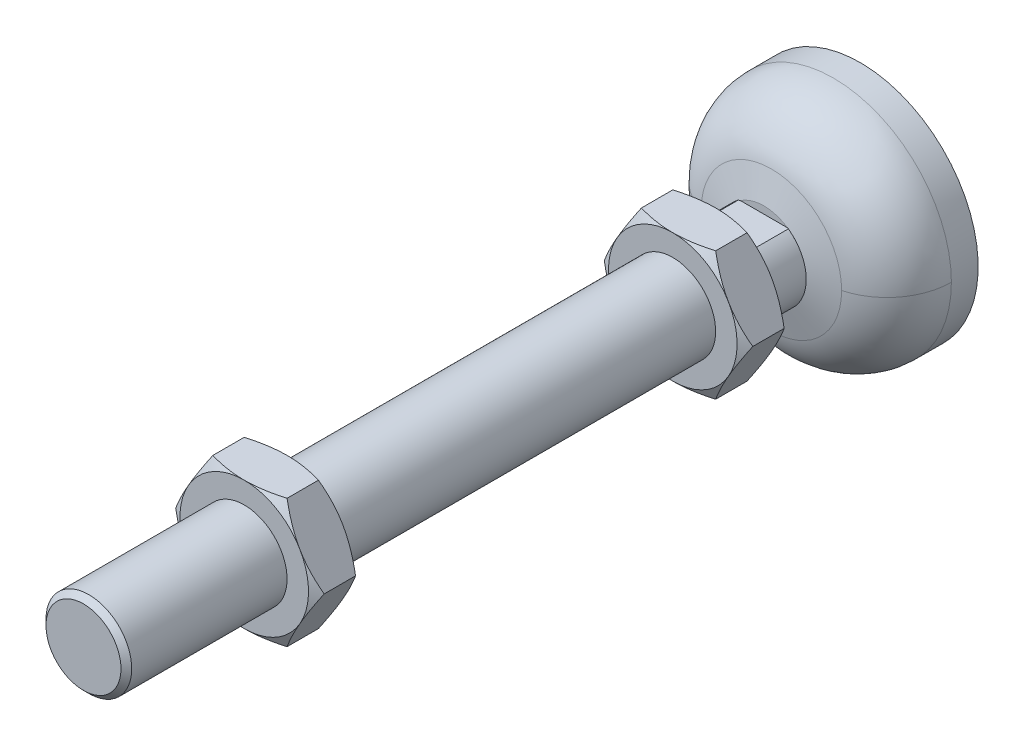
ISO-10303-21;
HEADER;
FILE_DESCRIPTION(('STEP AP214'),'2;1');
FILE_NAME('part.step','',(''),(''),'','','');
FILE_SCHEMA(('AUTOMOTIVE_DESIGN { 1 0 10303 214 1 1 1 1 }'));
ENDSEC;
DATA;
#1=APPLICATION_CONTEXT('core data for automotive mechanical design processes');
#2=APPLICATION_PROTOCOL_DEFINITION('international standard','automotive_design',2000,#1);
#3=PRODUCT_CONTEXT('',#1,'mechanical');
#4=PRODUCT('Part','Part','',(#3));
#5=PRODUCT_RELATED_PRODUCT_CATEGORY('part','',(#4));
#6=PRODUCT_DEFINITION_FORMATION('','',#4);
#7=PRODUCT_DEFINITION_CONTEXT('part definition',#1,'design');
#8=PRODUCT_DEFINITION('design','',#6,#7);
#9=PRODUCT_DEFINITION_SHAPE('','',#8);
#10=(LENGTH_UNIT() NAMED_UNIT(*) SI_UNIT(.MILLI.,.METRE.));
#11=(NAMED_UNIT(*) PLANE_ANGLE_UNIT() SI_UNIT($,.RADIAN.));
#12=(NAMED_UNIT(*) SI_UNIT($,.STERADIAN.) SOLID_ANGLE_UNIT());
#13=UNCERTAINTY_MEASURE_WITH_UNIT(LENGTH_MEASURE(1.E-05),#10,'distance_accuracy_value','');
#14=(GEOMETRIC_REPRESENTATION_CONTEXT(3) GLOBAL_UNCERTAINTY_ASSIGNED_CONTEXT((#13)) GLOBAL_UNIT_ASSIGNED_CONTEXT((#10,
#11,#12)) REPRESENTATION_CONTEXT('',''));
#15=CARTESIAN_POINT('',(0.,0.,0.));
#16=DIRECTION('',(0.,0.,1.));
#17=DIRECTION('',(1.,0.,0.));
#18=AXIS2_PLACEMENT_3D('',#15,#16,#17);
#19=CARTESIAN_POINT('',(0.,0.,10.9392452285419));
#20=DIRECTION('',(0.,0.,-1.));
#21=DIRECTION('',(-1.,0.,0.));
#22=AXIS2_PLACEMENT_3D('',#19,#20,#21);
#23=CONICAL_SURFACE('',#22,1.89056035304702,0.610865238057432);
#24=CARTESIAN_POINT('',(-2.8421709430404E-11,0.,13.63924522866));
#25=VERTEX_POINT('',#24);
#26=VERTEX_LOOP('',#25);
#27=FACE_BOUND('',#26,.T.);
#28=CARTESIAN_POINT('',(0.,0.,10.9392452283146));
#29=DIRECTION('',(0.,0.,-1.));
#30=DIRECTION('',(-1.,0.,0.));
#31=AXIS2_PLACEMENT_3D('',#28,#29,#30);
#32=CIRCLE('',#31,1.89056035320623);
#33=CARTESIAN_POINT('',(-1.89056035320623,0.,10.9392452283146));
#34=VERTEX_POINT('',#33);
#35=EDGE_CURVE('E622',#34,#34,#32,.T.);
#36=ORIENTED_EDGE('',*,*,#35,.T.);
#37=EDGE_LOOP('',(#36));
#38=FACE_BOUND('',#37,.T.);
#39=ADVANCED_FACE('F17',(#27,#38),#23,.F.);
#40=CARTESIAN_POINT('',(0.,0.,10.93924522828));
#41=DIRECTION('',(0.,0.,1.));
#42=DIRECTION('',(1.,0.,0.));
#43=AXIS2_PLACEMENT_3D('',#40,#41,#42);
#44=PLANE('',#43);
#45=ORIENTED_EDGE('',*,*,#35,.F.);
#46=EDGE_LOOP('',(#45));
#47=FACE_BOUND('',#46,.T.);
#48=CARTESIAN_POINT('',(0.,0.,10.93924522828));
#49=DIRECTION('',(0.,0.,-1.));
#50=DIRECTION('',(-1.,0.,0.));
#51=AXIS2_PLACEMENT_3D('',#48,#49,#50);
#52=CIRCLE('',#51,5.);
#53=CARTESIAN_POINT('',(-5.,0.,10.93924522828));
#54=VERTEX_POINT('',#53);
#55=EDGE_CURVE('E619',#54,#54,#52,.F.);
#56=ORIENTED_EDGE('',*,*,#55,.F.);
#57=EDGE_LOOP('',(#56));
#58=FACE_BOUND('',#57,.T.);
#59=ADVANCED_FACE('F1629',(#47,#58),#44,.F.);
#60=CARTESIAN_POINT('',(0.,0.,4.236207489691));
#61=DIRECTION('',(0.,0.,-1.));
#62=DIRECTION('',(-1.,0.,0.));
#63=AXIS2_PLACEMENT_3D('',#60,#61,#62);
#64=CYLINDRICAL_SURFACE('',#63,5.);
#65=ORIENTED_EDGE('',*,*,#55,.T.);
#66=EDGE_LOOP('',(#65));
#67=FACE_BOUND('',#66,.T.);
#68=CARTESIAN_POINT('',(0.,0.,12.52079715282));
#69=DIRECTION('',(0.,0.,-1.));
#70=DIRECTION('',(-1.,0.,0.));
#71=AXIS2_PLACEMENT_3D('',#68,#69,#70);
#72=CIRCLE('',#71,5.);
#73=CARTESIAN_POINT('',(-5.,0.,12.52079715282));
#74=VERTEX_POINT('',#73);
#75=EDGE_CURVE('E616',#74,#74,#72,.F.);
#76=ORIENTED_EDGE('',*,*,#75,.F.);
#77=EDGE_LOOP('',(#76));
#78=FACE_BOUND('',#77,.T.);
#79=ADVANCED_FACE('F300',(#67,#78),#64,.T.);
#80=CARTESIAN_POINT('',(0.,0.,26.66293277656));
#81=DIRECTION('',(1.,0.,0.));
#82=DIRECTION('',(0.,1.,0.));
#83=AXIS2_PLACEMENT_3D('',#80,#81,#82);
#84=SPHERICAL_SURFACE('',#83,15.);
#85=CARTESIAN_POINT('',(0.,0.,13.1703708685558));
#86=DIRECTION('',(0.,0.,-1.));
#87=DIRECTION('',(0.,1.,0.));
#88=AXIS2_PLACEMENT_3D('',#85,#86,#87);
#89=CIRCLE('',#88,6.55368393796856);
#90=CARTESIAN_POINT('',(0.,6.55368393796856,13.1703708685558));
#91=VERTEX_POINT('',#90);
#92=EDGE_CURVE('E613',#91,#91,#89,.T.);
#93=ORIENTED_EDGE('',*,*,#92,.T.);
#94=EDGE_LOOP('',(#93));
#95=FACE_BOUND('',#94,.T.);
#96=ORIENTED_EDGE('',*,*,#75,.T.);
#97=EDGE_LOOP('',(#96));
#98=FACE_BOUND('',#97,.T.);
#99=ADVANCED_FACE('F296',(#95,#98),#84,.T.);
#100=CARTESIAN_POINT('',(0.,0.,11.7614807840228));
#101=DIRECTION('',(0.,0.,-1.));
#102=DIRECTION('',(0.,1.,0.));
#103=AXIS2_PLACEMENT_3D('',#100,#101,#102);
#104=CONICAL_SURFACE('',#103,11.8117333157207,1.3089969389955);
#105=ORIENTED_EDGE('',*,*,#92,.F.);
#106=EDGE_LOOP('',(#105));
#107=FACE_BOUND('',#106,.T.);
#108=CARTESIAN_POINT('',(0.,0.,11.7614807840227));
#109=DIRECTION('',(0.,0.,1.));
#110=DIRECTION('',(1.,0.,0.));
#111=AXIS2_PLACEMENT_3D('',#108,#109,#110);
#112=CIRCLE('',#111,11.8117333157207);
#113=CARTESIAN_POINT('',(11.8117333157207,0.,11.7614807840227));
#114=VERTEX_POINT('',#113);
#115=EDGE_CURVE('E281',#114,#114,#112,.F.);
#116=ORIENTED_EDGE('',*,*,#115,.T.);
#117=EDGE_LOOP('',(#116));
#118=FACE_BOUND('',#117,.T.);
#119=ADVANCED_FACE('F291',(#107,#118),#104,.F.);
#120=CARTESIAN_POINT('',(0.,0.,5.));
#121=DIRECTION('',(0.,0.,1.));
#122=DIRECTION('',(1.,0.,0.));
#123=AXIS2_PLACEMENT_3D('',#120,#121,#122);
#124=TOROIDAL_SURFACE('',#123,10.,7.);
#125=ORIENTED_EDGE('',*,*,#115,.F.);
#126=EDGE_LOOP('',(#125));
#127=FACE_BOUND('',#126,.T.);
#128=CARTESIAN_POINT('',(0.,0.,5.));
#129=DIRECTION('',(0.,0.,-1.));
#130=DIRECTION('',(-1.,0.,0.));
#131=AXIS2_PLACEMENT_3D('',#128,#129,#130);
#132=CIRCLE('',#131,17.);
#133=CARTESIAN_POINT('',(-17.,0.,5.));
#134=VERTEX_POINT('',#133);
#135=EDGE_CURVE('E277',#134,#134,#132,.T.);
#136=ORIENTED_EDGE('',*,*,#135,.T.);
#137=EDGE_LOOP('',(#136));
#138=FACE_BOUND('',#137,.T.);
#139=ADVANCED_FACE('F286',(#127,#138),#124,.F.);
#140=CARTESIAN_POINT('',(0.,0.,-0.9));
#141=DIRECTION('',(0.,0.,-1.));
#142=DIRECTION('',(-1.,0.,0.));
#143=AXIS2_PLACEMENT_3D('',#140,#141,#142);
#144=CYLINDRICAL_SURFACE('',#143,17.);
#145=ORIENTED_EDGE('',*,*,#135,.F.);
#146=EDGE_LOOP('',(#145));
#147=FACE_BOUND('',#146,.T.);
#148=CARTESIAN_POINT('',(0.,0.,0.));
#149=DIRECTION('',(0.,0.,-1.));
#150=DIRECTION('',(-1.,0.,0.));
#151=AXIS2_PLACEMENT_3D('',#148,#149,#150);
#152=CIRCLE('',#151,17.);
#153=CARTESIAN_POINT('',(-17.,0.,0.));
#154=VERTEX_POINT('',#153);
#155=EDGE_CURVE('E280',#154,#154,#152,.T.);
#156=ORIENTED_EDGE('',*,*,#155,.T.);
#157=EDGE_LOOP('',(#156));
#158=FACE_BOUND('',#157,.T.);
#159=ADVANCED_FACE('F290',(#147,#158),#144,.F.);
#160=CARTESIAN_POINT('',(0.,0.,0.));
#161=DIRECTION('',(0.,0.,1.));
#162=DIRECTION('',(1.,0.,0.));
#163=AXIS2_PLACEMENT_3D('',#160,#161,#162);
#164=PLANE('',#163);
#165=ORIENTED_EDGE('',*,*,#155,.F.);
#166=EDGE_LOOP('',(#165));
#167=FACE_BOUND('',#166,.T.);
#168=CARTESIAN_POINT('',(0.,0.,0.));
#169=DIRECTION('',(0.,0.,-1.));
#170=DIRECTION('',(-1.,0.,0.));
#171=AXIS2_PLACEMENT_3D('',#168,#169,#170);
#172=CIRCLE('',#171,22.);
#173=CARTESIAN_POINT('',(-22.,0.,0.));
#174=VERTEX_POINT('',#173);
#175=EDGE_CURVE('E608',#174,#174,#172,.F.);
#176=ORIENTED_EDGE('',*,*,#175,.F.);
#177=EDGE_LOOP('',(#176));
#178=FACE_BOUND('',#177,.T.);
#179=ADVANCED_FACE('F1591',(#167,#178),#164,.F.);
#180=CARTESIAN_POINT('',(0.,0.,-0.9));
#181=DIRECTION('',(0.,0.,-1.));
#182=DIRECTION('',(-1.,0.,0.));
#183=AXIS2_PLACEMENT_3D('',#180,#181,#182);
#184=CYLINDRICAL_SURFACE('',#183,22.);
#185=ORIENTED_EDGE('',*,*,#175,.T.);
#186=EDGE_LOOP('',(#185));
#187=FACE_BOUND('',#186,.T.);
#188=CARTESIAN_POINT('',(0.,0.,5.));
#189=DIRECTION('',(0.,0.,-1.));
#190=DIRECTION('',(-1.,0.,0.));
#191=AXIS2_PLACEMENT_3D('',#188,#189,#190);
#192=CIRCLE('',#191,22.);
#193=CARTESIAN_POINT('',(22.0000000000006,-3.98493514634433E-13,5.00000000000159));
#194=VERTEX_POINT('',#193);
#195=CARTESIAN_POINT('',(-22.0000000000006,4.3056804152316E-13,5.00000000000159));
#196=VERTEX_POINT('',#195);
#197=EDGE_CURVE('E258',#194,#196,#192,.F.);
#198=ORIENTED_EDGE('',*,*,#197,.F.);
#199=CARTESIAN_POINT('',(0.,0.,5.));
#200=DIRECTION('',(0.,0.,-1.));
#201=DIRECTION('',(-1.,0.,0.));
#202=AXIS2_PLACEMENT_3D('',#199,#200,#201);
#203=CIRCLE('',#202,22.);
#204=EDGE_CURVE('E232',#196,#194,#203,.F.);
#205=ORIENTED_EDGE('',*,*,#204,.F.);
#206=EDGE_LOOP('',(#198,#205));
#207=FACE_BOUND('',#206,.T.);
#208=ADVANCED_FACE('F1583',(#187,#207),#184,.T.);
#209=CARTESIAN_POINT('',(-21.9623578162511,1.21405257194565,4.685876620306));
#210=CARTESIAN_POINT('',(-22.1169078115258,1.22259590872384,10.59691348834));
#211=CARTESIAN_POINT('',(-18.52275027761,1.02391522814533,15.28806187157));
#212=CARTESIAN_POINT('',(-12.7818302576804,0.70656411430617,16.66843904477));
#213=CARTESIAN_POINT('',(-22.7055856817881,-12.2310293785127,4.685876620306));
#214=CARTESIAN_POINT('',(-22.8653658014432,-12.3170996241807,10.59691348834));
#215=CARTESIAN_POINT('',(-19.1495784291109,-10.3154818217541,15.28806187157));
#216=CARTESIAN_POINT('',(-13.2143800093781,-7.11831319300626,16.66843904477));
#217=CARTESIAN_POINT('',(-13.4470464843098,-21.99588789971,4.685876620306));
#218=CARTESIAN_POINT('',(-13.5416738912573,-22.15067384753,10.59691348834));
#219=CARTESIAN_POINT('',(-11.3410539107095,-18.55102908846,15.28806187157));
#220=CARTESIAN_POINT('',(-7.82602064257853,-12.80134436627,16.66843904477));
#221=CARTESIAN_POINT('',(0.,-21.99588789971,4.685876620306));
#222=CARTESIAN_POINT('',(0.,-22.15067384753,10.59691348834));
#223=CARTESIAN_POINT('',(0.,-18.55102908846,15.28806187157));
#224=CARTESIAN_POINT('',(0.,-12.80134436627,16.66843904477));
#225=CARTESIAN_POINT('',(13.4470464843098,-21.99588789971,4.685876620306));
#226=CARTESIAN_POINT('',(13.5416738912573,-22.15067384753,10.59691348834));
#227=CARTESIAN_POINT('',(11.3410539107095,-18.55102908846,15.28806187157));
#228=CARTESIAN_POINT('',(7.82602064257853,-12.80134436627,16.66843904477));
#229=CARTESIAN_POINT('',(22.7055856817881,-12.2310293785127,4.685876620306));
#230=CARTESIAN_POINT('',(22.8653658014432,-12.3170996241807,10.59691348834));
#231=CARTESIAN_POINT('',(19.1495784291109,-10.3154818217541,15.28806187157));
#232=CARTESIAN_POINT('',(13.2143800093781,-7.11831319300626,16.66843904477));
#233=CARTESIAN_POINT('',(21.9623578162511,1.21405257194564,4.685876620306));
#234=CARTESIAN_POINT('',(22.1169078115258,1.22259590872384,10.59691348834));
#235=CARTESIAN_POINT('',(18.52275027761,1.02391522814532,15.28806187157));
#236=CARTESIAN_POINT('',(12.7818302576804,0.706564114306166,16.66843904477));
#237=(BOUNDED_SURFACE() B_SPLINE_SURFACE(3,3,((#209,#210,#211,#212),(#213,#214,#215,#216),(#217,
#218,#219,#220),(#221,#222,#223,#224),(#225,#226,#227,#228),(#229,#230,#231,#232),(#233,#234,
#235,#236)),.UNSPECIFIED.,.F.,.F.,.F.) B_SPLINE_SURFACE_WITH_KNOTS((4,3,4),(4,4),
(0.00521064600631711,1.,1.99478935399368),(0.,1.),
.UNSPECIFIED.) GEOMETRIC_REPRESENTATION_ITEM() RATIONAL_B_SPLINE_SURFACE(((1.33177584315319,
1.13391475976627,1.13391475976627,1.33177584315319),(1.05515910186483,0.898394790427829,
0.898394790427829,1.05515910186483),(1.05661563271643,0.899634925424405,0.899634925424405,
1.05661563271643),(1.336145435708,1.137635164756,1.137635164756,1.336145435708),
(1.05661563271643,0.899634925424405,0.899634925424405,1.05661563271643),(1.05515910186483,
0.898394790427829,0.898394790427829,1.05515910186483),(1.33177584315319,1.13391475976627,
1.13391475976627,1.33177584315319))) REPRESENTATION_ITEM('') SURFACE());
#238=CARTESIAN_POINT('',(0.,0.,16.5911099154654));
#239=DIRECTION('',(0.,0.,-1.));
#240=DIRECTION('',(-1.,0.,0.));
#241=AXIS2_PLACEMENT_3D('',#238,#239,#240);
#242=CIRCLE('',#241,13.1058285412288);
#243=CARTESIAN_POINT('',(-13.1058285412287,0.,16.5911099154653));
#244=VERTEX_POINT('',#243);
#245=CARTESIAN_POINT('',(13.1058285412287,0.,16.5911099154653));
#246=VERTEX_POINT('',#245);
#247=EDGE_CURVE('E243',#244,#246,#242,.F.);
#248=CARTESIAN_POINT('',(-10.0000000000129,-4.18990596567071E-13,5.00000000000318));
#249=DIRECTION('',(0.,1.,0.));
#250=DIRECTION('',(-0.999657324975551,0.,-0.0261769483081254));
#251=AXIS2_PLACEMENT_3D('',#248,#249,#250);
#252=CIRCLE('',#251,11.9999999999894);
#253=EDGE_CURVE('E246',#196,#244,#252,.T.);
#254=CARTESIAN_POINT('',(10.0000000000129,-1.70087621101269E-12,5.00000000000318));
#255=DIRECTION('',(-1.0436304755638E-13,1.,-1.35989812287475E-13));
#256=DIRECTION('',(0.999657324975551,1.17448578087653E-13,-0.0261769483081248));
#257=AXIS2_PLACEMENT_3D('',#254,#255,#256);
#258=CIRCLE('',#257,11.9999999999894);
#259=EDGE_CURVE('E249',#246,#194,#258,.T.);
#260=ORIENTED_EDGE('',*,*,#247,.F.);
#261=ORIENTED_EDGE('',*,*,#253,.F.);
#262=ORIENTED_EDGE('',*,*,#204,.T.);
#263=ORIENTED_EDGE('',*,*,#259,.F.);
#264=EDGE_LOOP('',(#260,#261,#262,#263));
#265=FACE_BOUND('',#264,.T.);
#266=ADVANCED_FACE('F245',(#265),#237,.T.);
#267=CARTESIAN_POINT('',(21.9623578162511,-1.21405257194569,4.685876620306));
#268=CARTESIAN_POINT('',(22.1169078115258,-1.2225959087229,10.59691348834));
#269=CARTESIAN_POINT('',(18.52275027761,-1.02391522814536,15.28806187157));
#270=CARTESIAN_POINT('',(12.7818302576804,-0.706564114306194,16.66843904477));
#271=CARTESIAN_POINT('',(22.7055856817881,12.2310293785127,4.685876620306));
#272=CARTESIAN_POINT('',(22.8653658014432,12.3170996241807,10.59691348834));
#273=CARTESIAN_POINT('',(19.1495784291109,10.3154818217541,15.28806187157));
#274=CARTESIAN_POINT('',(13.2143800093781,7.11831319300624,16.66843904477));
#275=CARTESIAN_POINT('',(13.4470464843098,21.99588789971,4.685876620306));
#276=CARTESIAN_POINT('',(13.5416738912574,22.15067384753,10.59691348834));
#277=CARTESIAN_POINT('',(11.3410539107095,18.55102908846,15.28806187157));
#278=CARTESIAN_POINT('',(7.82602064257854,12.80134436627,16.66843904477));
#279=CARTESIAN_POINT('',(0.,21.99588789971,4.685876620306));
#280=CARTESIAN_POINT('',(0.,22.15067384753,10.59691348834));
#281=CARTESIAN_POINT('',(0.,18.55102908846,15.28806187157));
#282=CARTESIAN_POINT('',(0.,12.80134436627,16.66843904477));
#283=CARTESIAN_POINT('',(-13.4470464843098,21.99588789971,4.685876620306));
#284=CARTESIAN_POINT('',(-13.5416738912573,22.15067384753,10.59691348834));
#285=CARTESIAN_POINT('',(-11.3410539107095,18.55102908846,15.28806187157));
#286=CARTESIAN_POINT('',(-7.82602064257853,12.80134436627,16.66843904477));
#287=CARTESIAN_POINT('',(-22.7055856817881,12.2310293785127,4.685876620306));
#288=CARTESIAN_POINT('',(-22.8653658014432,12.3170996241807,10.59691348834));
#289=CARTESIAN_POINT('',(-19.1495784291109,10.3154818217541,15.28806187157));
#290=CARTESIAN_POINT('',(-13.2143800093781,7.11831319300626,16.66843904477));
#291=CARTESIAN_POINT('',(-21.9623578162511,-1.21405257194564,4.685876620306));
#292=CARTESIAN_POINT('',(-22.1169078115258,-1.22259590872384,10.59691348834));
#293=CARTESIAN_POINT('',(-18.52275027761,-1.02391522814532,15.28806187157));
#294=CARTESIAN_POINT('',(-12.7818302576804,-0.706564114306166,16.66843904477));
#295=(BOUNDED_SURFACE() B_SPLINE_SURFACE(3,3,((#267,#268,#269,#270),(#271,#272,#273,#274),(#275,
#276,#277,#278),(#279,#280,#281,#282),(#283,#284,#285,#286),(#287,#288,#289,#290),(#291,#292,
#293,#294)),.UNSPECIFIED.,.F.,.F.,.F.) B_SPLINE_SURFACE_WITH_KNOTS((4,3,4),(4,4),
(0.0052106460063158,1.,1.99478935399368),(0.,1.),
.UNSPECIFIED.) GEOMETRIC_REPRESENTATION_ITEM() RATIONAL_B_SPLINE_SURFACE(((1.33177584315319,
1.13391475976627,1.13391475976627,1.33177584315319),(1.05515910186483,0.898394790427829,
0.898394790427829,1.05515910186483),(1.05661563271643,0.899634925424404,0.899634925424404,
1.05661563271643),(1.336145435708,1.137635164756,1.137635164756,1.336145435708),
(1.05661563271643,0.899634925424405,0.899634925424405,1.05661563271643),(1.05515910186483,
0.898394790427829,0.898394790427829,1.05515910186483),(1.33177584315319,1.13391475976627,
1.13391475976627,1.33177584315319))) REPRESENTATION_ITEM('') SURFACE());
#296=CARTESIAN_POINT('',(0.,0.,16.5911099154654));
#297=DIRECTION('',(0.,0.,-1.));
#298=DIRECTION('',(-1.,0.,0.));
#299=AXIS2_PLACEMENT_3D('',#296,#297,#298);
#300=CIRCLE('',#299,13.1058285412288);
#301=EDGE_CURVE('E257',#246,#244,#300,.F.);
#302=ORIENTED_EDGE('',*,*,#197,.T.);
#303=ORIENTED_EDGE('',*,*,#253,.T.);
#304=ORIENTED_EDGE('',*,*,#301,.F.);
#305=ORIENTED_EDGE('',*,*,#259,.T.);
#306=EDGE_LOOP('',(#302,#303,#304,#305));
#307=FACE_BOUND('',#306,.T.);
#308=ADVANCED_FACE('F256',(#307),#295,.T.);
#309=CARTESIAN_POINT('',(0.,0.,145.));
#310=DIRECTION('',(0.,0.,1.));
#311=DIRECTION('',(1.,0.,0.));
#312=AXIS2_PLACEMENT_3D('',#309,#310,#311);
#313=PLANE('',#312);
#314=CARTESIAN_POINT('',(0.,0.,145.));
#315=DIRECTION('',(0.,0.,-1.));
#316=DIRECTION('',(0.,1.,0.));
#317=AXIS2_PLACEMENT_3D('',#314,#315,#316);
#318=CIRCLE('',#317,7.00000000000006);
#319=CARTESIAN_POINT('',(0.,7.00000000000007,145.));
#320=VERTEX_POINT('',#319);
#321=EDGE_CURVE('E264',#320,#320,#318,.T.);
#322=ORIENTED_EDGE('',*,*,#321,.F.);
#323=EDGE_LOOP('',(#322));
#324=FACE_BOUND('',#323,.T.);
#325=ADVANCED_FACE('F1560',(#324),#313,.T.);
#326=CARTESIAN_POINT('',(26.4,-8.,18.));
#327=DIRECTION('',(0.,0.,-1.));
#328=DIRECTION('',(-1.,0.,0.));
#329=AXIS2_PLACEMENT_3D('',#326,#327,#328);
#330=PLANE('',#329);
#331=CARTESIAN_POINT('',(0.,0.,17.9999999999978));
#332=DIRECTION('',(0.,0.,-1.));
#333=DIRECTION('',(-1.,0.,0.));
#334=AXIS2_PLACEMENT_3D('',#331,#332,#333);
#335=CIRCLE('',#334,7.84777916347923);
#336=CARTESIAN_POINT('',(4.39745810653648,-6.5,17.9999999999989));
#337=VERTEX_POINT('',#336);
#338=CARTESIAN_POINT('',(-4.39745810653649,-6.5,17.9999999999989));
#339=VERTEX_POINT('',#338);
#340=EDGE_CURVE('E253',#337,#339,#335,.T.);
#341=ORIENTED_EDGE('',*,*,#340,.F.);
#342=DIRECTION('',(1.,0.,0.));
#343=VECTOR('',#342,1.);
#344=CARTESIAN_POINT('',(26.4,-6.5,18.));
#345=LINE('',#344,#343);
#346=EDGE_CURVE('E572',#337,#339,#345,.F.);
#347=ORIENTED_EDGE('',*,*,#346,.T.);
#348=EDGE_LOOP('',(#341,#347));
#349=FACE_BOUND('',#348,.T.);
#350=ADVANCED_FACE('F1149',(#349),#330,.F.);
#351=CARTESIAN_POINT('',(0.,0.,16.5911099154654));
#352=DIRECTION('',(0.,0.,-1.));
#353=DIRECTION('',(-1.,0.,0.));
#354=AXIS2_PLACEMENT_3D('',#351,#352,#353);
#355=CONICAL_SURFACE('',#354,13.1058285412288,1.3089969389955);
#356=ORIENTED_EDGE('',*,*,#247,.T.);
#357=ORIENTED_EDGE('',*,*,#301,.T.);
#358=EDGE_LOOP('',(#356,#357));
#359=FACE_BOUND('',#358,.T.);
#360=CARTESIAN_POINT('',(0.,0.,17.9999999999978));
#361=DIRECTION('',(0.,0.,-1.));
#362=DIRECTION('',(-1.,0.,0.));
#363=AXIS2_PLACEMENT_3D('',#360,#361,#362);
#364=CIRCLE('',#363,7.84777916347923);
#365=CARTESIAN_POINT('',(-4.3974581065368,6.5,17.9999999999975));
#366=VERTEX_POINT('',#365);
#367=EDGE_CURVE('E573',#366,#339,#364,.F.);
#368=ORIENTED_EDGE('',*,*,#367,.F.);
#369=CARTESIAN_POINT('',(0.,0.,17.9999999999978));
#370=DIRECTION('',(0.,0.,-1.));
#371=DIRECTION('',(-1.,0.,0.));
#372=AXIS2_PLACEMENT_3D('',#369,#370,#371);
#373=CIRCLE('',#372,7.84777916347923);
#374=CARTESIAN_POINT('',(4.39745810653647,6.5,17.9999999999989));
#375=VERTEX_POINT('',#374);
#376=EDGE_CURVE('E262',#366,#375,#373,.T.);
#377=ORIENTED_EDGE('',*,*,#376,.T.);
#378=CARTESIAN_POINT('',(0.,0.,17.9999999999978));
#379=DIRECTION('',(0.,0.,-1.));
#380=DIRECTION('',(-1.,0.,0.));
#381=AXIS2_PLACEMENT_3D('',#378,#379,#380);
#382=CIRCLE('',#381,7.84777916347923);
#383=EDGE_CURVE('E564',#337,#375,#382,.F.);
#384=ORIENTED_EDGE('',*,*,#383,.F.);
#385=ORIENTED_EDGE('',*,*,#340,.T.);
#386=EDGE_LOOP('',(#368,#377,#384,#385));
#387=FACE_BOUND('',#386,.T.);
#388=ADVANCED_FACE('F260',(#359,#387),#355,.T.);
#389=CARTESIAN_POINT('',(26.4,6.5,18.));
#390=DIRECTION('',(0.,0.,-1.));
#391=DIRECTION('',(-1.,0.,0.));
#392=AXIS2_PLACEMENT_3D('',#389,#390,#391);
#393=PLANE('',#392);
#394=ORIENTED_EDGE('',*,*,#376,.F.);
#395=DIRECTION('',(1.,0.,0.));
#396=VECTOR('',#395,1.);
#397=CARTESIAN_POINT('',(26.4,6.5,18.));
#398=LINE('',#397,#396);
#399=EDGE_CURVE('E592',#366,#375,#398,.T.);
#400=ORIENTED_EDGE('',*,*,#399,.T.);
#401=EDGE_LOOP('',(#394,#400));
#402=FACE_BOUND('',#401,.T.);
#403=ADVANCED_FACE('F1147',(#402),#393,.F.);
#404=CARTESIAN_POINT('',(0.,0.,144.));
#405=DIRECTION('',(0.,0.,-1.));
#406=DIRECTION('',(0.,1.,0.));
#407=AXIS2_PLACEMENT_3D('',#404,#405,#406);
#408=CONICAL_SURFACE('',#407,7.99999999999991,0.7853981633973);
#409=CARTESIAN_POINT('',(0.,0.,144.));
#410=DIRECTION('',(0.,0.,-1.));
#411=DIRECTION('',(-1.,0.,0.));
#412=AXIS2_PLACEMENT_3D('',#409,#410,#411);
#413=CIRCLE('',#412,8.);
#414=CARTESIAN_POINT('',(-8.,0.,144.));
#415=VERTEX_POINT('',#414);
#416=EDGE_CURVE('E523',#415,#415,#413,.T.);
#417=ORIENTED_EDGE('',*,*,#416,.F.);
#418=EDGE_LOOP('',(#417));
#419=FACE_BOUND('',#418,.T.);
#420=ORIENTED_EDGE('',*,*,#321,.T.);
#421=EDGE_LOOP('',(#420));
#422=FACE_BOUND('',#421,.T.);
#423=ADVANCED_FACE('F580',(#419,#422),#408,.T.);
#424=CARTESIAN_POINT('',(0.,0.,30.78328448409));
#425=DIRECTION('',(1.,0.,0.));
#426=DIRECTION('',(0.,1.,0.));
#427=AXIS2_PLACEMENT_3D('',#424,#425,#426);
#428=SPHERICAL_SURFACE('',#427,15.);
#429=CARTESIAN_POINT('',(-4.39745810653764,-6.50000000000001,17.9999999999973));
#430=CARTESIAN_POINT('',(-4.44199498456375,-6.50000000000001,18.0153207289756));
#431=CARTESIAN_POINT('',(-4.486449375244,-6.5,18.0308733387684));
#432=CARTESIAN_POINT('',(-4.57519318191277,-6.5,18.0624423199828));
#433=CARTESIAN_POINT('',(-4.6194825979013,-6.5,18.0784586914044));
#434=CARTESIAN_POINT('',(-4.66368952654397,-6.5,18.0947069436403));
#435=B_SPLINE_CURVE_WITH_KNOTS('',3,(#429,#430,#431,#432,#433,#434),.UNSPECIFIED.,.F.,.F.,(4,2,
4),(0.,0.141289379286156,0.282578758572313),.UNSPECIFIED.);
#436=CARTESIAN_POINT('',(-4.66368952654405,-6.5000000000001,18.0947069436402));
#437=VERTEX_POINT('',#436);
#438=EDGE_CURVE('E565',#339,#437,#435,.T.);
#439=ORIENTED_EDGE('',*,*,#438,.T.);
#440=CARTESIAN_POINT('',(0.,0.,18.09470694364));
#441=DIRECTION('',(0.,0.,-1.));
#442=DIRECTION('',(-1.,0.,0.));
#443=AXIS2_PLACEMENT_3D('',#440,#441,#442);
#444=CIRCLE('',#443,8.);
#445=CARTESIAN_POINT('',(-4.66368952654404,6.50000000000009,18.0947069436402));
#446=VERTEX_POINT('',#445);
#447=EDGE_CURVE('E519',#446,#437,#444,.F.);
#448=ORIENTED_EDGE('',*,*,#447,.F.);
#449=CARTESIAN_POINT('',(-4.66368952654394,6.49999999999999,18.0947069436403));
#450=CARTESIAN_POINT('',(-4.61948259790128,6.5,18.0784586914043));
#451=CARTESIAN_POINT('',(-4.57519318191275,6.5,18.0624423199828));
#452=CARTESIAN_POINT('',(-4.48644937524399,6.5,18.0308733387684));
#453=CARTESIAN_POINT('',(-4.44199498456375,6.5,18.0153207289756));
#454=CARTESIAN_POINT('',(-4.39745810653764,6.5,17.9999999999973));
#455=B_SPLINE_CURVE_WITH_KNOTS('',3,(#449,#450,#451,#452,#453,#454),.UNSPECIFIED.,.F.,.F.,(4,2,
4),(0.,0.141289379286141,0.282578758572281),.UNSPECIFIED.);
#456=EDGE_CURVE('E589',#446,#366,#455,.T.);
#457=ORIENTED_EDGE('',*,*,#456,.T.);
#458=ORIENTED_EDGE('',*,*,#367,.T.);
#459=EDGE_LOOP('',(#439,#448,#457,#458));
#460=FACE_BOUND('',#459,.T.);
#461=ADVANCED_FACE('F575',(#460),#428,.T.);
#462=CARTESIAN_POINT('',(26.4,-6.5,27.25959693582));
#463=DIRECTION('',(0.,0.,1.));
#464=DIRECTION('',(1.,0.,0.));
#465=AXIS2_PLACEMENT_3D('',#462,#463,#464);
#466=PLANE('',#465);
#467=CARTESIAN_POINT('',(0.,0.,27.25959693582));
#468=DIRECTION('',(0.,0.,1.));
#469=DIRECTION('',(1.,0.,0.));
#470=AXIS2_PLACEMENT_3D('',#467,#468,#469);
#471=CIRCLE('',#470,8.);
#472=CARTESIAN_POINT('',(4.66368952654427,-6.5000000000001,27.25959693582));
#473=VERTEX_POINT('',#472);
#474=CARTESIAN_POINT('',(-4.66368952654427,-6.5000000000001,27.25959693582));
#475=VERTEX_POINT('',#474);
#476=EDGE_CURVE('E512',#473,#475,#471,.F.);
#477=ORIENTED_EDGE('',*,*,#476,.T.);
#478=DIRECTION('',(1.,0.,0.));
#479=VECTOR('',#478,1.);
#480=CARTESIAN_POINT('',(26.4,-6.5,27.25959693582));
#481=LINE('',#480,#479);
#482=EDGE_CURVE('E532',#475,#473,#481,.T.);
#483=ORIENTED_EDGE('',*,*,#482,.T.);
#484=EDGE_LOOP('',(#477,#483));
#485=FACE_BOUND('',#484,.T.);
#486=ADVANCED_FACE('F579',(#485),#466,.F.);
#487=CARTESIAN_POINT('',(26.4,-6.5,18.));
#488=DIRECTION('',(0.,1.,0.));
#489=DIRECTION('',(0.,0.,1.));
#490=AXIS2_PLACEMENT_3D('',#487,#488,#489);
#491=PLANE('',#490);
#492=DIRECTION('',(0.,0.,1.));
#493=VECTOR('',#492,1.);
#494=CARTESIAN_POINT('',(-4.66368952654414,-6.50000000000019,119.4));
#495=LINE('',#494,#493);
#496=CARTESIAN_POINT('',(-4.66368952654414,-6.50000000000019,27.));
#497=VERTEX_POINT('',#496);
#498=EDGE_CURVE('E510',#475,#497,#495,.F.);
#499=ORIENTED_EDGE('',*,*,#498,.T.);
#500=DIRECTION('',(0.,0.,-1.));
#501=VECTOR('',#500,1.);
#502=CARTESIAN_POINT('',(-4.66368952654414,-6.50000000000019,4.236207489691));
#503=LINE('',#502,#501);
#504=EDGE_CURVE('E516',#437,#497,#503,.F.);
#505=ORIENTED_EDGE('',*,*,#504,.F.);
#506=ORIENTED_EDGE('',*,*,#438,.F.);
#507=ORIENTED_EDGE('',*,*,#346,.F.);
#508=CARTESIAN_POINT('',(4.66368952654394,-6.50000000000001,18.0947069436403));
#509=CARTESIAN_POINT('',(4.61948259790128,-6.50000000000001,18.0784586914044));
#510=CARTESIAN_POINT('',(4.57519318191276,-6.5,18.0624423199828));
#511=CARTESIAN_POINT('',(4.48644937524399,-6.5,18.0308733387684));
#512=CARTESIAN_POINT('',(4.44199498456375,-6.49999999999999,18.0153207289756));
#513=CARTESIAN_POINT('',(4.39745810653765,-6.49999999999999,17.9999999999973));
#514=B_SPLINE_CURVE_WITH_KNOTS('',3,(#508,#509,#510,#511,#512,#513),.UNSPECIFIED.,.F.,.F.,(4,2,
4),(0.,0.141289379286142,0.282578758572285),.UNSPECIFIED.);
#515=CARTESIAN_POINT('',(4.66368952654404,-6.5000000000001,18.0947069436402));
#516=VERTEX_POINT('',#515);
#517=EDGE_CURVE('E556',#516,#337,#514,.T.);
#518=ORIENTED_EDGE('',*,*,#517,.F.);
#519=DIRECTION('',(0.,0.,-1.));
#520=VECTOR('',#519,1.);
#521=CARTESIAN_POINT('',(4.66368952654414,-6.50000000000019,4.236207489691));
#522=LINE('',#521,#520);
#523=CARTESIAN_POINT('',(4.66368952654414,-6.50000000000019,27.));
#524=VERTEX_POINT('',#523);
#525=EDGE_CURVE('E507',#524,#516,#522,.T.);
#526=ORIENTED_EDGE('',*,*,#525,.F.);
#527=DIRECTION('',(0.,0.,1.));
#528=VECTOR('',#527,1.);
#529=CARTESIAN_POINT('',(4.66368952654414,-6.50000000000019,119.4));
#530=LINE('',#529,#528);
#531=EDGE_CURVE('E513',#524,#473,#530,.T.);
#532=ORIENTED_EDGE('',*,*,#531,.T.);
#533=ORIENTED_EDGE('',*,*,#482,.F.);
#534=EDGE_LOOP('',(#499,#505,#506,#507,#518,#526,#532,#533));
#535=FACE_BOUND('',#534,.T.);
#536=ADVANCED_FACE('F541',(#535),#491,.F.);
#537=CARTESIAN_POINT('',(0.,0.,30.78328448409));
#538=DIRECTION('',(1.,0.,0.));
#539=DIRECTION('',(0.,1.,0.));
#540=AXIS2_PLACEMENT_3D('',#537,#538,#539);
#541=SPHERICAL_SURFACE('',#540,15.);
#542=CARTESIAN_POINT('',(4.39745810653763,6.5,17.9999999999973));
#543=CARTESIAN_POINT('',(4.44199498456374,6.5,18.0153207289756));
#544=CARTESIAN_POINT('',(4.48644937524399,6.5,18.0308733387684));
#545=CARTESIAN_POINT('',(4.57519318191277,6.5,18.0624423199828));
#546=CARTESIAN_POINT('',(4.61948259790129,6.5,18.0784586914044));
#547=CARTESIAN_POINT('',(4.66368952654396,6.50000000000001,18.0947069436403));
#548=B_SPLINE_CURVE_WITH_KNOTS('',3,(#542,#543,#544,#545,#546,#547),.UNSPECIFIED.,.F.,.F.,(4,2,
4),(0.,0.141289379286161,0.282578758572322),.UNSPECIFIED.);
#549=CARTESIAN_POINT('',(4.66368952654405,6.5000000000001,18.0947069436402));
#550=VERTEX_POINT('',#549);
#551=EDGE_CURVE('E529',#375,#550,#548,.T.);
#552=ORIENTED_EDGE('',*,*,#551,.T.);
#553=CARTESIAN_POINT('',(0.,0.,18.09470694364));
#554=DIRECTION('',(0.,0.,-1.));
#555=DIRECTION('',(-1.,0.,0.));
#556=AXIS2_PLACEMENT_3D('',#553,#554,#555);
#557=CIRCLE('',#556,8.);
#558=EDGE_CURVE('E506',#516,#550,#557,.F.);
#559=ORIENTED_EDGE('',*,*,#558,.F.);
#560=ORIENTED_EDGE('',*,*,#517,.T.);
#561=ORIENTED_EDGE('',*,*,#383,.T.);
#562=EDGE_LOOP('',(#552,#559,#560,#561));
#563=FACE_BOUND('',#562,.T.);
#564=ADVANCED_FACE('F535',(#563),#541,.T.);
#565=CARTESIAN_POINT('',(26.4,6.5,27.25959693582));
#566=DIRECTION('',(0.,-1.,0.));
#567=DIRECTION('',(0.,0.,-1.));
#568=AXIS2_PLACEMENT_3D('',#565,#566,#567);
#569=PLANE('',#568);
#570=DIRECTION('',(0.,0.,-1.));
#571=VECTOR('',#570,1.);
#572=CARTESIAN_POINT('',(4.663689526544,6.5,27.25959693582));
#573=LINE('',#572,#571);
#574=CARTESIAN_POINT('',(4.66368952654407,6.5000000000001,27.));
#575=VERTEX_POINT('',#574);
#576=CARTESIAN_POINT('',(4.6636895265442,6.5,27.25959693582));
#577=VERTEX_POINT('',#576);
#578=EDGE_CURVE('E527',#575,#577,#573,.F.);
#579=ORIENTED_EDGE('',*,*,#578,.F.);
#580=DIRECTION('',(0.,0.,-1.));
#581=VECTOR('',#580,1.);
#582=CARTESIAN_POINT('',(4.66368952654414,6.50000000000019,4.236207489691));
#583=LINE('',#582,#581);
#584=EDGE_CURVE('E502',#550,#575,#583,.F.);
#585=ORIENTED_EDGE('',*,*,#584,.F.);
#586=ORIENTED_EDGE('',*,*,#551,.F.);
#587=ORIENTED_EDGE('',*,*,#399,.F.);
#588=ORIENTED_EDGE('',*,*,#456,.F.);
#589=DIRECTION('',(0.,0.,-1.));
#590=VECTOR('',#589,1.);
#591=CARTESIAN_POINT('',(-4.66368952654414,6.50000000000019,4.236207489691));
#592=LINE('',#591,#590);
#593=CARTESIAN_POINT('',(-4.66368952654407,6.5000000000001,27.));
#594=VERTEX_POINT('',#593);
#595=EDGE_CURVE('E520',#594,#446,#592,.T.);
#596=ORIENTED_EDGE('',*,*,#595,.F.);
#597=DIRECTION('',(0.,0.,-1.));
#598=VECTOR('',#597,1.);
#599=CARTESIAN_POINT('',(-4.663689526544,6.5,27.25959693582));
#600=LINE('',#599,#598);
#601=CARTESIAN_POINT('',(-4.6636895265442,6.5,27.25959693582));
#602=VERTEX_POINT('',#601);
#603=EDGE_CURVE('E586',#602,#594,#600,.T.);
#604=ORIENTED_EDGE('',*,*,#603,.F.);
#605=DIRECTION('',(1.,0.,0.));
#606=VECTOR('',#605,1.);
#607=CARTESIAN_POINT('',(26.4,6.5,27.25959693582));
#608=LINE('',#607,#606);
#609=EDGE_CURVE('E524',#602,#577,#608,.T.);
#610=ORIENTED_EDGE('',*,*,#609,.T.);
#611=EDGE_LOOP('',(#579,#585,#586,#587,#588,#596,#604,#610));
#612=FACE_BOUND('',#611,.T.);
#613=ADVANCED_FACE('F540',(#612),#569,.F.);
#614=CARTESIAN_POINT('',(26.4,8.,27.25959693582));
#615=DIRECTION('',(0.,0.,1.));
#616=DIRECTION('',(1.,0.,0.));
#617=AXIS2_PLACEMENT_3D('',#614,#615,#616);
#618=PLANE('',#617);
#619=CARTESIAN_POINT('',(0.,0.,27.25959693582));
#620=DIRECTION('',(0.,0.,1.));
#621=DIRECTION('',(1.,0.,0.));
#622=AXIS2_PLACEMENT_3D('',#619,#620,#621);
#623=CIRCLE('',#622,8.);
#624=EDGE_CURVE('E505',#602,#577,#623,.F.);
#625=ORIENTED_EDGE('',*,*,#624,.T.);
#626=ORIENTED_EDGE('',*,*,#609,.F.);
#627=EDGE_LOOP('',(#625,#626));
#628=FACE_BOUND('',#627,.T.);
#629=ADVANCED_FACE('F1166',(#628),#618,.F.);
#630=CARTESIAN_POINT('',(0.,0.,4.236207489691));
#631=DIRECTION('',(0.,0.,-1.));
#632=DIRECTION('',(-1.,0.,0.));
#633=AXIS2_PLACEMENT_3D('',#630,#631,#632);
#634=CYLINDRICAL_SURFACE('',#633,8.);
#635=ORIENTED_EDGE('',*,*,#416,.T.);
#636=EDGE_LOOP('',(#635));
#637=FACE_BOUND('',#636,.T.);
#638=CARTESIAN_POINT('',(0.,0.,115.));
#639=DIRECTION('',(0.,0.,-1.));
#640=DIRECTION('',(-1.,0.,0.));
#641=AXIS2_PLACEMENT_3D('',#638,#639,#640);
#642=CIRCLE('',#641,8.);
#643=CARTESIAN_POINT('',(-8.,0.,115.));
#644=VERTEX_POINT('',#643);
#645=EDGE_CURVE('E1122',#644,#644,#642,.F.);
#646=ORIENTED_EDGE('',*,*,#645,.T.);
#647=EDGE_LOOP('',(#646));
#648=FACE_BOUND('',#647,.T.);
#649=ADVANCED_FACE('F1168',(#637,#648),#634,.T.);
#650=CARTESIAN_POINT('',(0.,0.,4.236207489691));
#651=DIRECTION('',(0.,0.,-1.));
#652=DIRECTION('',(-1.,0.,0.));
#653=AXIS2_PLACEMENT_3D('',#650,#651,#652);
#654=CYLINDRICAL_SURFACE('',#653,8.);
#655=ORIENTED_EDGE('',*,*,#504,.T.);
#656=CARTESIAN_POINT('',(0.,0.,27.));
#657=DIRECTION('',(0.,0.,-1.));
#658=DIRECTION('',(-1.,0.,0.));
#659=AXIS2_PLACEMENT_3D('',#656,#657,#658);
#660=CIRCLE('',#659,8.);
#661=EDGE_CURVE('E1119',#594,#497,#660,.F.);
#662=ORIENTED_EDGE('',*,*,#661,.F.);
#663=ORIENTED_EDGE('',*,*,#595,.T.);
#664=ORIENTED_EDGE('',*,*,#447,.T.);
#665=EDGE_LOOP('',(#655,#662,#663,#664));
#666=FACE_BOUND('',#665,.T.);
#667=ADVANCED_FACE('F1131',(#666),#654,.T.);
#668=CARTESIAN_POINT('',(0.,0.,119.4));
#669=DIRECTION('',(0.,0.,1.));
#670=DIRECTION('',(1.,0.,0.));
#671=AXIS2_PLACEMENT_3D('',#668,#669,#670);
#672=CYLINDRICAL_SURFACE('',#671,8.);
#673=ORIENTED_EDGE('',*,*,#498,.F.);
#674=ORIENTED_EDGE('',*,*,#476,.F.);
#675=ORIENTED_EDGE('',*,*,#531,.F.);
#676=CARTESIAN_POINT('',(0.,0.,27.));
#677=DIRECTION('',(0.,0.,1.));
#678=DIRECTION('',(1.,0.,0.));
#679=AXIS2_PLACEMENT_3D('',#676,#677,#678);
#680=CIRCLE('',#679,8.);
#681=EDGE_CURVE('E1116',#497,#524,#680,.T.);
#682=ORIENTED_EDGE('',*,*,#681,.F.);
#683=EDGE_LOOP('',(#673,#674,#675,#682));
#684=FACE_BOUND('',#683,.T.);
#685=ADVANCED_FACE('F1156',(#684),#672,.F.);
#686=CARTESIAN_POINT('',(0.,0.,4.236207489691));
#687=DIRECTION('',(0.,0.,-1.));
#688=DIRECTION('',(-1.,0.,0.));
#689=AXIS2_PLACEMENT_3D('',#686,#687,#688);
#690=CYLINDRICAL_SURFACE('',#689,8.);
#691=ORIENTED_EDGE('',*,*,#584,.T.);
#692=CARTESIAN_POINT('',(0.,0.,27.));
#693=DIRECTION('',(0.,0.,-1.));
#694=DIRECTION('',(-1.,0.,0.));
#695=AXIS2_PLACEMENT_3D('',#692,#693,#694);
#696=CIRCLE('',#695,8.);
#697=EDGE_CURVE('E1113',#524,#575,#696,.F.);
#698=ORIENTED_EDGE('',*,*,#697,.F.);
#699=ORIENTED_EDGE('',*,*,#525,.T.);
#700=ORIENTED_EDGE('',*,*,#558,.T.);
#701=EDGE_LOOP('',(#691,#698,#699,#700));
#702=FACE_BOUND('',#701,.T.);
#703=ADVANCED_FACE('F1180',(#702),#690,.T.);
#704=CARTESIAN_POINT('',(0.,0.,119.4));
#705=DIRECTION('',(0.,0.,1.));
#706=DIRECTION('',(1.,0.,0.));
#707=AXIS2_PLACEMENT_3D('',#704,#705,#706);
#708=CYLINDRICAL_SURFACE('',#707,8.);
#709=CARTESIAN_POINT('',(0.,0.,27.));
#710=DIRECTION('',(0.,0.,1.));
#711=DIRECTION('',(1.,0.,0.));
#712=AXIS2_PLACEMENT_3D('',#709,#710,#711);
#713=CIRCLE('',#712,8.);
#714=EDGE_CURVE('E1110',#575,#594,#713,.T.);
#715=ORIENTED_EDGE('',*,*,#714,.F.);
#716=ORIENTED_EDGE('',*,*,#578,.T.);
#717=ORIENTED_EDGE('',*,*,#624,.F.);
#718=ORIENTED_EDGE('',*,*,#603,.T.);
#719=EDGE_LOOP('',(#715,#716,#717,#718));
#720=FACE_BOUND('',#719,.T.);
#721=ADVANCED_FACE('F1163',(#720),#708,.F.);
#722=CARTESIAN_POINT('',(0.,0.,115.));
#723=DIRECTION('',(0.,0.,-1.));
#724=DIRECTION('',(-1.,0.,0.));
#725=AXIS2_PLACEMENT_3D('',#722,#723,#724);
#726=PLANE('',#725);
#727=ORIENTED_EDGE('',*,*,#645,.F.);
#728=EDGE_LOOP('',(#727));
#729=FACE_BOUND('',#728,.T.);
#730=CARTESIAN_POINT('',(0.,0.,114.999999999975));
#731=DIRECTION('',(0.,0.,-1.));
#732=DIRECTION('',(-1.,0.,0.));
#733=AXIS2_PLACEMENT_3D('',#730,#731,#732);
#734=CIRCLE('',#733,11.9999999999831);
#735=CARTESIAN_POINT('',(-10.3923048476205,5.99999999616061,114.999999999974));
#736=VERTEX_POINT('',#735);
#737=CARTESIAN_POINT('',(-4.429437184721E-09,11.9999999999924,114.999999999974));
#738=VERTEX_POINT('',#737);
#739=EDGE_CURVE('E1101',#736,#738,#734,.T.);
#740=ORIENTED_EDGE('',*,*,#739,.F.);
#741=CARTESIAN_POINT('',(0.,0.,114.999999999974));
#742=DIRECTION('',(0.,0.,-1.));
#743=DIRECTION('',(0.,1.,0.));
#744=AXIS2_PLACEMENT_3D('',#741,#742,#743);
#745=CIRCLE('',#744,11.9999999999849);
#746=CARTESIAN_POINT('',(-10.3923048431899,-6.00000000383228,114.999999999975));
#747=VERTEX_POINT('',#746);
#748=EDGE_CURVE('E1104',#747,#736,#745,.T.);
#749=ORIENTED_EDGE('',*,*,#748,.F.);
#750=CARTESIAN_POINT('',(0.,0.,114.999999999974));
#751=DIRECTION('',(0.,0.,-1.));
#752=DIRECTION('',(-1.,0.,0.));
#753=AXIS2_PLACEMENT_3D('',#750,#751,#752);
#754=CIRCLE('',#753,11.9999999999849);
#755=CARTESIAN_POINT('',(4.42943925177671E-09,-11.9999999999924,114.999999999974));
#756=VERTEX_POINT('',#755);
#757=EDGE_CURVE('E1107',#756,#747,#754,.T.);
#758=ORIENTED_EDGE('',*,*,#757,.F.);
#759=CARTESIAN_POINT('',(0.,0.,114.999999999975));
#760=DIRECTION('',(0.,0.,-1.));
#761=DIRECTION('',(-1.,0.,0.));
#762=AXIS2_PLACEMENT_3D('',#759,#760,#761);
#763=CIRCLE('',#762,11.9999999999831);
#764=CARTESIAN_POINT('',(10.3923048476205,-5.99999999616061,114.999999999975));
#765=VERTEX_POINT('',#764);
#766=EDGE_CURVE('E1095',#765,#756,#763,.T.);
#767=ORIENTED_EDGE('',*,*,#766,.F.);
#768=CARTESIAN_POINT('',(0.,0.,114.999999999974));
#769=DIRECTION('',(0.,0.,-1.));
#770=DIRECTION('',(0.,1.,0.));
#771=AXIS2_PLACEMENT_3D('',#768,#769,#770);
#772=CIRCLE('',#771,11.9999999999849);
#773=CARTESIAN_POINT('',(10.3923048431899,6.00000000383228,114.999999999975));
#774=VERTEX_POINT('',#773);
#775=EDGE_CURVE('E1089',#774,#765,#772,.T.);
#776=ORIENTED_EDGE('',*,*,#775,.F.);
#777=CARTESIAN_POINT('',(0.,0.,114.999999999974));
#778=DIRECTION('',(0.,0.,-1.));
#779=DIRECTION('',(-1.,0.,0.));
#780=AXIS2_PLACEMENT_3D('',#777,#778,#779);
#781=CIRCLE('',#780,11.9999999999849);
#782=EDGE_CURVE('E1098',#738,#774,#781,.T.);
#783=ORIENTED_EDGE('',*,*,#782,.F.);
#784=EDGE_LOOP('',(#740,#749,#758,#767,#776,#783));
#785=FACE_BOUND('',#784,.T.);
#786=ADVANCED_FACE('F1186',(#729,#785),#726,.F.);
#787=CARTESIAN_POINT('',(0.,0.,27.));
#788=DIRECTION('',(0.,0.,-1.));
#789=DIRECTION('',(-1.,0.,0.));
#790=AXIS2_PLACEMENT_3D('',#787,#788,#789);
#791=PLANE('',#790);
#792=ORIENTED_EDGE('',*,*,#697,.T.);
#793=ORIENTED_EDGE('',*,*,#714,.T.);
#794=ORIENTED_EDGE('',*,*,#661,.T.);
#795=ORIENTED_EDGE('',*,*,#681,.T.);
#796=EDGE_LOOP('',(#792,#793,#794,#795));
#797=FACE_BOUND('',#796,.T.);
#798=CARTESIAN_POINT('',(0.,0.,26.9999999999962));
#799=DIRECTION('',(0.,0.,1.));
#800=DIRECTION('',(0.,-1.,0.));
#801=AXIS2_PLACEMENT_3D('',#798,#799,#800);
#802=CIRCLE('',#801,12.0000000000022);
#803=CARTESIAN_POINT('',(10.392304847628,-5.99999999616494,26.9999999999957));
#804=VERTEX_POINT('',#803);
#805=CARTESIAN_POINT('',(10.3923048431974,6.00000000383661,26.9999999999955));
#806=VERTEX_POINT('',#805);
#807=EDGE_CURVE('E1039',#804,#806,#802,.T.);
#808=ORIENTED_EDGE('',*,*,#807,.F.);
#809=CARTESIAN_POINT('',(0.,0.,26.9999999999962));
#810=DIRECTION('',(0.,0.,1.));
#811=DIRECTION('',(0.,-1.,0.));
#812=AXIS2_PLACEMENT_3D('',#809,#810,#811);
#813=CIRCLE('',#812,12.0000000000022);
#814=CARTESIAN_POINT('',(4.42943164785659E-09,-12.0000000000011,26.9999999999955));
#815=VERTEX_POINT('',#814);
#816=EDGE_CURVE('E1086',#815,#804,#813,.T.);
#817=ORIENTED_EDGE('',*,*,#816,.F.);
#818=CARTESIAN_POINT('',(0.,0.,26.9999999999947));
#819=DIRECTION('',(0.,0.,1.));
#820=DIRECTION('',(0.,-1.,0.));
#821=AXIS2_PLACEMENT_3D('',#818,#819,#820);
#822=CIRCLE('',#821,11.9999999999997);
#823=CARTESIAN_POINT('',(-10.3923048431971,-6.00000000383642,26.9999999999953));
#824=VERTEX_POINT('',#823);
#825=EDGE_CURVE('E1083',#824,#815,#822,.T.);
#826=ORIENTED_EDGE('',*,*,#825,.F.);
#827=CARTESIAN_POINT('',(0.,0.,26.9999999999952));
#828=DIRECTION('',(0.,0.,1.));
#829=DIRECTION('',(0.,-1.,0.));
#830=AXIS2_PLACEMENT_3D('',#827,#828,#829);
#831=CIRCLE('',#830,12.0000000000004);
#832=CARTESIAN_POINT('',(-10.392304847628,5.99999999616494,26.9999999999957));
#833=VERTEX_POINT('',#832);
#834=EDGE_CURVE('E1085',#833,#824,#831,.T.);
#835=ORIENTED_EDGE('',*,*,#834,.F.);
#836=CARTESIAN_POINT('',(0.,0.,26.9999999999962));
#837=DIRECTION('',(0.,0.,1.));
#838=DIRECTION('',(0.,-1.,0.));
#839=AXIS2_PLACEMENT_3D('',#836,#837,#838);
#840=CIRCLE('',#839,12.0000000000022);
#841=CARTESIAN_POINT('',(-4.42943538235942E-09,12.,26.9999999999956));
#842=VERTEX_POINT('',#841);
#843=EDGE_CURVE('E692',#842,#833,#840,.T.);
#844=ORIENTED_EDGE('',*,*,#843,.F.);
#845=CARTESIAN_POINT('',(0.,0.,26.9999999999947));
#846=DIRECTION('',(0.,0.,1.));
#847=DIRECTION('',(0.,-1.,0.));
#848=AXIS2_PLACEMENT_3D('',#845,#846,#847);
#849=CIRCLE('',#848,11.9999999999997);
#850=EDGE_CURVE('E1214',#806,#842,#849,.T.);
#851=ORIENTED_EDGE('',*,*,#850,.F.);
#852=EDGE_LOOP('',(#808,#817,#826,#835,#844,#851));
#853=FACE_BOUND('',#852,.T.);
#854=ADVANCED_FACE('F1159',(#797,#853),#791,.T.);
#855=CARTESIAN_POINT('',(0.,0.,113.921772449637));
#856=DIRECTION('',(0.,0.,-1.));
#857=DIRECTION('',(-1.,0.,0.));
#858=AXIS2_PLACEMENT_3D('',#855,#856,#857);
#859=CONICAL_SURFACE('',#858,13.8675448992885,1.0471975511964);
#860=ORIENTED_EDGE('',*,*,#757,.T.);
#861=CARTESIAN_POINT('',(-10.3923048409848,-6.00000000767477,114.999999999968));
#862=CARTESIAN_POINT('',(-10.2452732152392,-6.25466625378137,115.00004934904));
#863=CARTESIAN_POINT('',(-10.0982485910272,-6.50932037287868,114.993760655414));
#864=CARTESIAN_POINT('',(-9.80448802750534,-7.01812859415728,114.96887261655));
#865=CARTESIAN_POINT('',(-9.65775203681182,-7.27228278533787,114.950275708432));
#866=CARTESIAN_POINT('',(-9.36551670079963,-7.77844923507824,114.901259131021));
#867=CARTESIAN_POINT('',(-9.22001483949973,-8.03046585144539,114.870898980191));
#868=CARTESIAN_POINT('',(-8.92970369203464,-8.53329950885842,114.799004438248));
#869=CARTESIAN_POINT('',(-8.78489442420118,-8.78411651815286,114.757469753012));
#870=CARTESIAN_POINT('',(-8.49629336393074,-9.2839882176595,114.664073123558));
#871=CARTESIAN_POINT('',(-8.35250055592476,-9.53304466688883,114.612223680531));
#872=CARTESIAN_POINT('',(-8.06585134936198,-10.0295356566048,114.49904993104));
#873=CARTESIAN_POINT('',(-7.92299500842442,-10.2769700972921,114.437725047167));
#874=CARTESIAN_POINT('',(-7.49448544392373,-11.0191704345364,114.240244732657));
#875=CARTESIAN_POINT('',(-7.21030907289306,-11.5113783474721,114.091059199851));
#876=CARTESIAN_POINT('',(-6.92820323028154,-11.9999999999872,113.928203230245));
#877=B_SPLINE_CURVE_WITH_KNOTS('',3,(#861,#862,#863,#864,#865,#866,#867,#868,#869,#870,#871,
#872,#873,#874,#875,#876),.UNSPECIFIED.,.F.,.F.,(4,2,2,2,2,2,2,4),(0.,0.882100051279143,
1.76402549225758,2.64154573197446,3.51908907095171,4.39557526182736,5.27211488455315,
7.03380286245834),.UNSPECIFIED.);
#878=CARTESIAN_POINT('',(-6.92820323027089,-11.9999999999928,113.928203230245));
#879=VERTEX_POINT('',#878);
#880=EDGE_CURVE('E501',#747,#879,#877,.T.);
#881=ORIENTED_EDGE('',*,*,#880,.T.);
#882=CARTESIAN_POINT('',(-6.92820323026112,-12.0000000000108,113.928203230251));
#883=CARTESIAN_POINT('',(-6.36399154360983,-12.0000000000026,114.091059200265));
#884=CARTESIAN_POINT('',(-5.79563880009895,-12.0000000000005,114.240244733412));
#885=CARTESIAN_POINT('',(-4.93861966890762,-11.9999999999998,114.437725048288));
#886=CARTESIAN_POINT('',(-4.65290698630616,-11.9999999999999,114.499049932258));
#887=CARTESIAN_POINT('',(-4.07960857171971,-12.0000000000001,114.612223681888));
#888=CARTESIAN_POINT('',(-3.79202295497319,-12.,114.664073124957));
#889=CARTESIAN_POINT('',(-3.21482083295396,-12.,114.757469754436));
#890=CARTESIAN_POINT('',(-2.92520229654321,-12.,114.799004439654));
#891=CARTESIAN_POINT('',(-2.34458000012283,-12.,114.870898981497));
#892=CARTESIAN_POINT('',(-2.05357627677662,-12.,114.901259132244));
#893=CARTESIAN_POINT('',(-1.46910560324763,-12.,114.950275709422));
#894=CARTESIAN_POINT('',(-1.17563362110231,-12.,114.968872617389));
#895=CARTESIAN_POINT('',(-0.588112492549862,-12.,114.993760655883));
#896=CARTESIAN_POINT('',(-0.294063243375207,-12.,115.00004934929));
#897=CARTESIAN_POINT('',(8.85887456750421E-09,-12.,114.999999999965));
#898=B_SPLINE_CURVE_WITH_KNOTS('',3,(#882,#883,#884,#885,#886,#887,#888,#889,#890,#891,#892,
#893,#894,#895,#896,#897),.UNSPECIFIED.,.F.,.F.,(4,2,2,2,2,2,2,4),(0.,1.76168798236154,
2.63822760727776,3.51471380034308,4.39225714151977,5.26977738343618,6.1517028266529,
7.03380288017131),.UNSPECIFIED.);
#899=EDGE_CURVE('E976',#879,#756,#898,.T.);
#900=ORIENTED_EDGE('',*,*,#899,.T.);
#901=EDGE_LOOP('',(#860,#881,#900));
#902=FACE_BOUND('',#901,.T.);
#903=ADVANCED_FACE('F890',(#902),#859,.T.);
#904=CARTESIAN_POINT('',(0.,0.,113.921772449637));
#905=DIRECTION('',(0.,0.,-1.));
#906=DIRECTION('',(0.,1.,0.));
#907=AXIS2_PLACEMENT_3D('',#904,#905,#906);
#908=CONICAL_SURFACE('',#907,13.8675448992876,1.0471975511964);
#909=ORIENTED_EDGE('',*,*,#748,.T.);
#910=CARTESIAN_POINT('',(-10.3923048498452,5.999999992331,114.999999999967));
#911=CARTESIAN_POINT('',(-10.5393364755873,5.74533374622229,115.000049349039));
#912=CARTESIAN_POINT('',(-10.6863610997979,5.49067962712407,114.993760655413));
#913=CARTESIAN_POINT('',(-10.9801216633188,4.98187140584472,114.968872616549));
#914=CARTESIAN_POINT('',(-11.1268576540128,4.72771721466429,114.950275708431));
#915=CARTESIAN_POINT('',(-11.4190929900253,4.22155076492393,114.901259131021));
#916=CARTESIAN_POINT('',(-11.5645948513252,3.96953414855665,114.87089898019));
#917=CARTESIAN_POINT('',(-11.8549059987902,3.46670049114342,114.799004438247));
#918=CARTESIAN_POINT('',(-11.9997152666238,3.21588348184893,114.757469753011));
#919=CARTESIAN_POINT('',(-12.2883163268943,2.71601178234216,114.664073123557));
#920=CARTESIAN_POINT('',(-12.4321091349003,2.46695533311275,114.61222368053));
#921=CARTESIAN_POINT('',(-12.7187583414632,1.97046434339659,114.499049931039));
#922=CARTESIAN_POINT('',(-12.8616146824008,1.72302990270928,114.437725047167));
#923=CARTESIAN_POINT('',(-13.2901242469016,0.980829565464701,114.240244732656));
#924=CARTESIAN_POINT('',(-13.5743006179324,0.488621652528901,114.091059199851));
#925=CARTESIAN_POINT('',(-13.856406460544,1.36112004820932E-11,113.928203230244));
#926=B_SPLINE_CURVE_WITH_KNOTS('',3,(#910,#911,#912,#913,#914,#915,#916,#917,#918,#919,#920,
#921,#922,#923,#924,#925),.UNSPECIFIED.,.F.,.F.,(4,2,2,2,2,2,2,4),(0.,0.882100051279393,
1.76402549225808,2.6415457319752,3.51908907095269,4.39557526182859,5.27211488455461,
7.03380286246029),.UNSPECIFIED.);
#927=CARTESIAN_POINT('',(-13.8564064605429,7.58036223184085E-13,113.928203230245));
#928=VERTEX_POINT('',#927);
#929=EDGE_CURVE('E497',#736,#928,#926,.T.);
#930=ORIENTED_EDGE('',*,*,#929,.T.);
#931=CARTESIAN_POINT('',(-13.8564064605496,-1.57911589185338E-11,113.92820323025));
#932=CARTESIAN_POINT('',(-13.5743006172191,-0.488621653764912,114.091059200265));
#933=CARTESIAN_POINT('',(-13.2901242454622,-0.98082956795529,114.240244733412));
#934=CARTESIAN_POINT('',(-12.8616146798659,-1.72302990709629,114.437725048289));
#935=CARTESIAN_POINT('',(-12.7187583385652,-1.97046434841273,114.499049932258));
#936=CARTESIAN_POINT('',(-12.432109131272,-2.4669553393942,114.612223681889));
#937=CARTESIAN_POINT('',(-12.2883163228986,-2.71601178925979,114.664073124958));
#938=CARTESIAN_POINT('',(-11.9997152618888,-3.21588349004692,114.757469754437));
#939=CARTESIAN_POINT('',(-11.8549059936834,-3.4667004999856,114.799004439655));
#940=CARTESIAN_POINT('',(-11.5645948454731,-3.9695341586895,114.870898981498));
#941=CARTESIAN_POINT('',(-11.4190929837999,-4.22155077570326,114.901259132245));
#942=CARTESIAN_POINT('',(-11.1268576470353,-4.72771722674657,114.950275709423));
#943=CARTESIAN_POINT('',(-10.9801216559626,-4.9818714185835,114.968872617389));
#944=CARTESIAN_POINT('',(-10.6863610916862,-5.49067964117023,114.993760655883));
#945=CARTESIAN_POINT('',(-10.5393364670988,-5.74533376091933,115.00004934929));
#946=CARTESIAN_POINT('',(-10.3923048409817,-6.00000000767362,114.999999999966));
#947=B_SPLINE_CURVE_WITH_KNOTS('',3,(#931,#932,#933,#934,#935,#936,#937,#938,#939,#940,#941,
#942,#943,#944,#945,#946),.UNSPECIFIED.,.F.,.F.,(4,2,2,2,2,2,2,4),(0.,1.76168798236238,
2.63822760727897,3.51471380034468,4.39225714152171,5.26977738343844,6.15170282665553,
7.03380288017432),.UNSPECIFIED.);
#948=EDGE_CURVE('E896',#928,#747,#947,.T.);
#949=ORIENTED_EDGE('',*,*,#948,.T.);
#950=EDGE_LOOP('',(#909,#930,#949));
#951=FACE_BOUND('',#950,.T.);
#952=ADVANCED_FACE('F886',(#951),#908,.T.);
#953=CARTESIAN_POINT('',(0.,0.,113.921772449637));
#954=DIRECTION('',(0.,0.,-1.));
#955=DIRECTION('',(-1.,0.,0.));
#956=AXIS2_PLACEMENT_3D('',#953,#954,#955);
#957=CONICAL_SURFACE('',#956,13.8675448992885,1.0471975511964);
#958=ORIENTED_EDGE('',*,*,#739,.T.);
#959=CARTESIAN_POINT('',(-8.85887440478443E-09,12.,114.999999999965));
#960=CARTESIAN_POINT('',(-0.294063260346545,12.,115.000049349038));
#961=CARTESIAN_POINT('',(-0.588112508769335,12.,114.993760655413));
#962=CARTESIAN_POINT('',(-1.17563363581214,12.,114.96887261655));
#963=CARTESIAN_POINT('',(-1.46910561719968,12.,114.950275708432));
#964=CARTESIAN_POINT('',(-2.05357628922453,12.,114.901259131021));
#965=CARTESIAN_POINT('',(-2.34458001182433,12.,114.870898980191));
#966=CARTESIAN_POINT('',(-2.9252023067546,12.,114.799004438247));
#967=CARTESIAN_POINT('',(-3.21482084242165,12.,114.757469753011));
#968=CARTESIAN_POINT('',(-3.79202296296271,12.,114.664073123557));
#969=CARTESIAN_POINT('',(-4.07960857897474,12.,114.61222368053));
#970=CARTESIAN_POINT('',(-4.65290699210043,12.,114.499049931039));
#971=CARTESIAN_POINT('',(-4.93861967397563,12.,114.437725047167));
#972=CARTESIAN_POINT('',(-5.79563880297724,12.,114.240244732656));
#973=CARTESIAN_POINT('',(-6.36399154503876,12.,114.091059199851));
#974=CARTESIAN_POINT('',(-6.92820323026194,12.,113.928203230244));
#975=B_SPLINE_CURVE_WITH_KNOTS('',3,(#959,#960,#961,#962,#963,#964,#965,#966,#967,#968,#969,
#970,#971,#972,#973,#974),.UNSPECIFIED.,.F.,.F.,(4,2,2,2,2,2,2,4),(0.,0.882100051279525,
1.7640254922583,2.64154573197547,3.51908907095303,4.39557526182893,5.27211488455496,
7.03380286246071),.UNSPECIFIED.);
#976=CARTESIAN_POINT('',(-6.928203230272,11.9999999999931,113.928203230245));
#977=VERTEX_POINT('',#976);
#978=EDGE_CURVE('E493',#738,#977,#975,.T.);
#979=ORIENTED_EDGE('',*,*,#978,.T.);
#980=CARTESIAN_POINT('',(-6.92820323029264,11.9999999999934,113.928203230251));
#981=CARTESIAN_POINT('',(-7.21030907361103,11.5113783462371,114.091059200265));
#982=CARTESIAN_POINT('',(-7.49448544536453,11.0191704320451,114.240244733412));
#983=CARTESIAN_POINT('',(-7.92299501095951,10.2769700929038,114.437725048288));
#984=CARTESIAN_POINT('',(-8.06585135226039,10.0295356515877,114.499049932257));
#985=CARTESIAN_POINT('',(-8.35250055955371,9.5330446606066,114.612223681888));
#986=CARTESIAN_POINT('',(-8.49629336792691,9.28398821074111,114.664073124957));
#987=CARTESIAN_POINT('',(-8.78489442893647,8.78411650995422,114.757469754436));
#988=CARTESIAN_POINT('',(-8.92970369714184,8.53329950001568,114.799004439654));
#989=CARTESIAN_POINT('',(-9.22001484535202,8.03046584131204,114.870898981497));
#990=CARTESIAN_POINT('',(-9.36551670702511,7.77844922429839,114.901259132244));
#991=CARTESIAN_POINT('',(-9.65775204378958,7.27228277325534,114.950275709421));
#992=CARTESIAN_POINT('',(-9.80448803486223,7.01812858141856,114.968872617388));
#993=CARTESIAN_POINT('',(-10.0982485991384,6.50932035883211,114.993760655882));
#994=CARTESIAN_POINT('',(-10.2452732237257,6.25466623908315,115.000049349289));
#995=CARTESIAN_POINT('',(-10.3923048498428,5.999999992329,114.999999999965));
#996=B_SPLINE_CURVE_WITH_KNOTS('',3,(#980,#981,#982,#983,#984,#985,#986,#987,#988,#989,#990,
#991,#992,#993,#994,#995),.UNSPECIFIED.,.F.,.F.,(4,2,2,2,2,2,2,4),(0.,1.76168798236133,
2.63822760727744,3.51471380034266,4.39225714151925,5.26977738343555,6.15170282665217,
7.03380288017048),.UNSPECIFIED.);
#997=EDGE_CURVE('E500',#977,#736,#996,.T.);
#998=ORIENTED_EDGE('',*,*,#997,.T.);
#999=EDGE_LOOP('',(#958,#979,#998));
#1000=FACE_BOUND('',#999,.T.);
#1001=ADVANCED_FACE('F857',(#1000),#957,.T.);
#1002=CARTESIAN_POINT('',(0.,0.,113.921772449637));
#1003=DIRECTION('',(0.,0.,-1.));
#1004=DIRECTION('',(-1.,0.,0.));
#1005=AXIS2_PLACEMENT_3D('',#1002,#1003,#1004);
#1006=CONICAL_SURFACE('',#1005,13.8675448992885,1.0471975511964);
#1007=ORIENTED_EDGE('',*,*,#782,.T.);
#1008=CARTESIAN_POINT('',(10.3923048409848,6.00000000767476,114.999999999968));
#1009=CARTESIAN_POINT('',(10.2452732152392,6.25466625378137,115.00004934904));
#1010=CARTESIAN_POINT('',(10.0982485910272,6.50932037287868,114.993760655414));
#1011=CARTESIAN_POINT('',(9.80448802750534,7.01812859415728,114.96887261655));
#1012=CARTESIAN_POINT('',(9.65775203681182,7.27228278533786,114.950275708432));
#1013=CARTESIAN_POINT('',(9.36551670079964,7.77844923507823,114.901259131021));
#1014=CARTESIAN_POINT('',(9.22001483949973,8.03046585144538,114.870898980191));
#1015=CARTESIAN_POINT('',(8.92970369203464,8.53329950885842,114.799004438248));
#1016=CARTESIAN_POINT('',(8.78489442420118,8.78411651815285,114.757469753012));
#1017=CARTESIAN_POINT('',(8.49629336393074,9.28398821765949,114.664073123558));
#1018=CARTESIAN_POINT('',(8.35250055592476,9.53304466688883,114.612223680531));
#1019=CARTESIAN_POINT('',(8.06585134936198,10.0295356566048,114.49904993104));
#1020=CARTESIAN_POINT('',(7.92299500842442,10.2769700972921,114.437725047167));
#1021=CARTESIAN_POINT('',(7.49448544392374,11.0191704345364,114.240244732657));
#1022=CARTESIAN_POINT('',(7.21030907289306,11.5113783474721,114.091059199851));
#1023=CARTESIAN_POINT('',(6.92820323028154,11.9999999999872,113.928203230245));
#1024=B_SPLINE_CURVE_WITH_KNOTS('',3,(#1008,#1009,#1010,#1011,#1012,#1013,#1014,#1015,#1016,
#1017,#1018,#1019,#1020,#1021,#1022,#1023),.UNSPECIFIED.,.F.,.F.,(4,2,2,2,2,2,2,4),(0.,
0.882100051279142,1.76402549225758,2.64154573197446,3.51908907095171,4.39557526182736,
5.27211488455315,7.03380286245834),.UNSPECIFIED.);
#1025=CARTESIAN_POINT('',(6.92820323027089,11.9999999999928,113.928203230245));
#1026=VERTEX_POINT('',#1025);
#1027=EDGE_CURVE('E489',#774,#1026,#1024,.T.);
#1028=ORIENTED_EDGE('',*,*,#1027,.T.);
#1029=CARTESIAN_POINT('',(6.92820323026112,12.0000000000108,113.928203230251));
#1030=CARTESIAN_POINT('',(6.36399154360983,12.0000000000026,114.091059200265));
#1031=CARTESIAN_POINT('',(5.79563880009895,12.0000000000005,114.240244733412));
#1032=CARTESIAN_POINT('',(4.93861966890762,11.9999999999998,114.437725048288));
#1033=CARTESIAN_POINT('',(4.65290698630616,11.9999999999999,114.499049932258));
#1034=CARTESIAN_POINT('',(4.07960857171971,12.0000000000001,114.612223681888));
#1035=CARTESIAN_POINT('',(3.79202295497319,12.,114.664073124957));
#1036=CARTESIAN_POINT('',(3.21482083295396,12.,114.757469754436));
#1037=CARTESIAN_POINT('',(2.92520229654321,12.,114.799004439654));
#1038=CARTESIAN_POINT('',(2.34458000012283,12.,114.870898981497));
#1039=CARTESIAN_POINT('',(2.05357627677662,12.,114.901259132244));
#1040=CARTESIAN_POINT('',(1.46910560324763,12.,114.950275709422));
#1041=CARTESIAN_POINT('',(1.17563362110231,12.,114.968872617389));
#1042=CARTESIAN_POINT('',(0.588112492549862,12.,114.993760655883));
#1043=CARTESIAN_POINT('',(0.294063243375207,12.,115.00004934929));
#1044=CARTESIAN_POINT('',(-8.85887462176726E-09,12.,114.999999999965));
#1045=B_SPLINE_CURVE_WITH_KNOTS('',3,(#1029,#1030,#1031,#1032,#1033,#1034,#1035,#1036,#1037,
#1038,#1039,#1040,#1041,#1042,#1043,#1044),.UNSPECIFIED.,.F.,.F.,(4,2,2,2,2,2,2,4),(0.,
1.76168798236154,2.63822760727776,3.51471380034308,4.39225714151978,5.26977738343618,
6.1517028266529,7.03380288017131),.UNSPECIFIED.);
#1046=EDGE_CURVE('E496',#1026,#738,#1045,.T.);
#1047=ORIENTED_EDGE('',*,*,#1046,.T.);
#1048=EDGE_LOOP('',(#1007,#1028,#1047));
#1049=FACE_BOUND('',#1048,.T.);
#1050=ADVANCED_FACE('F852',(#1049),#1006,.T.);
#1051=CARTESIAN_POINT('',(0.,0.,113.921772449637));
#1052=DIRECTION('',(0.,0.,-1.));
#1053=DIRECTION('',(-1.,0.,0.));
#1054=AXIS2_PLACEMENT_3D('',#1051,#1052,#1053);
#1055=CONICAL_SURFACE('',#1054,13.8675448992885,1.0471975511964);
#1056=ORIENTED_EDGE('',*,*,#766,.T.);
#1057=CARTESIAN_POINT('',(8.85887435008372E-09,-12.,114.999999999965));
#1058=CARTESIAN_POINT('',(0.294063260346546,-12.,115.000049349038));
#1059=CARTESIAN_POINT('',(0.588112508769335,-12.,114.993760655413));
#1060=CARTESIAN_POINT('',(1.17563363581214,-12.,114.96887261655));
#1061=CARTESIAN_POINT('',(1.46910561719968,-12.,114.950275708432));
#1062=CARTESIAN_POINT('',(2.05357628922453,-12.,114.901259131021));
#1063=CARTESIAN_POINT('',(2.34458001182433,-12.,114.870898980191));
#1064=CARTESIAN_POINT('',(2.92520230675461,-12.,114.799004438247));
#1065=CARTESIAN_POINT('',(3.21482084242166,-12.,114.757469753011));
#1066=CARTESIAN_POINT('',(3.79202296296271,-12.,114.664073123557));
#1067=CARTESIAN_POINT('',(4.07960857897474,-12.,114.61222368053));
#1068=CARTESIAN_POINT('',(4.65290699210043,-12.,114.499049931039));
#1069=CARTESIAN_POINT('',(4.93861967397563,-12.,114.437725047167));
#1070=CARTESIAN_POINT('',(5.79563880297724,-12.,114.240244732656));
#1071=CARTESIAN_POINT('',(6.36399154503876,-12.,114.091059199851));
#1072=CARTESIAN_POINT('',(6.92820323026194,-12.,113.928203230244));
#1073=B_SPLINE_CURVE_WITH_KNOTS('',3,(#1057,#1058,#1059,#1060,#1061,#1062,#1063,#1064,#1065,
#1066,#1067,#1068,#1069,#1070,#1071,#1072),.UNSPECIFIED.,.F.,.F.,(4,2,2,2,2,2,2,4),(0.,
0.882100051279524,1.7640254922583,2.64154573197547,3.51908907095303,4.39557526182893,
5.27211488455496,7.03380286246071),.UNSPECIFIED.);
#1074=CARTESIAN_POINT('',(6.928203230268,-12.,113.928203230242));
#1075=VERTEX_POINT('',#1074);
#1076=EDGE_CURVE('E903',#756,#1075,#1073,.T.);
#1077=ORIENTED_EDGE('',*,*,#1076,.T.);
#1078=CARTESIAN_POINT('',(6.92820323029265,-11.9999999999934,113.928203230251));
#1079=CARTESIAN_POINT('',(7.21030907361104,-11.5113783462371,114.091059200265));
#1080=CARTESIAN_POINT('',(7.49448544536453,-11.0191704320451,114.240244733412));
#1081=CARTESIAN_POINT('',(7.92299501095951,-10.2769700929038,114.437725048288));
#1082=CARTESIAN_POINT('',(8.06585135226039,-10.0295356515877,114.499049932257));
#1083=CARTESIAN_POINT('',(8.35250055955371,-9.5330446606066,114.612223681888));
#1084=CARTESIAN_POINT('',(8.49629336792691,-9.28398821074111,114.664073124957));
#1085=CARTESIAN_POINT('',(8.78489442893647,-8.78411650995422,114.757469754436));
#1086=CARTESIAN_POINT('',(8.92970369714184,-8.53329950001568,114.799004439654));
#1087=CARTESIAN_POINT('',(9.22001484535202,-8.03046584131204,114.870898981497));
#1088=CARTESIAN_POINT('',(9.36551670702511,-7.77844922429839,114.901259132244));
#1089=CARTESIAN_POINT('',(9.65775204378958,-7.27228277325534,114.950275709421));
#1090=CARTESIAN_POINT('',(9.80448803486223,-7.01812858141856,114.968872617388));
#1091=CARTESIAN_POINT('',(10.0982485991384,-6.50932035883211,114.993760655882));
#1092=CARTESIAN_POINT('',(10.2452732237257,-6.25466623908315,115.000049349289));
#1093=CARTESIAN_POINT('',(10.3923048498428,-5.999999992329,114.999999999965));
#1094=B_SPLINE_CURVE_WITH_KNOTS('',3,(#1078,#1079,#1080,#1081,#1082,#1083,#1084,#1085,#1086,
#1087,#1088,#1089,#1090,#1091,#1092,#1093),.UNSPECIFIED.,.F.,.F.,(4,2,2,2,2,2,2,4),(0.,
1.76168798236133,2.63822760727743,3.51471380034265,4.39225714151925,5.26977738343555,
6.15170282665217,7.03380288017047),.UNSPECIFIED.);
#1095=EDGE_CURVE('E486',#1075,#765,#1094,.T.);
#1096=ORIENTED_EDGE('',*,*,#1095,.T.);
#1097=EDGE_LOOP('',(#1056,#1077,#1096));
#1098=FACE_BOUND('',#1097,.T.);
#1099=ADVANCED_FACE('F856',(#1098),#1055,.T.);
#1100=CARTESIAN_POINT('',(0.,0.,113.921772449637));
#1101=DIRECTION('',(0.,0.,-1.));
#1102=DIRECTION('',(0.,1.,0.));
#1103=AXIS2_PLACEMENT_3D('',#1100,#1101,#1102);
#1104=CONICAL_SURFACE('',#1103,13.8675448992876,1.0471975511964);
#1105=ORIENTED_EDGE('',*,*,#775,.T.);
#1106=CARTESIAN_POINT('',(10.3923048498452,-5.999999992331,114.999999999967));
#1107=CARTESIAN_POINT('',(10.5393364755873,-5.74533374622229,115.000049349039));
#1108=CARTESIAN_POINT('',(10.6863610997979,-5.49067962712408,114.993760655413));
#1109=CARTESIAN_POINT('',(10.9801216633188,-4.98187140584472,114.968872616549));
#1110=CARTESIAN_POINT('',(11.1268576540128,-4.72771721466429,114.950275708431));
#1111=CARTESIAN_POINT('',(11.4190929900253,-4.22155076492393,114.901259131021));
#1112=CARTESIAN_POINT('',(11.5645948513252,-3.96953414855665,114.870898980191));
#1113=CARTESIAN_POINT('',(11.8549059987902,-3.46670049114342,114.799004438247));
#1114=CARTESIAN_POINT('',(11.9997152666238,-3.21588348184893,114.757469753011));
#1115=CARTESIAN_POINT('',(12.2883163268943,-2.71601178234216,114.664073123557));
#1116=CARTESIAN_POINT('',(12.4321091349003,-2.46695533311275,114.61222368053));
#1117=CARTESIAN_POINT('',(12.7187583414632,-1.97046434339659,114.499049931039));
#1118=CARTESIAN_POINT('',(12.8616146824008,-1.72302990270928,114.437725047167));
#1119=CARTESIAN_POINT('',(13.2901242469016,-0.9808295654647,114.240244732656));
#1120=CARTESIAN_POINT('',(13.5743006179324,-0.4886216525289,114.091059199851));
#1121=CARTESIAN_POINT('',(13.856406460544,-1.36093421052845E-11,113.928203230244));
#1122=B_SPLINE_CURVE_WITH_KNOTS('',3,(#1106,#1107,#1108,#1109,#1110,#1111,#1112,#1113,#1114,
#1115,#1116,#1117,#1118,#1119,#1120,#1121),.UNSPECIFIED.,.F.,.F.,(4,2,2,2,2,2,2,4),(0.,
0.882100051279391,1.76402549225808,2.6415457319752,3.5190890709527,4.39557526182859,
5.27211488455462,7.0338028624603),.UNSPECIFIED.);
#1123=CARTESIAN_POINT('',(13.8564064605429,-7.5824397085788E-13,113.928203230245));
#1124=VERTEX_POINT('',#1123);
#1125=EDGE_CURVE('E482',#765,#1124,#1122,.T.);
#1126=ORIENTED_EDGE('',*,*,#1125,.T.);
#1127=CARTESIAN_POINT('',(13.8564064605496,1.57909401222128E-11,113.92820323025));
#1128=CARTESIAN_POINT('',(13.5743006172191,0.488621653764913,114.091059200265));
#1129=CARTESIAN_POINT('',(13.2901242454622,0.98082956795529,114.240244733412));
#1130=CARTESIAN_POINT('',(12.8616146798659,1.72302990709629,114.437725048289));
#1131=CARTESIAN_POINT('',(12.7187583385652,1.97046434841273,114.499049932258));
#1132=CARTESIAN_POINT('',(12.432109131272,2.4669553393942,114.612223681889));
#1133=CARTESIAN_POINT('',(12.2883163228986,2.71601178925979,114.664073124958));
#1134=CARTESIAN_POINT('',(11.9997152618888,3.21588349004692,114.757469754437));
#1135=CARTESIAN_POINT('',(11.8549059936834,3.4667004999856,114.799004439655));
#1136=CARTESIAN_POINT('',(11.5645948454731,3.9695341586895,114.870898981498));
#1137=CARTESIAN_POINT('',(11.4190929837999,4.22155077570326,114.901259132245));
#1138=CARTESIAN_POINT('',(11.1268576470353,4.72771722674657,114.950275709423));
#1139=CARTESIAN_POINT('',(10.9801216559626,4.98187141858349,114.968872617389));
#1140=CARTESIAN_POINT('',(10.6863610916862,5.49067964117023,114.993760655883));
#1141=CARTESIAN_POINT('',(10.5393364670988,5.74533376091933,115.00004934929));
#1142=CARTESIAN_POINT('',(10.3923048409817,6.00000000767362,114.999999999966));
#1143=B_SPLINE_CURVE_WITH_KNOTS('',3,(#1127,#1128,#1129,#1130,#1131,#1132,#1133,#1134,#1135,
#1136,#1137,#1138,#1139,#1140,#1141,#1142),.UNSPECIFIED.,.F.,.F.,(4,2,2,2,2,2,2,4),(0.,
1.76168798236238,2.63822760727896,3.51471380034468,4.39225714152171,5.26977738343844,
6.15170282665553,7.03380288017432),.UNSPECIFIED.);
#1144=EDGE_CURVE('E492',#1124,#774,#1143,.T.);
#1145=ORIENTED_EDGE('',*,*,#1144,.T.);
#1146=EDGE_LOOP('',(#1105,#1126,#1145));
#1147=FACE_BOUND('',#1146,.T.);
#1148=ADVANCED_FACE('F1432',(#1147),#1104,.T.);
#1149=CARTESIAN_POINT('',(0.,0.,28.0782275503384));
#1150=DIRECTION('',(0.,0.,1.));
#1151=DIRECTION('',(0.,-1.,0.));
#1152=AXIS2_PLACEMENT_3D('',#1149,#1150,#1151);
#1153=CONICAL_SURFACE('',#1152,13.8675448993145,1.0471975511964);
#1154=CARTESIAN_POINT('',(10.3923048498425,-5.99999999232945,26.9999999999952));
#1155=CARTESIAN_POINT('',(10.2452732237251,-6.25466623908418,26.9999506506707));
#1156=CARTESIAN_POINT('',(10.0982485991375,-6.50932035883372,27.0062393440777));
#1157=CARTESIAN_POINT('',(9.80448803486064,-7.01812858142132,27.0311273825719));
#1158=CARTESIAN_POINT('',(9.65775204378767,-7.27228277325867,27.0497242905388));
#1159=CARTESIAN_POINT('',(9.36551670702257,-7.7784492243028,27.0987408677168));
#1160=CARTESIAN_POINT('',(9.22001484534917,-8.03046584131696,27.129101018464));
#1161=CARTESIAN_POINT('',(8.92970369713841,-8.53329950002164,27.2009955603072));
#1162=CARTESIAN_POINT('',(8.78489442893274,-8.78411650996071,27.2425302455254));
#1163=CARTESIAN_POINT('',(8.49629336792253,-9.28398821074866,27.3359268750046));
#1164=CARTESIAN_POINT('',(8.35250055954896,-9.53304466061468,27.3877763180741));
#1165=CARTESIAN_POINT('',(8.06585135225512,-10.0295356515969,27.5009500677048));
#1166=CARTESIAN_POINT('',(7.92299501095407,-10.2769700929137,27.5622749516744));
#1167=CARTESIAN_POINT('',(7.49448544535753,-11.0191704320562,27.7597552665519));
#1168=CARTESIAN_POINT('',(7.21030907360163,-11.511378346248,27.9089407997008));
#1169=CARTESIAN_POINT('',(6.92820323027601,-12.,28.07179676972));
#1170=B_SPLINE_CURVE_WITH_KNOTS('',3,(#1154,#1155,#1156,#1157,#1158,#1159,#1160,#1161,#1162,
#1163,#1164,#1165,#1166,#1167,#1168,#1169),.UNSPECIFIED.,.F.,.F.,(4,2,2,2,2,2,2,4),(0.,
0.882100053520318,1.7640254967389,2.64154573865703,3.51908907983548,4.39557527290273,
5.27211489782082,7.03380288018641),.UNSPECIFIED.);
#1171=CARTESIAN_POINT('',(6.928203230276,-12.,28.07179676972));
#1172=VERTEX_POINT('',#1171);
#1173=EDGE_CURVE('E741',#804,#1172,#1170,.T.);
#1174=ORIENTED_EDGE('',*,*,#1173,.T.);
#1175=CARTESIAN_POINT('',(6.92820323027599,-12.,28.07179676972));
#1176=CARTESIAN_POINT('',(6.36399154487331,-12.,27.9089408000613));
#1177=CARTESIAN_POINT('',(5.7956388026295,-12.,27.7597552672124));
#1178=CARTESIAN_POINT('',(4.93861967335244,-12.,27.5622749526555));
#1179=CARTESIAN_POINT('',(4.65290699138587,-12.,27.5009500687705));
#1180=CARTESIAN_POINT('',(4.0796085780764,-12.,27.3877763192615));
#1181=CARTESIAN_POINT('',(3.79202296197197,-12.,27.3359268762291));
#1182=CARTESIAN_POINT('',(3.21482084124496,-12.,27.2425302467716));
#1183=CARTESIAN_POINT('',(2.92520230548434,-12.,27.2009955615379));
#1184=CARTESIAN_POINT('',(2.3445800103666,-12.,27.1291010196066));
#1185=CARTESIAN_POINT('',(2.05357628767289,-12.,27.0987408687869));
#1186=CARTESIAN_POINT('',(1.4691056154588,-12.,27.0497242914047));
#1187=CARTESIAN_POINT('',(1.17563363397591,-12.,27.0311273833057));
#1188=CARTESIAN_POINT('',(0.588112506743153,-12.,27.0062393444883));
#1189=CARTESIAN_POINT('',(0.294063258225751,-12.,26.9999506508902));
#1190=CARTESIAN_POINT('',(6.64415096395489E-09,-12.,26.9999999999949));
#1191=B_SPLINE_CURVE_WITH_KNOTS('',3,(#1175,#1176,#1177,#1178,#1179,#1180,#1181,#1182,#1183,
#1184,#1185,#1186,#1187,#1188,#1189,#1190),.UNSPECIFIED.,.F.,.F.,(4,2,2,2,2,2,2,4),(0.,
1.76168797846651,2.63822760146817,3.51471379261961,4.3922571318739,5.26977737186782,
6.15170281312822,7.03380286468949),.UNSPECIFIED.);
#1192=EDGE_CURVE('E475',#1172,#815,#1191,.T.);
#1193=ORIENTED_EDGE('',*,*,#1192,.T.);
#1194=ORIENTED_EDGE('',*,*,#816,.T.);
#1195=EDGE_LOOP('',(#1174,#1193,#1194));
#1196=FACE_BOUND('',#1195,.T.);
#1197=ADVANCED_FACE('F447',(#1196),#1153,.T.);
#1198=CARTESIAN_POINT('',(0.,0.,28.0782275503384));
#1199=DIRECTION('',(0.,0.,1.));
#1200=DIRECTION('',(0.,-1.,0.));
#1201=AXIS2_PLACEMENT_3D('',#1198,#1199,#1200);
#1202=CONICAL_SURFACE('',#1201,13.8675448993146,1.0471975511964);
#1203=CARTESIAN_POINT('',(6.64415048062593E-09,-12.,26.9999999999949));
#1204=CARTESIAN_POINT('',(-0.294063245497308,-12.,26.9999506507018));
#1205=CARTESIAN_POINT('',(-0.588112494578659,-12.,27.0062393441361));
#1206=CARTESIAN_POINT('',(-1.17563362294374,-12.,27.0311273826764));
#1207=CARTESIAN_POINT('',(-1.469105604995,-12.,27.0497242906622));
#1208=CARTESIAN_POINT('',(-2.05357627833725,-12.,27.0987408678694));
#1209=CARTESIAN_POINT('',(-2.34458000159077,-12.,27.1291010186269));
#1210=CARTESIAN_POINT('',(-2.92520229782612,-12.,27.2009955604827));
#1211=CARTESIAN_POINT('',(-3.21482083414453,-12.,27.2425302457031));
#1212=CARTESIAN_POINT('',(-3.79202295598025,-12.,27.3359268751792));
#1213=CARTESIAN_POINT('',(-4.0796085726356,-12.,27.3877763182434));
#1214=CARTESIAN_POINT('',(-4.65290698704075,-12.,27.5009500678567));
#1215=CARTESIAN_POINT('',(-4.93861966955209,-12.,27.5622749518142));
#1216=CARTESIAN_POINT('',(-5.79563880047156,-12.,27.7597552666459));
#1217=CARTESIAN_POINT('',(-6.36399154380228,-12.,27.9089407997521));
#1218=CARTESIAN_POINT('',(-6.92820323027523,-12.,28.0717967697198));
#1219=B_SPLINE_CURVE_WITH_KNOTS('',3,(#1203,#1204,#1205,#1206,#1207,#1208,#1209,#1210,#1211,
#1212,#1213,#1214,#1215,#1216,#1217,#1218),.UNSPECIFIED.,.F.,.F.,(4,2,2,2,2,2,2,4),(0.,
0.882100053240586,1.76402549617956,2.64154573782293,3.51908907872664,4.39557527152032,
5.27211489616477,7.03380287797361),.UNSPECIFIED.);
#1220=CARTESIAN_POINT('',(-6.92820323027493,-11.9999999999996,28.0717967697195));
#1221=VERTEX_POINT('',#1220);
#1222=EDGE_CURVE('E453',#815,#1221,#1219,.T.);
#1223=ORIENTED_EDGE('',*,*,#1222,.T.);
#1224=CARTESIAN_POINT('',(-6.92820323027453,-11.9999999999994,28.0717967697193));
#1225=CARTESIAN_POINT('',(-7.21030907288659,-11.5113783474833,27.9089408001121));
#1226=CARTESIAN_POINT('',(-7.49448544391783,-11.0191704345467,27.7597552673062));
#1227=CARTESIAN_POINT('',(-7.92299500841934,-10.2769700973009,27.5622749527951));
#1228=CARTESIAN_POINT('',(-8.06585134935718,-10.0295356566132,27.5009500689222));
#1229=CARTESIAN_POINT('',(-8.35250055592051,-9.53304466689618,27.3877763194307));
#1230=CARTESIAN_POINT('',(-8.49629336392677,-9.28398821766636,27.3359268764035));
#1231=CARTESIAN_POINT('',(-8.78489442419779,-8.78411651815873,27.2425302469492));
#1232=CARTESIAN_POINT('',(-8.92970369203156,-8.5332995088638,27.2009955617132));
#1233=CARTESIAN_POINT('',(-9.2200148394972,-8.03046585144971,27.1291010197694));
#1234=CARTESIAN_POINT('',(-9.36551670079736,-7.77844923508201,27.0987408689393));
#1235=CARTESIAN_POINT('',(-9.65775203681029,-7.27228278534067,27.049724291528));
#1236=CARTESIAN_POINT('',(-9.80448802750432,-7.01812859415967,27.0311273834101));
#1237=CARTESIAN_POINT('',(-10.0982485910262,-6.50932037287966,27.0062393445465));
#1238=CARTESIAN_POINT('',(-10.2452732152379,-6.25466625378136,26.9999506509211));
#1239=CARTESIAN_POINT('',(-10.392304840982,-6.00000000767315,26.9999999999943));
#1240=B_SPLINE_CURVE_WITH_KNOTS('',3,(#1224,#1225,#1226,#1227,#1228,#1229,#1230,#1231,#1232,
#1233,#1234,#1235,#1236,#1237,#1238,#1239),.UNSPECIFIED.,.F.,.F.,(4,2,2,2,2,2,2,4),(0.,
1.7616879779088,2.63822760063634,3.51471379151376,4.39225713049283,5.26977737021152,
6.15170281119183,7.03380286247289),.UNSPECIFIED.);
#1241=EDGE_CURVE('E459',#1221,#824,#1240,.T.);
#1242=ORIENTED_EDGE('',*,*,#1241,.T.);
#1243=ORIENTED_EDGE('',*,*,#825,.T.);
#1244=EDGE_LOOP('',(#1223,#1242,#1243));
#1245=FACE_BOUND('',#1244,.T.);
#1246=ADVANCED_FACE('F439',(#1245),#1202,.T.);
#1247=CARTESIAN_POINT('',(0.,0.,28.0782275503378));
#1248=DIRECTION('',(0.,0.,1.));
#1249=DIRECTION('',(0.,-1.,0.));
#1250=AXIS2_PLACEMENT_3D('',#1247,#1248,#1249);
#1251=CONICAL_SURFACE('',#1250,13.8675448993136,1.0471975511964);
#1252=CARTESIAN_POINT('',(-13.8564064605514,8.12978079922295E-13,28.0717967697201));
#1253=CARTESIAN_POINT('',(-13.5743006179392,0.488621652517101,27.9089408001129));
#1254=CARTESIAN_POINT('',(-13.2901242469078,0.980829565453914,27.7597552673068));
#1255=CARTESIAN_POINT('',(-12.8616146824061,1.72302990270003,27.5622749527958));
#1256=CARTESIAN_POINT('',(-12.7187583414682,1.97046434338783,27.5009500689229));
#1257=CARTESIAN_POINT('',(-12.4321091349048,2.466955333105,27.3877763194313));
#1258=CARTESIAN_POINT('',(-12.2883163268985,2.71601178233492,27.3359268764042));
#1259=CARTESIAN_POINT('',(-11.9997152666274,3.21588348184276,27.2425302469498));
#1260=CARTESIAN_POINT('',(-11.8549059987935,3.46670049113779,27.2009955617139));
#1261=CARTESIAN_POINT('',(-11.5645948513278,3.96953414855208,27.1291010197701));
#1262=CARTESIAN_POINT('',(-11.4190929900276,4.22155076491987,27.09874086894));
#1263=CARTESIAN_POINT('',(-11.1268576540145,4.72771721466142,27.0497242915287));
#1264=CARTESIAN_POINT('',(-10.9801216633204,4.98187140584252,27.0311273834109));
#1265=CARTESIAN_POINT('',(-10.6863610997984,5.49067962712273,27.0062393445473));
#1266=CARTESIAN_POINT('',(-10.5393364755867,5.74533374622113,26.999950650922));
#1267=CARTESIAN_POINT('',(-10.3923048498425,5.99999999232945,26.9999999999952));
#1268=B_SPLINE_CURVE_WITH_KNOTS('',3,(#1252,#1253,#1254,#1255,#1256,#1257,#1258,#1259,#1260,
#1261,#1262,#1263,#1264,#1265,#1266,#1267),.UNSPECIFIED.,.F.,.F.,(4,2,2,2,2,2,2,4),(0.,
1.7616879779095,2.63822760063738,3.51471379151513,4.39225713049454,5.26977737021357,
6.15170281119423,7.03380286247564),.UNSPECIFIED.);
#1269=CARTESIAN_POINT('',(-13.8564064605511,3.53412734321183E-13,28.07179676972));
#1270=VERTEX_POINT('',#1269);
#1271=EDGE_CURVE('E419',#1270,#833,#1268,.T.);
#1272=ORIENTED_EDGE('',*,*,#1271,.T.);
#1273=ORIENTED_EDGE('',*,*,#834,.T.);
#1274=CARTESIAN_POINT('',(-10.392304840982,-6.00000000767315,26.9999999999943));
#1275=CARTESIAN_POINT('',(-10.5393364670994,-5.74533376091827,26.9999506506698));
#1276=CARTESIAN_POINT('',(-10.6863610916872,-5.49067964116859,27.0062393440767));
#1277=CARTESIAN_POINT('',(-10.9801216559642,-4.98187141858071,27.0311273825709));
#1278=CARTESIAN_POINT('',(-11.1268576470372,-4.72771722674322,27.0497242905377));
#1279=CARTESIAN_POINT('',(-11.4190929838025,-4.22155077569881,27.0987408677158));
#1280=CARTESIAN_POINT('',(-11.564594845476,-3.9695341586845,27.129101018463));
#1281=CARTESIAN_POINT('',(-11.8549059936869,-3.46670049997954,27.2009955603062));
#1282=CARTESIAN_POINT('',(-11.9997152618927,-3.21588349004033,27.2425302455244));
#1283=CARTESIAN_POINT('',(-12.288316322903,-2.7160117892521,27.3359268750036));
#1284=CARTESIAN_POINT('',(-12.4321091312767,-2.46695533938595,27.3877763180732));
#1285=CARTESIAN_POINT('',(-12.7187583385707,-1.97046434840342,27.5009500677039));
#1286=CARTESIAN_POINT('',(-12.8616146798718,-1.72302990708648,27.5622749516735));
#1287=CARTESIAN_POINT('',(-13.2901242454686,-0.980829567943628,27.7597552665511));
#1288=CARTESIAN_POINT('',(-13.5743006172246,-0.488621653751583,27.9089407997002));
#1289=CARTESIAN_POINT('',(-13.8564064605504,7.04169306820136E-13,28.0717967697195));
#1290=B_SPLINE_CURVE_WITH_KNOTS('',3,(#1274,#1275,#1276,#1277,#1278,#1279,#1280,#1281,#1282,
#1283,#1284,#1285,#1286,#1287,#1288,#1289),.UNSPECIFIED.,.F.,.F.,(4,2,2,2,2,2,2,4),(0.,
0.88210005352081,1.76402549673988,2.6415457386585,3.51908907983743,4.39557527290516,
5.27211489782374,7.0338028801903),.UNSPECIFIED.);
#1291=EDGE_CURVE('E428',#824,#1270,#1290,.T.);
#1292=ORIENTED_EDGE('',*,*,#1291,.T.);
#1293=EDGE_LOOP('',(#1272,#1273,#1292));
#1294=FACE_BOUND('',#1293,.T.);
#1295=ADVANCED_FACE('F434',(#1294),#1251,.T.);
#1296=CARTESIAN_POINT('',(0.,0.,28.0782275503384));
#1297=DIRECTION('',(0.,0.,1.));
#1298=DIRECTION('',(0.,-1.,0.));
#1299=AXIS2_PLACEMENT_3D('',#1296,#1297,#1298);
#1300=CONICAL_SURFACE('',#1299,13.8675448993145,1.0471975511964);
#1301=CARTESIAN_POINT('',(-10.3923048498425,5.99999999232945,26.9999999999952));
#1302=CARTESIAN_POINT('',(-10.2452732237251,6.25466623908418,26.9999506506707));
#1303=CARTESIAN_POINT('',(-10.0982485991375,6.50932035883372,27.0062393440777));
#1304=CARTESIAN_POINT('',(-9.80448803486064,7.01812858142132,27.0311273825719));
#1305=CARTESIAN_POINT('',(-9.65775204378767,7.27228277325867,27.0497242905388));
#1306=CARTESIAN_POINT('',(-9.36551670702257,7.7784492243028,27.0987408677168));
#1307=CARTESIAN_POINT('',(-9.22001484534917,8.03046584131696,27.129101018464));
#1308=CARTESIAN_POINT('',(-8.92970369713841,8.53329950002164,27.2009955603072));
#1309=CARTESIAN_POINT('',(-8.78489442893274,8.78411650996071,27.2425302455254));
#1310=CARTESIAN_POINT('',(-8.49629336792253,9.28398821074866,27.3359268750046));
#1311=CARTESIAN_POINT('',(-8.35250055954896,9.53304466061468,27.3877763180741));
#1312=CARTESIAN_POINT('',(-8.06585135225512,10.0295356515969,27.5009500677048));
#1313=CARTESIAN_POINT('',(-7.92299501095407,10.2769700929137,27.5622749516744));
#1314=CARTESIAN_POINT('',(-7.49448544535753,11.0191704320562,27.7597552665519));
#1315=CARTESIAN_POINT('',(-7.21030907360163,11.511378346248,27.9089407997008));
#1316=CARTESIAN_POINT('',(-6.92820323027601,12.,28.07179676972));
#1317=B_SPLINE_CURVE_WITH_KNOTS('',3,(#1301,#1302,#1303,#1304,#1305,#1306,#1307,#1308,#1309,
#1310,#1311,#1312,#1313,#1314,#1315,#1316),.UNSPECIFIED.,.F.,.F.,(4,2,2,2,2,2,2,4),(0.,
0.882100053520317,1.7640254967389,2.64154573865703,3.51908907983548,4.39557527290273,
5.27211489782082,7.03380288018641),.UNSPECIFIED.);
#1318=CARTESIAN_POINT('',(-6.928203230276,12.,28.07179676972));
#1319=VERTEX_POINT('',#1318);
#1320=EDGE_CURVE('E410',#833,#1319,#1317,.T.);
#1321=ORIENTED_EDGE('',*,*,#1320,.T.);
#1322=CARTESIAN_POINT('',(-6.92820323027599,12.,28.07179676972));
#1323=CARTESIAN_POINT('',(-6.3639915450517,12.,27.9089408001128));
#1324=CARTESIAN_POINT('',(-5.79563880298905,12.,27.7597552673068));
#1325=CARTESIAN_POINT('',(-4.93861967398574,12.,27.5622749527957));
#1326=CARTESIAN_POINT('',(-4.65290699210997,12.,27.5009500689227));
#1327=CARTESIAN_POINT('',(-4.07960857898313,12.,27.3877763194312));
#1328=CARTESIAN_POINT('',(-3.79202296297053,12.,27.335926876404));
#1329=CARTESIAN_POINT('',(-3.2148208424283,12.,27.2425302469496));
#1330=CARTESIAN_POINT('',(-2.92520230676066,12.,27.2009955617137));
#1331=CARTESIAN_POINT('',(-2.3445800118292,12.,27.1291010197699));
#1332=CARTESIAN_POINT('',(-2.0535762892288,12.,27.0987408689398));
#1333=CARTESIAN_POINT('',(-1.46910561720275,12.,27.0497242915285));
#1334=CARTESIAN_POINT('',(-1.17563363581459,12.,27.0311273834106));
#1335=CARTESIAN_POINT('',(-0.58811250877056,12.,27.006239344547));
#1336=CARTESIAN_POINT('',(-0.294063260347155,12.,26.9999506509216));
#1337=CARTESIAN_POINT('',(-8.85887033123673E-09,12.,26.9999999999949));
#1338=B_SPLINE_CURVE_WITH_KNOTS('',3,(#1322,#1323,#1324,#1325,#1326,#1327,#1328,#1329,#1330,
#1331,#1332,#1333,#1334,#1335,#1336,#1337),.UNSPECIFIED.,.F.,.F.,(4,2,2,2,2,2,2,4),(0.,
1.76168797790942,2.63822760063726,3.51471379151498,4.39225713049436,5.26977737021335,
6.15170281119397,7.03380286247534),.UNSPECIFIED.);
#1339=EDGE_CURVE('E682',#1319,#842,#1338,.T.);
#1340=ORIENTED_EDGE('',*,*,#1339,.T.);
#1341=ORIENTED_EDGE('',*,*,#843,.T.);
#1342=EDGE_LOOP('',(#1321,#1340,#1341));
#1343=FACE_BOUND('',#1342,.T.);
#1344=ADVANCED_FACE('F438',(#1343),#1300,.T.);
#1345=CARTESIAN_POINT('',(0.,0.,28.0782275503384));
#1346=DIRECTION('',(0.,0.,1.));
#1347=DIRECTION('',(0.,-1.,0.));
#1348=AXIS2_PLACEMENT_3D('',#1345,#1346,#1347);
#1349=CONICAL_SURFACE('',#1348,13.8675448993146,1.0471975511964);
#1350=CARTESIAN_POINT('',(-8.85887076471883E-09,12.,26.9999999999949));
#1351=CARTESIAN_POINT('',(0.294063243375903,12.,26.9999506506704));
#1352=CARTESIAN_POINT('',(0.588112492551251,12.,27.0062393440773));
#1353=CARTESIAN_POINT('',(1.17563362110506,12.,27.0311273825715));
#1354=CARTESIAN_POINT('',(1.46910560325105,12.,27.0497242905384));
#1355=CARTESIAN_POINT('',(2.05357627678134,12.,27.0987408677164));
#1356=CARTESIAN_POINT('',(2.34458000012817,12.,27.1291010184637));
#1357=CARTESIAN_POINT('',(2.9252022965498,12.,27.2009955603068));
#1358=CARTESIAN_POINT('',(3.21482083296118,12.,27.242530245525));
#1359=CARTESIAN_POINT('',(3.79202295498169,12.,27.3359268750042));
#1360=CARTESIAN_POINT('',(4.07960857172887,12.,27.3877763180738));
#1361=CARTESIAN_POINT('',(4.65290698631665,12.,27.5009500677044));
#1362=CARTESIAN_POINT('',(4.93861966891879,12.,27.562274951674));
#1363=CARTESIAN_POINT('',(5.79563880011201,12.,27.7597552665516));
#1364=CARTESIAN_POINT('',(6.36399154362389,12.,27.9089407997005));
#1365=CARTESIAN_POINT('',(6.92820323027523,12.,28.0717967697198));
#1366=B_SPLINE_CURVE_WITH_KNOTS('',3,(#1350,#1351,#1352,#1353,#1354,#1355,#1356,#1357,#1358,
#1359,#1360,#1361,#1362,#1363,#1364,#1365),.UNSPECIFIED.,.F.,.F.,(4,2,2,2,2,2,2,4),(0.,
0.882100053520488,1.76402549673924,2.64154573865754,3.51908907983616,4.39557527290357,
5.27211489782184,7.03380288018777),.UNSPECIFIED.);
#1367=CARTESIAN_POINT('',(6.92820323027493,11.9999999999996,28.0717967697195));
#1368=VERTEX_POINT('',#1367);
#1369=EDGE_CURVE('E679',#842,#1368,#1366,.T.);
#1370=ORIENTED_EDGE('',*,*,#1369,.T.);
#1371=CARTESIAN_POINT('',(6.92820323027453,11.9999999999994,28.0717967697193));
#1372=CARTESIAN_POINT('',(7.21030907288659,11.5113783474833,27.9089408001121));
#1373=CARTESIAN_POINT('',(7.49448544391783,11.0191704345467,27.7597552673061));
#1374=CARTESIAN_POINT('',(7.92299500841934,10.2769700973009,27.5622749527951));
#1375=CARTESIAN_POINT('',(8.06585134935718,10.0295356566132,27.5009500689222));
#1376=CARTESIAN_POINT('',(8.35250055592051,9.53304466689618,27.3877763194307));
#1377=CARTESIAN_POINT('',(8.49629336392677,9.28398821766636,27.3359268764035));
#1378=CARTESIAN_POINT('',(8.78489442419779,8.78411651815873,27.2425302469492));
#1379=CARTESIAN_POINT('',(8.92970369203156,8.5332995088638,27.2009955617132));
#1380=CARTESIAN_POINT('',(9.2200148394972,8.03046585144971,27.1291010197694));
#1381=CARTESIAN_POINT('',(9.36551670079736,7.77844923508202,27.0987408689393));
#1382=CARTESIAN_POINT('',(9.65775203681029,7.27228278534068,27.049724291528));
#1383=CARTESIAN_POINT('',(9.80448802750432,7.01812859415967,27.0311273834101));
#1384=CARTESIAN_POINT('',(10.0982485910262,6.50932037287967,27.0062393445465));
#1385=CARTESIAN_POINT('',(10.2452732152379,6.25466625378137,26.9999506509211));
#1386=CARTESIAN_POINT('',(10.392304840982,6.00000000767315,26.9999999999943));
#1387=B_SPLINE_CURVE_WITH_KNOTS('',3,(#1371,#1372,#1373,#1374,#1375,#1376,#1377,#1378,#1379,
#1380,#1381,#1382,#1383,#1384,#1385,#1386),.UNSPECIFIED.,.F.,.F.,(4,2,2,2,2,2,2,4),(0.,
1.76168797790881,2.63822760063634,3.51471379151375,4.39225713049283,5.26977737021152,
6.15170281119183,7.03380286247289),.UNSPECIFIED.);
#1388=EDGE_CURVE('E678',#1368,#806,#1387,.T.);
#1389=ORIENTED_EDGE('',*,*,#1388,.T.);
#1390=ORIENTED_EDGE('',*,*,#850,.T.);
#1391=EDGE_LOOP('',(#1370,#1389,#1390));
#1392=FACE_BOUND('',#1391,.T.);
#1393=ADVANCED_FACE('F713',(#1392),#1349,.T.);
#1394=CARTESIAN_POINT('',(0.,0.,28.0782275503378));
#1395=DIRECTION('',(0.,0.,1.));
#1396=DIRECTION('',(0.,-1.,0.));
#1397=AXIS2_PLACEMENT_3D('',#1394,#1395,#1396);
#1398=CONICAL_SURFACE('',#1397,13.8675448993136,1.0471975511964);
#1399=ORIENTED_EDGE('',*,*,#807,.T.);
#1400=CARTESIAN_POINT('',(10.392304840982,6.00000000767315,26.9999999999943));
#1401=CARTESIAN_POINT('',(10.5393364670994,5.74533376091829,26.9999506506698));
#1402=CARTESIAN_POINT('',(10.6863610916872,5.49067964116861,27.0062393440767));
#1403=CARTESIAN_POINT('',(10.9801216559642,4.98187141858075,27.0311273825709));
#1404=CARTESIAN_POINT('',(11.1268576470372,4.72771722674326,27.0497242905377));
#1405=CARTESIAN_POINT('',(11.4190929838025,4.22155077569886,27.0987408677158));
#1406=CARTESIAN_POINT('',(11.5645948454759,3.96953415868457,27.129101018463));
#1407=CARTESIAN_POINT('',(11.8549059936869,3.46670049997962,27.2009955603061));
#1408=CARTESIAN_POINT('',(11.9997152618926,3.21588349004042,27.2425302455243));
#1409=CARTESIAN_POINT('',(12.288316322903,2.71601178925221,27.3359268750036));
#1410=CARTESIAN_POINT('',(12.4321091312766,2.46695533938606,27.3877763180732));
#1411=CARTESIAN_POINT('',(12.7187583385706,1.97046434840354,27.5009500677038));
#1412=CARTESIAN_POINT('',(12.8616146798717,1.72302990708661,27.5622749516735));
#1413=CARTESIAN_POINT('',(13.2901242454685,0.980829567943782,27.7597552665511));
#1414=CARTESIAN_POINT('',(13.5743006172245,0.488621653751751,27.9089407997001));
#1415=CARTESIAN_POINT('',(13.8564064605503,-5.23328576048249E-13,28.0717967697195));
#1416=B_SPLINE_CURVE_WITH_KNOTS('',3,(#1400,#1401,#1402,#1403,#1404,#1405,#1406,#1407,#1408,
#1409,#1410,#1411,#1412,#1413,#1414,#1415),.UNSPECIFIED.,.F.,.F.,(4,2,2,2,2,2,2,4),(0.,
0.882100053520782,1.76402549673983,2.64154573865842,3.51908907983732,4.39557527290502,
5.27211489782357,7.03380288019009),.UNSPECIFIED.);
#1417=CARTESIAN_POINT('',(13.8564064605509,0.,28.0717967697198));
#1418=VERTEX_POINT('',#1417);
#1419=EDGE_CURVE('E675',#806,#1418,#1416,.T.);
#1420=ORIENTED_EDGE('',*,*,#1419,.T.);
#1421=CARTESIAN_POINT('',(13.8564064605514,-8.1148520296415E-13,28.0717967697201));
#1422=CARTESIAN_POINT('',(13.5743006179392,-0.4886216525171,27.9089408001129));
#1423=CARTESIAN_POINT('',(13.2901242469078,-0.980829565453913,27.7597552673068));
#1424=CARTESIAN_POINT('',(12.8616146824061,-1.72302990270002,27.5622749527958));
#1425=CARTESIAN_POINT('',(12.7187583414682,-1.97046434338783,27.5009500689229));
#1426=CARTESIAN_POINT('',(12.4321091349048,-2.466955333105,27.3877763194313));
#1427=CARTESIAN_POINT('',(12.2883163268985,-2.71601178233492,27.3359268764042));
#1428=CARTESIAN_POINT('',(11.9997152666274,-3.21588348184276,27.2425302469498));
#1429=CARTESIAN_POINT('',(11.8549059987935,-3.46670049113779,27.2009955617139));
#1430=CARTESIAN_POINT('',(11.5645948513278,-3.96953414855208,27.1291010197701));
#1431=CARTESIAN_POINT('',(11.4190929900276,-4.22155076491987,27.09874086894));
#1432=CARTESIAN_POINT('',(11.1268576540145,-4.72771721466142,27.0497242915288));
#1433=CARTESIAN_POINT('',(10.9801216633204,-4.98187140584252,27.0311273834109));
#1434=CARTESIAN_POINT('',(10.6863610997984,-5.49067962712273,27.0062393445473));
#1435=CARTESIAN_POINT('',(10.5393364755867,-5.74533374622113,26.999950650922));
#1436=CARTESIAN_POINT('',(10.3923048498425,-5.99999999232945,26.9999999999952));
#1437=B_SPLINE_CURVE_WITH_KNOTS('',3,(#1421,#1422,#1423,#1424,#1425,#1426,#1427,#1428,#1429,
#1430,#1431,#1432,#1433,#1434,#1435,#1436),.UNSPECIFIED.,.F.,.F.,(4,2,2,2,2,2,2,4),(0.,
1.7616879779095,2.63822760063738,3.51471379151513,4.39225713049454,5.26977737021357,
6.15170281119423,7.03380286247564),.UNSPECIFIED.);
#1438=EDGE_CURVE('E481',#1418,#804,#1437,.T.);
#1439=ORIENTED_EDGE('',*,*,#1438,.T.);
#1440=EDGE_LOOP('',(#1399,#1420,#1439));
#1441=FACE_BOUND('',#1440,.T.);
#1442=ADVANCED_FACE('F717',(#1441),#1398,.T.);
#1443=CARTESIAN_POINT('',(-6.928203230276,-12.,27.));
#1444=DIRECTION('',(0.,1.,0.));
#1445=DIRECTION('',(0.,0.,1.));
#1446=AXIS2_PLACEMENT_3D('',#1443,#1444,#1445);
#1447=PLANE('',#1446);
#1448=ORIENTED_EDGE('',*,*,#1076,.F.);
#1449=ORIENTED_EDGE('',*,*,#899,.F.);
#1450=DIRECTION('',(0.,0.,1.));
#1451=VECTOR('',#1450,1.);
#1452=CARTESIAN_POINT('',(-6.92820323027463,-11.9999999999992,27.));
#1453=LINE('',#1452,#1451);
#1454=CARTESIAN_POINT('',(-6.92820321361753,-12.0000000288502,108.071796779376));
#1455=VERTEX_POINT('',#1454);
#1456=EDGE_CURVE('E498',#879,#1455,#1453,.F.);
#1457=ORIENTED_EDGE('',*,*,#1456,.T.);
#1458=CARTESIAN_POINT('',(8.85886681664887E-09,-12.,107.000000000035));
#1459=CARTESIAN_POINT('',(-0.294063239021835,-12.,106.999950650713));
#1460=CARTESIAN_POINT('',(-0.588112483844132,-12.,107.006239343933));
#1461=CARTESIAN_POINT('',(-1.17563360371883,-12.,107.031127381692));
#1462=CARTESIAN_POINT('',(-1.46910558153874,-12.,107.049724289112));
#1463=CARTESIAN_POINT('',(-2.05357624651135,-12.,107.098740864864));
#1464=CARTESIAN_POINT('',(-2.34457996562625,-12.,107.129101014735));
#1465=CARTESIAN_POINT('',(-2.92520225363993,-12.,107.20099555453));
#1466=CARTESIAN_POINT('',(-3.21482078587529,-12.,107.242530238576));
#1467=CARTESIAN_POINT('',(-3.79202289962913,-12.,107.335926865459));
#1468=CARTESIAN_POINT('',(-4.07960851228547,-12.,107.387776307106));
#1469=CARTESIAN_POINT('',(-4.65290691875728,-12.,107.500950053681));
#1470=CARTESIAN_POINT('',(-4.93861959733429,-12.,107.562274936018));
#1471=CARTESIAN_POINT('',(-5.79563871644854,-12.,107.759755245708));
#1472=CARTESIAN_POINT('',(-6.36399145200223,-12.,107.908940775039));
#1473=CARTESIAN_POINT('',(-6.92820313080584,-12.,108.071796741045));
#1474=B_SPLINE_CURVE_WITH_KNOTS('',3,(#1458,#1459,#1460,#1461,#1462,#1463,#1464,#1465,#1466,
#1467,#1468,#1469,#1470,#1471,#1472,#1473),.UNSPECIFIED.,.F.,.F.,(4,2,2,2,2,2,2,4),(0.,
0.882100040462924,1.76402547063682,2.64154569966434,3.51908902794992,4.39557520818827,
5.27211482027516,7.03380277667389),.UNSPECIFIED.);
#1475=CARTESIAN_POINT('',(8.85886512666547E-09,-11.9999999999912,107.00000000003));
#1476=VERTEX_POINT('',#1475);
#1477=EDGE_CURVE('E937',#1476,#1455,#1474,.T.);
#1478=ORIENTED_EDGE('',*,*,#1477,.F.);
#1479=CARTESIAN_POINT('',(6.92820329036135,-11.999999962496,108.071796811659));
#1480=CARTESIAN_POINT('',(6.36399160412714,-11.9999999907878,107.908940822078));
#1481=CARTESIAN_POINT('',(5.79563885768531,-11.9999999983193,107.759755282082));
#1482=CARTESIAN_POINT('',(4.93861972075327,-12.0000000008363,107.562274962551));
#1483=CARTESIAN_POINT('',(4.65290703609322,-12.0000000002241,107.500950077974));
#1484=CARTESIAN_POINT('',(4.07960861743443,-11.9999999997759,107.387776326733));
#1485=CARTESIAN_POINT('',(3.79202299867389,-11.9999999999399,107.335926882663));
#1486=CARTESIAN_POINT('',(3.21482087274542,-12.0000000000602,107.242530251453));
#1487=CARTESIAN_POINT('',(2.92520233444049,-12.0000000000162,107.200995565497));
#1488=CARTESIAN_POINT('',(2.34458003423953,-11.9999999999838,107.129101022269));
#1489=CARTESIAN_POINT('',(2.05357630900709,-11.9999999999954,107.098740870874));
#1490=CARTESIAN_POINT('',(1.46910563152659,-12.0000000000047,107.049724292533));
#1491=CARTESIAN_POINT('',(1.17563364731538,-12.0000000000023,107.031127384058));
#1492=CARTESIAN_POINT('',(0.588112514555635,-11.9999999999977,107.006239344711));
#1493=CARTESIAN_POINT('',(0.294063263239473,-11.9999999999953,106.999950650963));
#1494=CARTESIAN_POINT('',(8.85886757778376E-09,-12.,107.000000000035));
#1495=B_SPLINE_CURVE_WITH_KNOTS('',3,(#1479,#1480,#1481,#1482,#1483,#1484,#1485,#1486,#1487,
#1488,#1489,#1490,#1491,#1492,#1493,#1494),.UNSPECIFIED.,.F.,.F.,(4,2,2,2,2,2,2,4),(0.,
1.76168799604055,2.63822762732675,3.51471382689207,4.39225717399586,5.26977742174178,
6.15170287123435,7.03380293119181),.UNSPECIFIED.);
#1496=CARTESIAN_POINT('',(6.92820326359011,-12.,108.071796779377));
#1497=VERTEX_POINT('',#1496);
#1498=EDGE_CURVE('E955',#1497,#1476,#1495,.T.);
#1499=ORIENTED_EDGE('',*,*,#1498,.F.);
#1500=DIRECTION('',(0.,0.,1.));
#1501=VECTOR('',#1500,1.);
#1502=CARTESIAN_POINT('',(6.928203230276,-12.,27.));
#1503=LINE('',#1502,#1501);
#1504=EDGE_CURVE('E483',#1497,#1075,#1503,.T.);
#1505=ORIENTED_EDGE('',*,*,#1504,.T.);
#1506=EDGE_LOOP('',(#1448,#1449,#1457,#1478,#1499,#1505));
#1507=FACE_BOUND('',#1506,.T.);
#1508=ADVANCED_FACE('F722',(#1507),#1447,.F.);
#1509=CARTESIAN_POINT('',(-13.85640646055,0.,27.));
#1510=DIRECTION('',(0.866025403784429,0.500000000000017,0.));
#1511=DIRECTION('',(-0.500000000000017,0.866025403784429,0.));
#1512=AXIS2_PLACEMENT_3D('',#1509,#1510,#1511);
#1513=PLANE('',#1512);
#1514=ORIENTED_EDGE('',*,*,#880,.F.);
#1515=ORIENTED_EDGE('',*,*,#948,.F.);
#1516=DIRECTION('',(0.,0.,1.));
#1517=VECTOR('',#1516,1.);
#1518=CARTESIAN_POINT('',(-13.8564064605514,7.8756445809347E-13,27.));
#1519=LINE('',#1518,#1517);
#1520=CARTESIAN_POINT('',(-13.8564064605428,6.6834724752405E-13,108.071796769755));
#1521=VERTEX_POINT('',#1520);
#1522=EDGE_CURVE('E494',#928,#1521,#1519,.F.);
#1523=ORIENTED_EDGE('',*,*,#1522,.T.);
#1524=CARTESIAN_POINT('',(-10.3923048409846,-6.00000000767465,107.000000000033));
#1525=CARTESIAN_POINT('',(-10.5393364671,-5.74533376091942,106.999950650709));
#1526=CARTESIAN_POINT('',(-10.6863610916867,-5.49067964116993,107.006239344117));
#1527=CARTESIAN_POINT('',(-10.9801216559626,-4.98187141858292,107.031127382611));
#1528=CARTESIAN_POINT('',(-11.1268576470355,-4.7277172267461,107.049724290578));
#1529=CARTESIAN_POINT('',(-11.4190929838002,-4.22155077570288,107.098740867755));
#1530=CARTESIAN_POINT('',(-11.5645948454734,-3.9695341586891,107.129101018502));
#1531=CARTESIAN_POINT('',(-11.8549059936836,-3.46670049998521,107.200995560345));
#1532=CARTESIAN_POINT('',(-11.9997152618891,-3.21588349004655,107.242530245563));
#1533=CARTESIAN_POINT('',(-12.2883163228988,-2.71601178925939,107.335926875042));
#1534=CARTESIAN_POINT('',(-12.4321091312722,-2.46695533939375,107.387776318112));
#1535=CARTESIAN_POINT('',(-12.7187583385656,-1.97046434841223,107.500950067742));
#1536=CARTESIAN_POINT('',(-12.8616146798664,-1.7230299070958,107.562274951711));
#1537=CARTESIAN_POINT('',(-13.2901242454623,-0.980829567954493,107.759755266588));
#1538=CARTESIAN_POINT('',(-13.5743006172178,-0.488621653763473,107.908940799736));
#1539=CARTESIAN_POINT('',(-13.856406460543,-1.21831228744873E-11,108.071796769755));
#1540=B_SPLINE_CURVE_WITH_KNOTS('',3,(#1524,#1525,#1526,#1527,#1528,#1529,#1530,#1531,#1532,
#1533,#1534,#1535,#1536,#1537,#1538,#1539),.UNSPECIFIED.,.F.,.F.,(4,2,2,2,2,2,2,4),(0.,
0.882100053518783,1.76402549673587,2.64154573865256,3.51908907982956,4.39557527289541,
5.27211489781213,7.03380288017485),.UNSPECIFIED.);
#1541=CARTESIAN_POINT('',(-10.3923048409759,-6.00000000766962,107.00000000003));
#1542=VERTEX_POINT('',#1541);
#1543=EDGE_CURVE('E920',#1542,#1521,#1540,.T.);
#1544=ORIENTED_EDGE('',*,*,#1543,.F.);
#1545=CARTESIAN_POINT('',(-6.92820316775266,-12.000000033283,108.071796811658));
#1546=CARTESIAN_POINT('',(-7.21030903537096,-11.5113783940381,107.908940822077));
#1547=CARTESIAN_POINT('',(-7.4944854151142,-11.0191704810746,107.759755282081));
#1548=CARTESIAN_POINT('',(-7.92299498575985,-10.2769701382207,107.562274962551));
#1549=CARTESIAN_POINT('',(-8.06585132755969,-10.0295356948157,107.500950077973));
#1550=CARTESIAN_POINT('',(-8.35250053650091,-9.53304470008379,107.387776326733));
#1551=CARTESIAN_POINT('',(-8.49629334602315,-9.28398824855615,107.335926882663));
#1552=CARTESIAN_POINT('',(-8.78489440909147,-8.78411654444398,107.242530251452));
#1553=CARTESIAN_POINT('',(-8.92970367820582,-8.53329953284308,107.200995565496));
#1554=CARTESIAN_POINT('',(-9.22001482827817,-8.03046587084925,107.129101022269));
#1555=CARTESIAN_POINT('',(-9.36551669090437,-7.77844925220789,107.098740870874));
#1556=CARTESIAN_POINT('',(-9.6577520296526,-7.27228279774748,107.049724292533));
#1557=CARTESIAN_POINT('',(-9.80448802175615,-7.01812860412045,107.031127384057));
#1558=CARTESIAN_POINT('',(-10.0982485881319,-6.50932037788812,107.006239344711));
#1559=CARTESIAN_POINT('',(-10.2452732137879,-6.25466625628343,106.999950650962));
#1560=CARTESIAN_POINT('',(-10.3923048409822,-6.00000000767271,107.000000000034));
#1561=B_SPLINE_CURVE_WITH_KNOTS('',3,(#1545,#1546,#1547,#1548,#1549,#1550,#1551,#1552,#1553,
#1554,#1555,#1556,#1557,#1558,#1559,#1560),.UNSPECIFIED.,.F.,.F.,(4,2,2,2,2,2,2,4),(0.,
1.76168799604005,2.63822762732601,3.51471382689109,4.39225717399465,5.26977742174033,
6.15170287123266,7.03380293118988),.UNSPECIFIED.);
#1562=EDGE_CURVE('E929',#1455,#1542,#1561,.T.);
#1563=ORIENTED_EDGE('',*,*,#1562,.F.);
#1564=ORIENTED_EDGE('',*,*,#1456,.F.);
#1565=EDGE_LOOP('',(#1514,#1515,#1523,#1544,#1563,#1564));
#1566=FACE_BOUND('',#1565,.T.);
#1567=ADVANCED_FACE('F913',(#1566),#1513,.F.);
#1568=CARTESIAN_POINT('',(-6.928203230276,12.,27.));
#1569=DIRECTION('',(0.866025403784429,-0.500000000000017,0.));
#1570=DIRECTION('',(0.500000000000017,0.866025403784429,0.));
#1571=AXIS2_PLACEMENT_3D('',#1568,#1569,#1570);
#1572=PLANE('',#1571);
#1573=ORIENTED_EDGE('',*,*,#929,.F.);
#1574=ORIENTED_EDGE('',*,*,#997,.F.);
#1575=DIRECTION('',(0.,0.,-1.));
#1576=VECTOR('',#1575,1.);
#1577=CARTESIAN_POINT('',(-6.928203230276,12.,27.));
#1578=LINE('',#1577,#1576);
#1579=CARTESIAN_POINT('',(-6.92820326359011,12.,108.071796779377));
#1580=VERTEX_POINT('',#1579);
#1581=EDGE_CURVE('E490',#977,#1580,#1578,.T.);
#1582=ORIENTED_EDGE('',*,*,#1581,.T.);
#1583=CARTESIAN_POINT('',(-10.392304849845,5.99999999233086,107.000000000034));
#1584=CARTESIAN_POINT('',(-10.2452732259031,6.2546662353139,106.999950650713));
#1585=CARTESIAN_POINT('',(-10.0982486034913,6.50932035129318,107.006239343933));
#1586=CARTESIAN_POINT('',(-9.8044880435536,7.01812856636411,107.031127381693));
#1587=CARTESIAN_POINT('',(-9.65775205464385,7.27228275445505,107.049724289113));
#1588=CARTESIAN_POINT('',(-9.36551672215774,7.77844919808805,107.098740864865));
#1589=CARTESIAN_POINT('',(-9.22001486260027,8.03046581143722,107.129101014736));
#1590=CARTESIAN_POINT('',(-8.92970371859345,8.53329946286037,107.20099555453));
#1591=CARTESIAN_POINT('',(-8.78489445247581,8.78411646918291,107.242530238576));
#1592=CARTESIAN_POINT('',(-8.49629339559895,9.2839881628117,107.335926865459));
#1593=CARTESIAN_POINT('',(-8.3525005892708,9.53304460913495,107.387776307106));
#1594=CARTESIAN_POINT('',(-8.06585138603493,10.0295355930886,107.500950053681));
#1595=CARTESIAN_POINT('',(-7.92299504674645,10.2769700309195,107.562274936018));
#1596=CARTESIAN_POINT('',(-7.4944854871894,11.0191703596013,107.759755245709));
#1597=CARTESIAN_POINT('',(-7.21030911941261,11.511378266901,107.908940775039));
#1598=CARTESIAN_POINT('',(-6.92820328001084,11.9999999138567,108.071796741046));
#1599=B_SPLINE_CURVE_WITH_KNOTS('',3,(#1583,#1584,#1585,#1586,#1587,#1588,#1589,#1590,#1591,
#1592,#1593,#1594,#1595,#1596,#1597,#1598),.UNSPECIFIED.,.F.,.F.,(4,2,2,2,2,2,2,4),(0.,
0.882100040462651,1.7640254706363,2.64154569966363,3.519089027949,4.39557520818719,
5.27211482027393,7.03380277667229),.UNSPECIFIED.);
#1600=CARTESIAN_POINT('',(-10.3923048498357,5.99999999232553,107.000000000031));
#1601=VERTEX_POINT('',#1600);
#1602=EDGE_CURVE('E986',#1601,#1580,#1599,.T.);
#1603=ORIENTED_EDGE('',*,*,#1602,.F.);
#1604=CARTESIAN_POINT('',(-13.8564064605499,1.70532381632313E-11,108.071796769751));
#1605=CARTESIAN_POINT('',(-13.5743006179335,0.488621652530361,107.908940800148));
#1606=CARTESIAN_POINT('',(-13.2901242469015,0.980829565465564,107.759755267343));
#1607=CARTESIAN_POINT('',(-12.8616146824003,1.72302990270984,107.562274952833));
#1608=CARTESIAN_POINT('',(-12.7187583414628,1.97046434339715,107.500950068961));
#1609=CARTESIAN_POINT('',(-12.4321091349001,2.46695533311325,107.38777631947));
#1610=CARTESIAN_POINT('',(-12.2883163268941,2.7160117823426,107.335926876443));
#1611=CARTESIAN_POINT('',(-11.9997152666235,3.21588348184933,107.242530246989));
#1612=CARTESIAN_POINT('',(-11.85490599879,3.46670049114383,107.200995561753));
#1613=CARTESIAN_POINT('',(-11.5645948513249,3.96953414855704,107.129101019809));
#1614=CARTESIAN_POINT('',(-11.419092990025,4.2215507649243,107.098740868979));
#1615=CARTESIAN_POINT('',(-11.1268576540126,4.72771721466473,107.049724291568));
#1616=CARTESIAN_POINT('',(-10.9801216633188,4.98187140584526,107.031127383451));
#1617=CARTESIAN_POINT('',(-10.6863610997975,5.49067962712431,107.006239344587));
#1618=CARTESIAN_POINT('',(-10.5393364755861,5.74533374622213,106.999950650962));
#1619=CARTESIAN_POINT('',(-10.3923048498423,5.99999999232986,107.000000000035));
#1620=B_SPLINE_CURVE_WITH_KNOTS('',3,(#1604,#1605,#1606,#1607,#1608,#1609,#1610,#1611,#1612,
#1613,#1614,#1615,#1616,#1617,#1618,#1619),.UNSPECIFIED.,.F.,.F.,(4,2,2,2,2,2,2,4),(0.,
1.76168797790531,2.63822760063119,3.51471379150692,4.39225713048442,5.26977737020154,
6.15170281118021,7.03380286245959),.UNSPECIFIED.);
#1621=EDGE_CURVE('E985',#1521,#1601,#1620,.T.);
#1622=ORIENTED_EDGE('',*,*,#1621,.F.);
#1623=ORIENTED_EDGE('',*,*,#1522,.F.);
#1624=EDGE_LOOP('',(#1573,#1574,#1582,#1603,#1622,#1623));
#1625=FACE_BOUND('',#1624,.T.);
#1626=ADVANCED_FACE('F884',(#1625),#1572,.F.);
#1627=CARTESIAN_POINT('',(6.928203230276,12.,27.));
#1628=DIRECTION('',(0.,-1.,0.));
#1629=DIRECTION('',(0.,0.,-1.));
#1630=AXIS2_PLACEMENT_3D('',#1627,#1628,#1629);
#1631=PLANE('',#1630);
#1632=ORIENTED_EDGE('',*,*,#978,.F.);
#1633=ORIENTED_EDGE('',*,*,#1046,.F.);
#1634=DIRECTION('',(0.,0.,1.));
#1635=VECTOR('',#1634,1.);
#1636=CARTESIAN_POINT('',(6.92820323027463,11.9999999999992,27.));
#1637=LINE('',#1636,#1635);
#1638=CARTESIAN_POINT('',(6.92820321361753,12.0000000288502,108.071796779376));
#1639=VERTEX_POINT('',#1638);
#1640=EDGE_CURVE('E487',#1026,#1639,#1637,.F.);
#1641=ORIENTED_EDGE('',*,*,#1640,.T.);
#1642=CARTESIAN_POINT('',(-8.85887500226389E-09,12.,107.000000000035));
#1643=CARTESIAN_POINT('',(0.294063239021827,12.,106.999950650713));
#1644=CARTESIAN_POINT('',(0.588112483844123,12.,107.006239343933));
#1645=CARTESIAN_POINT('',(1.17563360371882,12.,107.031127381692));
#1646=CARTESIAN_POINT('',(1.46910558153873,12.,107.049724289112));
#1647=CARTESIAN_POINT('',(2.05357624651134,12.,107.098740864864));
#1648=CARTESIAN_POINT('',(2.34457996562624,12.,107.129101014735));
#1649=CARTESIAN_POINT('',(2.92520225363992,12.,107.20099555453));
#1650=CARTESIAN_POINT('',(3.21482078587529,12.,107.242530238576));
#1651=CARTESIAN_POINT('',(3.79202289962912,12.,107.335926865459));
#1652=CARTESIAN_POINT('',(4.07960851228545,12.,107.387776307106));
#1653=CARTESIAN_POINT('',(4.65290691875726,12.,107.500950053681));
#1654=CARTESIAN_POINT('',(4.93861959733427,12.,107.562274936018));
#1655=CARTESIAN_POINT('',(5.79563871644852,12.,107.759755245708));
#1656=CARTESIAN_POINT('',(6.36399145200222,12.,107.908940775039));
#1657=CARTESIAN_POINT('',(6.92820313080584,12.,108.071796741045));
#1658=B_SPLINE_CURVE_WITH_KNOTS('',3,(#1642,#1643,#1644,#1645,#1646,#1647,#1648,#1649,#1650,
#1651,#1652,#1653,#1654,#1655,#1656,#1657),.UNSPECIFIED.,.F.,.F.,(4,2,2,2,2,2,2,4),(0.,
0.882100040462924,1.76402547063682,2.64154569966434,3.51908902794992,4.39557520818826,
5.27211482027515,7.03380277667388),.UNSPECIFIED.);
#1659=CARTESIAN_POINT('',(-8.85887528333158E-09,11.9999999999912,107.00000000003));
#1660=VERTEX_POINT('',#1659);
#1661=EDGE_CURVE('E1699',#1660,#1639,#1658,.T.);
#1662=ORIENTED_EDGE('',*,*,#1661,.F.);
#1663=CARTESIAN_POINT('',(-6.92820329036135,11.999999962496,108.071796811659));
#1664=CARTESIAN_POINT('',(-6.36399160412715,11.9999999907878,107.908940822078));
#1665=CARTESIAN_POINT('',(-5.79563885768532,11.9999999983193,107.759755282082));
#1666=CARTESIAN_POINT('',(-4.93861972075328,12.0000000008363,107.562274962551));
#1667=CARTESIAN_POINT('',(-4.65290703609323,12.0000000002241,107.500950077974));
#1668=CARTESIAN_POINT('',(-4.07960861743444,11.9999999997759,107.387776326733));
#1669=CARTESIAN_POINT('',(-3.7920229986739,11.9999999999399,107.335926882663));
#1670=CARTESIAN_POINT('',(-3.21482087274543,12.0000000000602,107.242530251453));
#1671=CARTESIAN_POINT('',(-2.92520233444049,12.0000000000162,107.200995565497));
#1672=CARTESIAN_POINT('',(-2.34458003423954,11.9999999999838,107.129101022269));
#1673=CARTESIAN_POINT('',(-2.0535763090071,11.9999999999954,107.098740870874));
#1674=CARTESIAN_POINT('',(-1.4691056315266,12.0000000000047,107.049724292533));
#1675=CARTESIAN_POINT('',(-1.17563364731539,12.0000000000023,107.031127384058));
#1676=CARTESIAN_POINT('',(-0.588112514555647,11.9999999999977,107.006239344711));
#1677=CARTESIAN_POINT('',(-0.294063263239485,11.9999999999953,106.999950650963));
#1678=CARTESIAN_POINT('',(-8.85888113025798E-09,12.,107.000000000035));
#1679=B_SPLINE_CURVE_WITH_KNOTS('',3,(#1663,#1664,#1665,#1666,#1667,#1668,#1669,#1670,#1671,
#1672,#1673,#1674,#1675,#1676,#1677,#1678),.UNSPECIFIED.,.F.,.F.,(4,2,2,2,2,2,2,4),(0.,
1.76168799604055,2.63822762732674,3.51471382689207,4.39225717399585,5.26977742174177,
6.15170287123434,7.0338029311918),.UNSPECIFIED.);
#1680=EDGE_CURVE('E989',#1580,#1660,#1679,.T.);
#1681=ORIENTED_EDGE('',*,*,#1680,.F.);
#1682=ORIENTED_EDGE('',*,*,#1581,.F.);
#1683=EDGE_LOOP('',(#1632,#1633,#1641,#1662,#1681,#1682));
#1684=FACE_BOUND('',#1683,.T.);
#1685=ADVANCED_FACE('F828',(#1684),#1631,.F.);
#1686=CARTESIAN_POINT('',(13.85640646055,0.,27.));
#1687=DIRECTION('',(-0.866025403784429,-0.500000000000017,0.));
#1688=DIRECTION('',(0.500000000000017,-0.866025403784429,0.));
#1689=AXIS2_PLACEMENT_3D('',#1686,#1687,#1688);
#1690=PLANE('',#1689);
#1691=ORIENTED_EDGE('',*,*,#1027,.F.);
#1692=ORIENTED_EDGE('',*,*,#1144,.F.);
#1693=DIRECTION('',(0.,0.,1.));
#1694=VECTOR('',#1693,1.);
#1695=CARTESIAN_POINT('',(13.8564064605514,-7.8756445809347E-13,27.));
#1696=LINE('',#1695,#1694);
#1697=CARTESIAN_POINT('',(13.8564064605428,-6.67503425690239E-13,108.071796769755));
#1698=VERTEX_POINT('',#1697);
#1699=EDGE_CURVE('E479',#1124,#1698,#1696,.F.);
#1700=ORIENTED_EDGE('',*,*,#1699,.T.);
#1701=CARTESIAN_POINT('',(10.3923048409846,6.00000000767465,107.000000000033));
#1702=CARTESIAN_POINT('',(10.5393364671,5.74533376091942,106.999950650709));
#1703=CARTESIAN_POINT('',(10.6863610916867,5.49067964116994,107.006239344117));
#1704=CARTESIAN_POINT('',(10.9801216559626,4.98187141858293,107.031127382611));
#1705=CARTESIAN_POINT('',(11.1268576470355,4.72771722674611,107.049724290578));
#1706=CARTESIAN_POINT('',(11.4190929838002,4.22155077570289,107.098740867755));
#1707=CARTESIAN_POINT('',(11.5645948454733,3.96953415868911,107.129101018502));
#1708=CARTESIAN_POINT('',(11.8549059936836,3.46670049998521,107.200995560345));
#1709=CARTESIAN_POINT('',(11.9997152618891,3.21588349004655,107.242530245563));
#1710=CARTESIAN_POINT('',(12.2883163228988,2.71601178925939,107.335926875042));
#1711=CARTESIAN_POINT('',(12.4321091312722,2.46695533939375,107.387776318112));
#1712=CARTESIAN_POINT('',(12.7187583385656,1.97046434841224,107.500950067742));
#1713=CARTESIAN_POINT('',(12.8616146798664,1.72302990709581,107.562274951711));
#1714=CARTESIAN_POINT('',(13.2901242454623,0.980829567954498,107.759755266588));
#1715=CARTESIAN_POINT('',(13.5743006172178,0.488621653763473,107.908940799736));
#1716=CARTESIAN_POINT('',(13.856406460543,1.21859125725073E-11,108.071796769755));
#1717=B_SPLINE_CURVE_WITH_KNOTS('',3,(#1701,#1702,#1703,#1704,#1705,#1706,#1707,#1708,#1709,
#1710,#1711,#1712,#1713,#1714,#1715,#1716),.UNSPECIFIED.,.F.,.F.,(4,2,2,2,2,2,2,4),(0.,
0.882100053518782,1.76402549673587,2.64154573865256,3.51908907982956,4.39557527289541,
5.27211489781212,7.03380288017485),.UNSPECIFIED.);
#1718=CARTESIAN_POINT('',(10.3923048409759,6.00000000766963,107.00000000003));
#1719=VERTEX_POINT('',#1718);
#1720=EDGE_CURVE('E811',#1719,#1698,#1717,.T.);
#1721=ORIENTED_EDGE('',*,*,#1720,.F.);
#1722=CARTESIAN_POINT('',(6.92820316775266,12.000000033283,108.071796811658));
#1723=CARTESIAN_POINT('',(7.21030903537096,11.5113783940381,107.908940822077));
#1724=CARTESIAN_POINT('',(7.49448541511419,11.0191704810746,107.759755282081));
#1725=CARTESIAN_POINT('',(7.92299498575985,10.2769701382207,107.562274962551));
#1726=CARTESIAN_POINT('',(8.06585132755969,10.0295356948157,107.500950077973));
#1727=CARTESIAN_POINT('',(8.35250053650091,9.53304470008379,107.387776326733));
#1728=CARTESIAN_POINT('',(8.49629334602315,9.28398824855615,107.335926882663));
#1729=CARTESIAN_POINT('',(8.78489440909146,8.78411654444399,107.242530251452));
#1730=CARTESIAN_POINT('',(8.92970367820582,8.53329953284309,107.200995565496));
#1731=CARTESIAN_POINT('',(9.22001482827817,8.03046587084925,107.129101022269));
#1732=CARTESIAN_POINT('',(9.36551669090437,7.7784492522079,107.098740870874));
#1733=CARTESIAN_POINT('',(9.6577520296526,7.27228279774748,107.049724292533));
#1734=CARTESIAN_POINT('',(9.80448802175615,7.01812860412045,107.031127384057));
#1735=CARTESIAN_POINT('',(10.0982485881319,6.50932037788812,107.006239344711));
#1736=CARTESIAN_POINT('',(10.2452732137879,6.25466625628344,106.999950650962));
#1737=CARTESIAN_POINT('',(10.3923048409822,6.00000000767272,107.000000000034));
#1738=B_SPLINE_CURVE_WITH_KNOTS('',3,(#1722,#1723,#1724,#1725,#1726,#1727,#1728,#1729,#1730,
#1731,#1732,#1733,#1734,#1735,#1736,#1737),.UNSPECIFIED.,.F.,.F.,(4,2,2,2,2,2,2,4),(0.,
1.76168799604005,2.63822762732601,3.5147138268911,4.39225717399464,5.26977742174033,
6.15170287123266,7.03380293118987),.UNSPECIFIED.);
#1739=EDGE_CURVE('E818',#1639,#1719,#1738,.T.);
#1740=ORIENTED_EDGE('',*,*,#1739,.F.);
#1741=ORIENTED_EDGE('',*,*,#1640,.F.);
#1742=EDGE_LOOP('',(#1691,#1692,#1700,#1721,#1740,#1741));
#1743=FACE_BOUND('',#1742,.T.);
#1744=ADVANCED_FACE('F824',(#1743),#1690,.F.);
#1745=CARTESIAN_POINT('',(6.928203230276,-12.,27.));
#1746=DIRECTION('',(-0.866025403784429,0.500000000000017,0.));
#1747=DIRECTION('',(-0.500000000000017,-0.866025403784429,0.));
#1748=AXIS2_PLACEMENT_3D('',#1745,#1746,#1747);
#1749=PLANE('',#1748);
#1750=ORIENTED_EDGE('',*,*,#1125,.F.);
#1751=ORIENTED_EDGE('',*,*,#1095,.F.);
#1752=ORIENTED_EDGE('',*,*,#1504,.F.);
#1753=CARTESIAN_POINT('',(10.392304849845,-5.99999999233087,107.000000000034));
#1754=CARTESIAN_POINT('',(10.2452732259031,-6.2546662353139,106.999950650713));
#1755=CARTESIAN_POINT('',(10.0982486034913,-6.50932035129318,107.006239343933));
#1756=CARTESIAN_POINT('',(9.8044880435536,-7.01812856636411,107.031127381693));
#1757=CARTESIAN_POINT('',(9.65775205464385,-7.27228275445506,107.049724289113));
#1758=CARTESIAN_POINT('',(9.36551672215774,-7.77844919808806,107.098740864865));
#1759=CARTESIAN_POINT('',(9.22001486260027,-8.03046581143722,107.129101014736));
#1760=CARTESIAN_POINT('',(8.92970371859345,-8.53329946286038,107.20099555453));
#1761=CARTESIAN_POINT('',(8.78489445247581,-8.78411646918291,107.242530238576));
#1762=CARTESIAN_POINT('',(8.49629339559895,-9.2839881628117,107.335926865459));
#1763=CARTESIAN_POINT('',(8.3525005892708,-9.53304460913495,107.387776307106));
#1764=CARTESIAN_POINT('',(8.06585138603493,-10.0295355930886,107.500950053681));
#1765=CARTESIAN_POINT('',(7.92299504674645,-10.2769700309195,107.562274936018));
#1766=CARTESIAN_POINT('',(7.4944854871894,-11.0191703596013,107.759755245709));
#1767=CARTESIAN_POINT('',(7.21030911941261,-11.511378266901,107.908940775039));
#1768=CARTESIAN_POINT('',(6.92820328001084,-11.9999999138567,108.071796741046));
#1769=B_SPLINE_CURVE_WITH_KNOTS('',3,(#1753,#1754,#1755,#1756,#1757,#1758,#1759,#1760,#1761,
#1762,#1763,#1764,#1765,#1766,#1767,#1768),.UNSPECIFIED.,.F.,.F.,(4,2,2,2,2,2,2,4),(0.,
0.882100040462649,1.76402547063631,2.64154569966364,3.51908902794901,4.39557520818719,
5.27211482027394,7.03380277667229),.UNSPECIFIED.);
#1770=CARTESIAN_POINT('',(10.3923048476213,-5.99999999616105,107.000000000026));
#1771=VERTEX_POINT('',#1770);
#1772=EDGE_CURVE('E672',#1771,#1497,#1769,.T.);
#1773=ORIENTED_EDGE('',*,*,#1772,.F.);
#1774=CARTESIAN_POINT('',(13.8564064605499,-1.70527742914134E-11,108.071796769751));
#1775=CARTESIAN_POINT('',(13.5743006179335,-0.488621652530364,107.908940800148));
#1776=CARTESIAN_POINT('',(13.2901242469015,-0.980829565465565,107.759755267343));
#1777=CARTESIAN_POINT('',(12.8616146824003,-1.72302990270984,107.562274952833));
#1778=CARTESIAN_POINT('',(12.7187583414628,-1.97046434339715,107.500950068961));
#1779=CARTESIAN_POINT('',(12.4321091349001,-2.46695533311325,107.38777631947));
#1780=CARTESIAN_POINT('',(12.2883163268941,-2.7160117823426,107.335926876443));
#1781=CARTESIAN_POINT('',(11.9997152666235,-3.21588348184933,107.242530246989));
#1782=CARTESIAN_POINT('',(11.85490599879,-3.46670049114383,107.200995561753));
#1783=CARTESIAN_POINT('',(11.5645948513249,-3.96953414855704,107.129101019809));
#1784=CARTESIAN_POINT('',(11.419092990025,-4.2215507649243,107.098740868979));
#1785=CARTESIAN_POINT('',(11.1268576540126,-4.72771721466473,107.049724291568));
#1786=CARTESIAN_POINT('',(10.9801216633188,-4.98187140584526,107.031127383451));
#1787=CARTESIAN_POINT('',(10.6863610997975,-5.49067962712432,107.006239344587));
#1788=CARTESIAN_POINT('',(10.5393364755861,-5.74533374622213,106.999950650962));
#1789=CARTESIAN_POINT('',(10.3923048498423,-5.99999999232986,107.000000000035));
#1790=B_SPLINE_CURVE_WITH_KNOTS('',3,(#1774,#1775,#1776,#1777,#1778,#1779,#1780,#1781,#1782,
#1783,#1784,#1785,#1786,#1787,#1788,#1789),.UNSPECIFIED.,.F.,.F.,(4,2,2,2,2,2,2,4),(0.,
1.76168797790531,2.63822760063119,3.51471379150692,4.39225713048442,5.26977737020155,
6.15170281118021,7.03380286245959),.UNSPECIFIED.);
#1791=EDGE_CURVE('E805',#1698,#1771,#1790,.T.);
#1792=ORIENTED_EDGE('',*,*,#1791,.F.);
#1793=ORIENTED_EDGE('',*,*,#1699,.F.);
#1794=EDGE_LOOP('',(#1750,#1751,#1752,#1773,#1792,#1793));
#1795=FACE_BOUND('',#1794,.T.);
#1796=ADVANCED_FACE('F756',(#1795),#1749,.F.);
#1797=CARTESIAN_POINT('',(6.928203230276,-12.,27.));
#1798=DIRECTION('',(-0.866025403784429,0.500000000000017,0.));
#1799=DIRECTION('',(-0.500000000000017,-0.866025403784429,0.));
#1800=AXIS2_PLACEMENT_3D('',#1797,#1798,#1799);
#1801=PLANE('',#1800);
#1802=CARTESIAN_POINT('',(10.3923048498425,-5.99999999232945,35.0000000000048));
#1803=CARTESIAN_POINT('',(10.5393364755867,-5.74533374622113,35.0000493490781));
#1804=CARTESIAN_POINT('',(10.6863610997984,-5.49067962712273,34.9937606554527));
#1805=CARTESIAN_POINT('',(10.9801216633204,-4.98187140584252,34.9688726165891));
#1806=CARTESIAN_POINT('',(11.1268576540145,-4.72771721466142,34.9502757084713));
#1807=CARTESIAN_POINT('',(11.4190929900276,-4.22155076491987,34.90125913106));
#1808=CARTESIAN_POINT('',(11.5645948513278,-3.96953414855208,34.8708989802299));
#1809=CARTESIAN_POINT('',(11.8549059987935,-3.46670049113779,34.7990044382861));
#1810=CARTESIAN_POINT('',(11.9997152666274,-3.21588348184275,34.7574697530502));
#1811=CARTESIAN_POINT('',(12.2883163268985,-2.71601178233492,34.6640731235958));
#1812=CARTESIAN_POINT('',(12.4321091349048,-2.466955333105,34.6122236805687));
#1813=CARTESIAN_POINT('',(12.7187583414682,-1.97046434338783,34.4990499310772));
#1814=CARTESIAN_POINT('',(12.8616146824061,-1.72302990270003,34.4377250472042));
#1815=CARTESIAN_POINT('',(13.2901242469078,-0.980829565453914,34.2402447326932));
#1816=CARTESIAN_POINT('',(13.5743006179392,-0.488621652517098,34.0910591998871));
#1817=CARTESIAN_POINT('',(13.8564064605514,-8.12512466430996E-13,33.9282032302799));
#1818=B_SPLINE_CURVE_WITH_KNOTS('',3,(#1802,#1803,#1804,#1805,#1806,#1807,#1808,#1809,#1810,
#1811,#1812,#1813,#1814,#1815,#1816,#1817),.UNSPECIFIED.,.F.,.F.,(4,2,2,2,2,2,2,4),(0.,
0.882100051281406,1.76402549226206,2.64154573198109,3.51908907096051,4.39557526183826,
5.27211488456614,7.03380286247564),.UNSPECIFIED.);
#1819=CARTESIAN_POINT('',(10.3923048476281,-5.99999999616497,35.0000000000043));
#1820=VERTEX_POINT('',#1819);
#1821=CARTESIAN_POINT('',(13.8564064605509,0.,33.9282032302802));
#1822=VERTEX_POINT('',#1821);
#1823=EDGE_CURVE('E772',#1820,#1822,#1818,.T.);
#1824=ORIENTED_EDGE('',*,*,#1823,.F.);
#1825=CARTESIAN_POINT('',(6.92820328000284,-11.9999999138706,33.9282032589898));
#1826=CARTESIAN_POINT('',(7.21030911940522,-11.5113782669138,34.0910592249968));
#1827=CARTESIAN_POINT('',(7.49448548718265,-11.019170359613,34.2402447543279));
#1828=CARTESIAN_POINT('',(7.92299504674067,-10.2769700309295,34.4377250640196));
#1829=CARTESIAN_POINT('',(8.06585138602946,-10.0295355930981,34.4990499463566));
#1830=CARTESIAN_POINT('',(8.35250058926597,-9.53304460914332,34.6122236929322));
#1831=CARTESIAN_POINT('',(8.49629339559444,-9.28398816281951,34.6640731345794));
#1832=CARTESIAN_POINT('',(8.78489445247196,-8.78411646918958,34.757469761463));
#1833=CARTESIAN_POINT('',(8.92970371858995,-8.53329946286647,34.7990044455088));
#1834=CARTESIAN_POINT('',(9.22001486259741,-8.03046581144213,34.8708989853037));
#1835=CARTESIAN_POINT('',(9.36551672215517,-7.77844919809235,34.9012591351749));
#1836=CARTESIAN_POINT('',(9.6577520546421,-7.27228275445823,34.9502757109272));
#1837=CARTESIAN_POINT('',(9.80448804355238,-7.01812856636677,34.9688726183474));
#1838=CARTESIAN_POINT('',(10.0982486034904,-6.50932035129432,34.993760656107));
#1839=CARTESIAN_POINT('',(10.2452732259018,-6.25466623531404,35.0000493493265));
#1840=CARTESIAN_POINT('',(10.3923048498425,-5.99999999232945,35.0000000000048));
#1841=B_SPLINE_CURVE_WITH_KNOTS('',3,(#1825,#1826,#1827,#1828,#1829,#1830,#1831,#1832,#1833,
#1834,#1835,#1836,#1837,#1838,#1839,#1840),.UNSPECIFIED.,.F.,.F.,(4,2,2,2,2,2,2,4),(0.,
1.76168795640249,2.63822756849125,3.51471374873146,4.3922570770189,5.2697773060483,
6.15170273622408,7.0338027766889),.UNSPECIFIED.);
#1842=CARTESIAN_POINT('',(6.92820325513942,-11.9999999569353,33.9282032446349));
#1843=VERTEX_POINT('',#1842);
#1844=EDGE_CURVE('E764',#1843,#1820,#1841,.T.);
#1845=ORIENTED_EDGE('',*,*,#1844,.F.);
#1846=DIRECTION('',(0.,0.,1.));
#1847=VECTOR('',#1846,1.);
#1848=CARTESIAN_POINT('',(6.928203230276,-12.,27.));
#1849=LINE('',#1848,#1847);
#1850=EDGE_CURVE('E465',#1843,#1172,#1849,.F.);
#1851=ORIENTED_EDGE('',*,*,#1850,.T.);
#1852=ORIENTED_EDGE('',*,*,#1173,.F.);
#1853=ORIENTED_EDGE('',*,*,#1438,.F.);
#1854=DIRECTION('',(0.,0.,1.));
#1855=VECTOR('',#1854,1.);
#1856=CARTESIAN_POINT('',(13.85640646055,0.,27.));
#1857=LINE('',#1856,#1855);
#1858=EDGE_CURVE('E673',#1418,#1822,#1857,.T.);
#1859=ORIENTED_EDGE('',*,*,#1858,.T.);
#1860=EDGE_LOOP('',(#1824,#1845,#1851,#1852,#1853,#1859));
#1861=FACE_BOUND('',#1860,.T.);
#1862=ADVANCED_FACE('F752',(#1861),#1801,.F.);
#1863=CARTESIAN_POINT('',(-6.928203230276,-12.,27.));
#1864=DIRECTION('',(0.,1.,0.));
#1865=DIRECTION('',(0.,0.,1.));
#1866=AXIS2_PLACEMENT_3D('',#1863,#1864,#1865);
#1867=PLANE('',#1866);
#1868=CARTESIAN_POINT('',(8.85887435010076E-09,-12.,35.0000000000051));
#1869=CARTESIAN_POINT('',(0.29406326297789,-12.,35.0000493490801));
#1870=CARTESIAN_POINT('',(0.588112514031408,-12.,34.9937606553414));
#1871=CARTESIAN_POINT('',(1.17563364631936,-12.,34.9688726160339));
#1872=CARTESIAN_POINT('',(1.46910563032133,-12.,34.9502757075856));
#1873=CARTESIAN_POINT('',(2.05357630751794,-12.,34.9012591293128));
#1874=CARTESIAN_POINT('',(2.34458003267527,-12.,34.8708989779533));
#1875=CARTESIAN_POINT('',(2.92520233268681,-12.,34.7990044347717));
#1876=CARTESIAN_POINT('',(3.2148208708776,-12.,34.7574697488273));
#1877=CARTESIAN_POINT('',(3.79202299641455,-12.,34.6640731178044));
#1878=CARTESIAN_POINT('',(4.07960861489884,-12.,34.6122236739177));
#1879=CARTESIAN_POINT('',(4.65290703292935,-12.,34.4990499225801));
#1880=CARTESIAN_POINT('',(4.9386197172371,-12.,34.4377250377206));
#1881=CARTESIAN_POINT('',(5.79563885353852,-12.,34.2402447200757));
#1882=CARTESIAN_POINT('',(6.36399160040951,-12.,34.0910591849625));
#1883=CARTESIAN_POINT('',(6.9282032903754,-12.,33.9282032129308));
#1884=B_SPLINE_CURVE_WITH_KNOTS('',3,(#1868,#1869,#1870,#1871,#1872,#1873,#1874,#1875,#1876,
#1877,#1878,#1879,#1880,#1881,#1882,#1883),.UNSPECIFIED.,.F.,.F.,(4,2,2,2,2,2,2,4),(0.,
0.882100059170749,1.76402550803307,2.64154575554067,3.51908910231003,4.39557530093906,
5.27211493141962,7.03380292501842),.UNSPECIFIED.);
#1885=CARTESIAN_POINT('',(4.42943925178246E-09,-12.0000000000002,35.0000000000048));
#1886=VERTEX_POINT('',#1885);
#1887=EDGE_CURVE('E1044',#1886,#1843,#1884,.T.);
#1888=ORIENTED_EDGE('',*,*,#1887,.F.);
#1889=CARTESIAN_POINT('',(-6.928203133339,-12.0000000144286,33.9282032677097));
#1890=CARTESIAN_POINT('',(-6.3639914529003,-12.0000000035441,34.0910592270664));
#1891=CARTESIAN_POINT('',(-5.79563871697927,-12.0000000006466,34.2402447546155));
#1892=CARTESIAN_POINT('',(-4.93861959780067,-11.9999999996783,34.4377250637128));
#1893=CARTESIAN_POINT('',(-4.65290691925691,-11.9999999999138,34.4990499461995));
#1894=CARTESIAN_POINT('',(-4.07960851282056,-12.0000000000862,34.6122236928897));
#1895=CARTESIAN_POINT('',(-3.79202290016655,-12.0000000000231,34.6640731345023));
#1896=CARTESIAN_POINT('',(-3.21482078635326,-11.9999999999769,34.7574697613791));
#1897=CARTESIAN_POINT('',(-2.92520225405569,-11.9999999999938,34.7990044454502));
#1898=CARTESIAN_POINT('',(-2.34457996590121,-12.0000000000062,34.8708989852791));
#1899=CARTESIAN_POINT('',(-2.05357624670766,-12.0000000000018,34.9012591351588));
#1900=CARTESIAN_POINT('',(-1.46910558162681,-11.9999999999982,34.950275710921));
#1901=CARTESIAN_POINT('',(-1.17563360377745,-11.9999999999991,34.9688726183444));
#1902=CARTESIAN_POINT('',(-0.588112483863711,-12.0000000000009,34.9937606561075));
#1903=CARTESIAN_POINT('',(-0.294063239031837,-12.0000000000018,35.0000493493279));
#1904=CARTESIAN_POINT('',(8.85887385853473E-09,-12.,35.0000000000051));
#1905=B_SPLINE_CURVE_WITH_KNOTS('',3,(#1889,#1890,#1891,#1892,#1893,#1894,#1895,#1896,#1897,
#1898,#1899,#1900,#1901,#1902,#1903,#1904),.UNSPECIFIED.,.F.,.F.,(4,2,2,2,2,2,2,4),(0.,
1.76168795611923,2.63822756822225,3.5147137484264,4.39225707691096,5.26977730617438,
6.15170273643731,7.03380277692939),.UNSPECIFIED.);
#1906=CARTESIAN_POINT('',(-6.92820318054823,-11.9999999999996,33.9282032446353));
#1907=VERTEX_POINT('',#1906);
#1908=EDGE_CURVE('E1049',#1907,#1886,#1905,.T.);
#1909=ORIENTED_EDGE('',*,*,#1908,.F.);
#1910=DIRECTION('',(0.,0.,1.));
#1911=VECTOR('',#1910,1.);
#1912=CARTESIAN_POINT('',(-6.92820323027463,-11.9999999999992,27.));
#1913=LINE('',#1912,#1911);
#1914=EDGE_CURVE('E427',#1907,#1221,#1913,.F.);
#1915=ORIENTED_EDGE('',*,*,#1914,.T.);
#1916=ORIENTED_EDGE('',*,*,#1222,.F.);
#1917=ORIENTED_EDGE('',*,*,#1192,.F.);
#1918=ORIENTED_EDGE('',*,*,#1850,.F.);
#1919=EDGE_LOOP('',(#1888,#1909,#1915,#1916,#1917,#1918));
#1920=FACE_BOUND('',#1919,.T.);
#1921=ADVANCED_FACE('F755',(#1920),#1867,.F.);
#1922=CARTESIAN_POINT('',(-13.85640646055,0.,27.));
#1923=DIRECTION('',(0.866025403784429,0.500000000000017,0.));
#1924=DIRECTION('',(-0.500000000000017,0.866025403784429,0.));
#1925=AXIS2_PLACEMENT_3D('',#1922,#1923,#1924);
#1926=PLANE('',#1925);
#1927=CARTESIAN_POINT('',(-10.392304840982,-6.00000000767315,35.0000000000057));
#1928=CARTESIAN_POINT('',(-10.2452732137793,-6.25466625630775,35.0000493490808));
#1929=CARTESIAN_POINT('',(-10.0982485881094,-6.50932037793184,34.9937606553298));
#1930=CARTESIAN_POINT('',(-9.80448802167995,-7.01812860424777,34.9688726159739));
#1931=CARTESIAN_POINT('',(-9.6577520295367,-7.27228279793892,34.9502757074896));
#1932=CARTESIAN_POINT('',(-9.36551669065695,-7.77844925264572,34.901259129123));
#1933=CARTESIAN_POINT('',(-9.2200148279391,-8.03046587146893,34.8708989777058));
#1934=CARTESIAN_POINT('',(-8.92970367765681,-8.53329953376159,34.7990044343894));
#1935=CARTESIAN_POINT('',(-8.78489440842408,-8.78411654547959,34.7574697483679));
#1936=CARTESIAN_POINT('',(-8.49629334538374,-9.28398824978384,34.6640731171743));
#1937=CARTESIAN_POINT('',(-8.35250053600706,-9.5330447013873,34.612223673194));
#1938=CARTESIAN_POINT('',(-8.06585132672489,-10.0295356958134,34.4990499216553));
#1939=CARTESIAN_POINT('',(-7.92299498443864,-10.2769701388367,34.4377250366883));
#1940=CARTESIAN_POINT('',(-7.49448541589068,-11.0191704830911,34.2402447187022));
#1941=CARTESIAN_POINT('',(-7.21030904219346,-11.5113784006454,34.0910591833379));
#1942=CARTESIAN_POINT('',(-6.92820319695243,-12.000000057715,33.9282032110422));
#1943=B_SPLINE_CURVE_WITH_KNOTS('',3,(#1927,#1928,#1929,#1930,#1931,#1932,#1933,#1934,#1935,
#1936,#1937,#1938,#1939,#1940,#1941,#1942),.UNSPECIFIED.,.F.,.F.,(4,2,2,2,2,2,2,4),(0.,
0.882100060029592,1.76402550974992,2.64154575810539,3.51908910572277,4.39557530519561,
5.27211493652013,7.03380293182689),.UNSPECIFIED.);
#1944=CARTESIAN_POINT('',(-10.3923048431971,-6.00000000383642,35.0000000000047));
#1945=VERTEX_POINT('',#1944);
#1946=EDGE_CURVE('E1050',#1945,#1907,#1943,.T.);
#1947=ORIENTED_EDGE('',*,*,#1946,.F.);
#1948=CARTESIAN_POINT('',(-13.8564064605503,5.2213876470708E-13,33.9282032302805));
#1949=CARTESIAN_POINT('',(-13.5743006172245,-0.488621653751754,34.0910592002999));
#1950=CARTESIAN_POINT('',(-13.2901242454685,-0.980829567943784,34.2402447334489));
#1951=CARTESIAN_POINT('',(-12.8616146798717,-1.72302990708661,34.4377250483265));
#1952=CARTESIAN_POINT('',(-12.7187583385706,-1.97046434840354,34.4990499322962));
#1953=CARTESIAN_POINT('',(-12.4321091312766,-2.46695533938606,34.6122236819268));
#1954=CARTESIAN_POINT('',(-12.288316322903,-2.71601178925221,34.6640731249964));
#1955=CARTESIAN_POINT('',(-11.9997152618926,-3.21588349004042,34.7574697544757));
#1956=CARTESIAN_POINT('',(-11.8549059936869,-3.46670049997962,34.7990044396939));
#1957=CARTESIAN_POINT('',(-11.5645948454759,-3.96953415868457,34.870898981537));
#1958=CARTESIAN_POINT('',(-11.4190929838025,-4.22155077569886,34.9012591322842));
#1959=CARTESIAN_POINT('',(-11.1268576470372,-4.72771722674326,34.9502757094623));
#1960=CARTESIAN_POINT('',(-10.9801216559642,-4.98187141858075,34.9688726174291));
#1961=CARTESIAN_POINT('',(-10.6863610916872,-5.49067964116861,34.9937606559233));
#1962=CARTESIAN_POINT('',(-10.5393364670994,-5.74533376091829,35.0000493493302));
#1963=CARTESIAN_POINT('',(-10.392304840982,-6.00000000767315,35.0000000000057));
#1964=B_SPLINE_CURVE_WITH_KNOTS('',3,(#1948,#1949,#1950,#1951,#1952,#1953,#1954,#1955,#1956,
#1957,#1958,#1959,#1960,#1961,#1962,#1963),.UNSPECIFIED.,.F.,.F.,(4,2,2,2,2,2,2,4),(0.,
1.76168798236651,2.63822760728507,3.51471380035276,4.39225714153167,5.26977738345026,
6.15170282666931,7.03380288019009),.UNSPECIFIED.);
#1965=CARTESIAN_POINT('',(-13.8564064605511,2.61153444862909E-13,33.9282032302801));
#1966=VERTEX_POINT('',#1965);
#1967=EDGE_CURVE('E1071',#1966,#1945,#1964,.T.);
#1968=ORIENTED_EDGE('',*,*,#1967,.F.);
#1969=DIRECTION('',(0.,0.,1.));
#1970=VECTOR('',#1969,1.);
#1971=CARTESIAN_POINT('',(-13.8564064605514,7.8756445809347E-13,27.));
#1972=LINE('',#1971,#1970);
#1973=EDGE_CURVE('E680',#1966,#1270,#1972,.F.);
#1974=ORIENTED_EDGE('',*,*,#1973,.T.);
#1975=ORIENTED_EDGE('',*,*,#1291,.F.);
#1976=ORIENTED_EDGE('',*,*,#1241,.F.);
#1977=ORIENTED_EDGE('',*,*,#1914,.F.);
#1978=EDGE_LOOP('',(#1947,#1968,#1974,#1975,#1976,#1977));
#1979=FACE_BOUND('',#1978,.T.);
#1980=ADVANCED_FACE('F402',(#1979),#1926,.F.);
#1981=CARTESIAN_POINT('',(-6.928203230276,12.,27.));
#1982=DIRECTION('',(0.866025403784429,-0.500000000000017,0.));
#1983=DIRECTION('',(0.500000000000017,0.866025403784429,0.));
#1984=AXIS2_PLACEMENT_3D('',#1981,#1982,#1983);
#1985=PLANE('',#1984);
#1986=CARTESIAN_POINT('',(-10.3923048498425,5.99999999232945,35.0000000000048));
#1987=CARTESIAN_POINT('',(-10.5393364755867,5.74533374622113,35.000049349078));
#1988=CARTESIAN_POINT('',(-10.6863610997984,5.49067962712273,34.9937606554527));
#1989=CARTESIAN_POINT('',(-10.9801216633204,4.98187140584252,34.9688726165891));
#1990=CARTESIAN_POINT('',(-11.1268576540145,4.72771721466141,34.9502757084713));
#1991=CARTESIAN_POINT('',(-11.4190929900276,4.22155076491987,34.90125913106));
#1992=CARTESIAN_POINT('',(-11.5645948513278,3.96953414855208,34.8708989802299));
#1993=CARTESIAN_POINT('',(-11.8549059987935,3.46670049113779,34.7990044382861));
#1994=CARTESIAN_POINT('',(-11.9997152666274,3.21588348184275,34.7574697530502));
#1995=CARTESIAN_POINT('',(-12.2883163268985,2.71601178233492,34.6640731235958));
#1996=CARTESIAN_POINT('',(-12.4321091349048,2.466955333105,34.6122236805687));
#1997=CARTESIAN_POINT('',(-12.7187583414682,1.97046434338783,34.4990499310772));
#1998=CARTESIAN_POINT('',(-12.8616146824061,1.72302990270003,34.4377250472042));
#1999=CARTESIAN_POINT('',(-13.2901242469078,0.980829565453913,34.2402447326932));
#2000=CARTESIAN_POINT('',(-13.5743006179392,0.488621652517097,34.0910591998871));
#2001=CARTESIAN_POINT('',(-13.8564064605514,8.10854443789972E-13,33.9282032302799));
#2002=B_SPLINE_CURVE_WITH_KNOTS('',3,(#1986,#1987,#1988,#1989,#1990,#1991,#1992,#1993,#1994,
#1995,#1996,#1997,#1998,#1999,#2000,#2001),.UNSPECIFIED.,.F.,.F.,(4,2,2,2,2,2,2,4),(0.,
0.882100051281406,1.76402549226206,2.6415457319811,3.51908907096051,4.39557526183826,
5.27211488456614,7.03380286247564),.UNSPECIFIED.);
#2003=CARTESIAN_POINT('',(-10.3923048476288,5.99999999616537,35.0000000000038));
#2004=VERTEX_POINT('',#2003);
#2005=EDGE_CURVE('E391',#2004,#1966,#2002,.T.);
#2006=ORIENTED_EDGE('',*,*,#2005,.F.);
#2007=CARTESIAN_POINT('',(-6.92820328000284,11.9999999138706,33.9282032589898));
#2008=CARTESIAN_POINT('',(-7.21030911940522,11.5113782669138,34.0910592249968));
#2009=CARTESIAN_POINT('',(-7.49448548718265,11.019170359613,34.2402447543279));
#2010=CARTESIAN_POINT('',(-7.92299504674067,10.2769700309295,34.4377250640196));
#2011=CARTESIAN_POINT('',(-8.06585138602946,10.0295355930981,34.4990499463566));
#2012=CARTESIAN_POINT('',(-8.35250058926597,9.53304460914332,34.6122236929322));
#2013=CARTESIAN_POINT('',(-8.49629339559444,9.28398816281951,34.6640731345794));
#2014=CARTESIAN_POINT('',(-8.78489445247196,8.78411646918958,34.757469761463));
#2015=CARTESIAN_POINT('',(-8.92970371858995,8.53329946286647,34.7990044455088));
#2016=CARTESIAN_POINT('',(-9.22001486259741,8.03046581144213,34.8708989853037));
#2017=CARTESIAN_POINT('',(-9.36551672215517,7.77844919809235,34.9012591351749));
#2018=CARTESIAN_POINT('',(-9.65775205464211,7.27228275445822,34.9502757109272));
#2019=CARTESIAN_POINT('',(-9.80448804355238,7.01812856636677,34.9688726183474));
#2020=CARTESIAN_POINT('',(-10.0982486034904,6.50932035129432,34.993760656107));
#2021=CARTESIAN_POINT('',(-10.2452732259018,6.25466623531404,35.0000493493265));
#2022=CARTESIAN_POINT('',(-10.3923048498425,5.99999999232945,35.0000000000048));
#2023=B_SPLINE_CURVE_WITH_KNOTS('',3,(#2007,#2008,#2009,#2010,#2011,#2012,#2013,#2014,#2015,
#2016,#2017,#2018,#2019,#2020,#2021,#2022),.UNSPECIFIED.,.F.,.F.,(4,2,2,2,2,2,2,4),(0.,
1.76168795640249,2.63822756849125,3.51471374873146,4.3922570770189,5.2697773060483,
6.15170273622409,7.03380277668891),.UNSPECIFIED.);
#2024=CARTESIAN_POINT('',(-6.92820325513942,11.9999999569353,33.9282032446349));
#2025=VERTEX_POINT('',#2024);
#2026=EDGE_CURVE('E383',#2025,#2004,#2023,.T.);
#2027=ORIENTED_EDGE('',*,*,#2026,.F.);
#2028=DIRECTION('',(0.,0.,-1.));
#2029=VECTOR('',#2028,1.);
#2030=CARTESIAN_POINT('',(-6.928203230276,12.,27.));
#2031=LINE('',#2030,#2029);
#2032=EDGE_CURVE('E676',#2025,#1319,#2031,.T.);
#2033=ORIENTED_EDGE('',*,*,#2032,.T.);
#2034=ORIENTED_EDGE('',*,*,#1320,.F.);
#2035=ORIENTED_EDGE('',*,*,#1271,.F.);
#2036=ORIENTED_EDGE('',*,*,#1973,.F.);
#2037=EDGE_LOOP('',(#2006,#2027,#2033,#2034,#2035,#2036));
#2038=FACE_BOUND('',#2037,.T.);
#2039=ADVANCED_FACE('F397',(#2038),#1985,.F.);
#2040=CARTESIAN_POINT('',(6.928203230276,12.,27.));
#2041=DIRECTION('',(0.,-1.,0.));
#2042=DIRECTION('',(0.,0.,-1.));
#2043=AXIS2_PLACEMENT_3D('',#2040,#2041,#2042);
#2044=PLANE('',#2043);
#2045=CARTESIAN_POINT('',(-8.85887440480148E-09,12.,35.0000000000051));
#2046=CARTESIAN_POINT('',(-0.294063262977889,12.,35.0000493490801));
#2047=CARTESIAN_POINT('',(-0.588112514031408,12.,34.9937606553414));
#2048=CARTESIAN_POINT('',(-1.17563364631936,12.,34.9688726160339));
#2049=CARTESIAN_POINT('',(-1.46910563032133,12.,34.9502757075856));
#2050=CARTESIAN_POINT('',(-2.05357630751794,12.,34.9012591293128));
#2051=CARTESIAN_POINT('',(-2.34458003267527,12.,34.8708989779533));
#2052=CARTESIAN_POINT('',(-2.92520233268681,12.,34.7990044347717));
#2053=CARTESIAN_POINT('',(-3.2148208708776,12.,34.7574697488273));
#2054=CARTESIAN_POINT('',(-3.79202299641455,12.,34.6640731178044));
#2055=CARTESIAN_POINT('',(-4.07960861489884,12.,34.6122236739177));
#2056=CARTESIAN_POINT('',(-4.65290703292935,12.,34.4990499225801));
#2057=CARTESIAN_POINT('',(-4.9386197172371,12.,34.4377250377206));
#2058=CARTESIAN_POINT('',(-5.79563885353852,12.,34.2402447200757));
#2059=CARTESIAN_POINT('',(-6.36399160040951,12.,34.0910591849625));
#2060=CARTESIAN_POINT('',(-6.92820329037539,12.,33.9282032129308));
#2061=B_SPLINE_CURVE_WITH_KNOTS('',3,(#2045,#2046,#2047,#2048,#2049,#2050,#2051,#2052,#2053,
#2054,#2055,#2056,#2057,#2058,#2059,#2060),.UNSPECIFIED.,.F.,.F.,(4,2,2,2,2,2,2,4),(0.,
0.882100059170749,1.76402550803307,2.64154575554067,3.51908910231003,4.39557530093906,
5.27211493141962,7.03380292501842),.UNSPECIFIED.);
#2062=CARTESIAN_POINT('',(-4.42943720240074E-09,12.,35.000000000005));
#2063=VERTEX_POINT('',#2062);
#2064=EDGE_CURVE('E35',#2063,#2025,#2061,.T.);
#2065=ORIENTED_EDGE('',*,*,#2064,.F.);
#2066=CARTESIAN_POINT('',(6.92820313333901,12.0000000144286,33.9282032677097));
#2067=CARTESIAN_POINT('',(6.36399145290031,12.0000000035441,34.0910592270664));
#2068=CARTESIAN_POINT('',(5.79563871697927,12.0000000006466,34.2402447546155));
#2069=CARTESIAN_POINT('',(4.93861959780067,11.9999999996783,34.4377250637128));
#2070=CARTESIAN_POINT('',(4.65290691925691,11.9999999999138,34.4990499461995));
#2071=CARTESIAN_POINT('',(4.07960851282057,12.0000000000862,34.6122236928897));
#2072=CARTESIAN_POINT('',(3.79202290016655,12.0000000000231,34.6640731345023));
#2073=CARTESIAN_POINT('',(3.21482078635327,11.9999999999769,34.7574697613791));
#2074=CARTESIAN_POINT('',(2.92520225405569,11.9999999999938,34.7990044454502));
#2075=CARTESIAN_POINT('',(2.34457996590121,12.0000000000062,34.8708989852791));
#2076=CARTESIAN_POINT('',(2.05357624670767,12.0000000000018,34.9012591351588));
#2077=CARTESIAN_POINT('',(1.46910558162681,11.9999999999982,34.950275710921));
#2078=CARTESIAN_POINT('',(1.17563360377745,11.9999999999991,34.9688726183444));
#2079=CARTESIAN_POINT('',(0.588112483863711,12.0000000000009,34.9937606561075));
#2080=CARTESIAN_POINT('',(0.294063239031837,12.0000000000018,35.0000493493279));
#2081=CARTESIAN_POINT('',(-8.85887385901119E-09,12.,35.0000000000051));
#2082=B_SPLINE_CURVE_WITH_KNOTS('',3,(#2066,#2067,#2068,#2069,#2070,#2071,#2072,#2073,#2074,
#2075,#2076,#2077,#2078,#2079,#2080,#2081),.UNSPECIFIED.,.F.,.F.,(4,2,2,2,2,2,2,4),(0.,
1.76168795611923,2.63822756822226,3.51471374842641,4.39225707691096,5.26977730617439,
6.15170273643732,7.0338027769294),.UNSPECIFIED.);
#2083=CARTESIAN_POINT('',(6.92820318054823,11.9999999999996,33.9282032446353));
#2084=VERTEX_POINT('',#2083);
#2085=EDGE_CURVE('E350',#2084,#2063,#2082,.T.);
#2086=ORIENTED_EDGE('',*,*,#2085,.F.);
#2087=DIRECTION('',(0.,0.,1.));
#2088=VECTOR('',#2087,1.);
#2089=CARTESIAN_POINT('',(6.92820323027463,11.9999999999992,27.));
#2090=LINE('',#2089,#2088);
#2091=EDGE_CURVE('E669',#2084,#1368,#2090,.F.);
#2092=ORIENTED_EDGE('',*,*,#2091,.T.);
#2093=ORIENTED_EDGE('',*,*,#1369,.F.);
#2094=ORIENTED_EDGE('',*,*,#1339,.F.);
#2095=ORIENTED_EDGE('',*,*,#2032,.F.);
#2096=EDGE_LOOP('',(#2065,#2086,#2092,#2093,#2094,#2095));
#2097=FACE_BOUND('',#2096,.T.);
#2098=ADVANCED_FACE('F401',(#2097),#2044,.F.);
#2099=CARTESIAN_POINT('',(13.85640646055,0.,27.));
#2100=DIRECTION('',(-0.866025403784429,-0.500000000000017,0.));
#2101=DIRECTION('',(0.500000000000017,-0.866025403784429,0.));
#2102=AXIS2_PLACEMENT_3D('',#2099,#2100,#2101);
#2103=PLANE('',#2102);
#2104=CARTESIAN_POINT('',(10.392304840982,6.00000000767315,35.0000000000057));
#2105=CARTESIAN_POINT('',(10.2452732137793,6.25466625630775,35.0000493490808));
#2106=CARTESIAN_POINT('',(10.0982485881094,6.50932037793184,34.9937606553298));
#2107=CARTESIAN_POINT('',(9.80448802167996,7.01812860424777,34.9688726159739));
#2108=CARTESIAN_POINT('',(9.6577520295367,7.27228279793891,34.9502757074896));
#2109=CARTESIAN_POINT('',(9.36551669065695,7.77844925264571,34.901259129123));
#2110=CARTESIAN_POINT('',(9.22001482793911,8.03046587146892,34.8708989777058));
#2111=CARTESIAN_POINT('',(8.92970367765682,8.53329953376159,34.7990044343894));
#2112=CARTESIAN_POINT('',(8.78489440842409,8.78411654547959,34.7574697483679));
#2113=CARTESIAN_POINT('',(8.49629334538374,9.28398824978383,34.6640731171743));
#2114=CARTESIAN_POINT('',(8.35250053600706,9.5330447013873,34.612223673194));
#2115=CARTESIAN_POINT('',(8.06585132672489,10.0295356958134,34.4990499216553));
#2116=CARTESIAN_POINT('',(7.92299498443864,10.2769701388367,34.4377250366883));
#2117=CARTESIAN_POINT('',(7.49448541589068,11.0191704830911,34.2402447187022));
#2118=CARTESIAN_POINT('',(7.21030904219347,11.5113784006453,34.0910591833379));
#2119=CARTESIAN_POINT('',(6.92820319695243,12.000000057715,33.9282032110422));
#2120=B_SPLINE_CURVE_WITH_KNOTS('',3,(#2104,#2105,#2106,#2107,#2108,#2109,#2110,#2111,#2112,
#2113,#2114,#2115,#2116,#2117,#2118,#2119),.UNSPECIFIED.,.F.,.F.,(4,2,2,2,2,2,2,4),(0.,
0.882100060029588,1.76402550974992,2.64154575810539,3.51908910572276,4.39557530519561,
5.27211493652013,7.03380293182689),.UNSPECIFIED.);
#2121=CARTESIAN_POINT('',(10.3923048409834,6.00000000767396,35.0000000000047));
#2122=VERTEX_POINT('',#2121);
#2123=EDGE_CURVE('E341',#2122,#2084,#2120,.T.);
#2124=ORIENTED_EDGE('',*,*,#2123,.F.);
#2125=CARTESIAN_POINT('',(13.8564064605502,-3.39935741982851E-13,33.9282032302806));
#2126=CARTESIAN_POINT('',(13.5743006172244,0.488621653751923,34.0910592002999));
#2127=CARTESIAN_POINT('',(13.2901242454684,0.980829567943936,34.240244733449));
#2128=CARTESIAN_POINT('',(12.8616146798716,1.72302990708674,34.4377250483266));
#2129=CARTESIAN_POINT('',(12.7187583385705,1.97046434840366,34.4990499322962));
#2130=CARTESIAN_POINT('',(12.4321091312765,2.46695533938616,34.6122236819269));
#2131=CARTESIAN_POINT('',(12.2883163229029,2.71601178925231,34.6640731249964));
#2132=CARTESIAN_POINT('',(11.9997152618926,3.2158834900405,34.7574697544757));
#2133=CARTESIAN_POINT('',(11.8549059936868,3.46670049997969,34.7990044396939));
#2134=CARTESIAN_POINT('',(11.5645948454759,3.96953415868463,34.870898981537));
#2135=CARTESIAN_POINT('',(11.4190929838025,4.22155077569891,34.9012591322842));
#2136=CARTESIAN_POINT('',(11.1268576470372,4.72771722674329,34.9502757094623));
#2137=CARTESIAN_POINT('',(10.9801216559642,4.98187141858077,34.9688726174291));
#2138=CARTESIAN_POINT('',(10.6863610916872,5.49067964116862,34.9937606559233));
#2139=CARTESIAN_POINT('',(10.5393364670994,5.74533376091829,35.0000493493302));
#2140=CARTESIAN_POINT('',(10.392304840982,6.00000000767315,35.0000000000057));
#2141=B_SPLINE_CURVE_WITH_KNOTS('',3,(#2125,#2126,#2127,#2128,#2129,#2130,#2131,#2132,#2133,
#2134,#2135,#2136,#2137,#2138,#2139,#2140),.UNSPECIFIED.,.F.,.F.,(4,2,2,2,2,2,2,4),(0.,
1.76168798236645,2.63822760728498,3.51471380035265,4.39225714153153,5.26977738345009,
6.15170282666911,7.03380288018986),.UNSPECIFIED.);
#2142=EDGE_CURVE('E780',#1822,#2122,#2141,.T.);
#2143=ORIENTED_EDGE('',*,*,#2142,.F.);
#2144=ORIENTED_EDGE('',*,*,#1858,.F.);
#2145=ORIENTED_EDGE('',*,*,#1419,.F.);
#2146=ORIENTED_EDGE('',*,*,#1388,.F.);
#2147=ORIENTED_EDGE('',*,*,#2091,.F.);
#2148=EDGE_LOOP('',(#2124,#2143,#2144,#2145,#2146,#2147));
#2149=FACE_BOUND('',#2148,.T.);
#2150=ADVANCED_FACE('F357',(#2149),#2103,.F.);
#2151=CARTESIAN_POINT('',(0.,0.,108.078227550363));
#2152=DIRECTION('',(0.,0.,1.));
#2153=DIRECTION('',(1.,0.,0.));
#2154=AXIS2_PLACEMENT_3D('',#2151,#2152,#2153);
#2155=CONICAL_SURFACE('',#2154,13.8675448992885,1.0471975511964);
#2156=ORIENTED_EDGE('',*,*,#1772,.T.);
#2157=ORIENTED_EDGE('',*,*,#1498,.T.);
#2158=CARTESIAN_POINT('',(0.,0.,107.000000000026));
#2159=DIRECTION('',(0.,0.,1.));
#2160=DIRECTION('',(1.,0.,0.));
#2161=AXIS2_PLACEMENT_3D('',#2158,#2159,#2160);
#2162=CIRCLE('',#2161,11.9999999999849);
#2163=EDGE_CURVE('E338',#1771,#1476,#2162,.F.);
#2164=ORIENTED_EDGE('',*,*,#2163,.F.);
#2165=EDGE_LOOP('',(#2156,#2157,#2164));
#2166=FACE_BOUND('',#2165,.T.);
#2167=ADVANCED_FACE('F947',(#2166),#2155,.T.);
#2168=CARTESIAN_POINT('',(0.,0.,108.078227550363));
#2169=DIRECTION('',(0.,0.,1.));
#2170=DIRECTION('',(1.,0.,0.));
#2171=AXIS2_PLACEMENT_3D('',#2168,#2169,#2170);
#2172=CONICAL_SURFACE('',#2171,13.8675448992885,1.0471975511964);
#2173=ORIENTED_EDGE('',*,*,#1477,.T.);
#2174=ORIENTED_EDGE('',*,*,#1562,.T.);
#2175=CARTESIAN_POINT('',(0.,0.,107.000000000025));
#2176=DIRECTION('',(0.,0.,1.));
#2177=DIRECTION('',(1.,0.,0.));
#2178=AXIS2_PLACEMENT_3D('',#2175,#2176,#2177);
#2179=CIRCLE('',#2178,11.9999999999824);
#2180=EDGE_CURVE('E335',#1476,#1542,#2179,.F.);
#2181=ORIENTED_EDGE('',*,*,#2180,.F.);
#2182=EDGE_LOOP('',(#2173,#2174,#2181));
#2183=FACE_BOUND('',#2182,.T.);
#2184=ADVANCED_FACE('F943',(#2183),#2172,.T.);
#2185=CARTESIAN_POINT('',(0.,0.,108.078227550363));
#2186=DIRECTION('',(0.,0.,1.));
#2187=DIRECTION('',(0.,-1.,0.));
#2188=AXIS2_PLACEMENT_3D('',#2185,#2186,#2187);
#2189=CONICAL_SURFACE('',#2188,13.8675448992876,1.0471975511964);
#2190=ORIENTED_EDGE('',*,*,#1621,.T.);
#2191=CARTESIAN_POINT('',(0.,0.,107.000000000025));
#2192=DIRECTION('',(0.,0.,1.));
#2193=DIRECTION('',(0.,-1.,0.));
#2194=AXIS2_PLACEMENT_3D('',#2191,#2192,#2193);
#2195=CIRCLE('',#2194,11.9999999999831);
#2196=EDGE_CURVE('E332',#1542,#1601,#2195,.F.);
#2197=ORIENTED_EDGE('',*,*,#2196,.F.);
#2198=ORIENTED_EDGE('',*,*,#1543,.T.);
#2199=EDGE_LOOP('',(#2190,#2197,#2198));
#2200=FACE_BOUND('',#2199,.T.);
#2201=ADVANCED_FACE('F946',(#2200),#2189,.T.);
#2202=CARTESIAN_POINT('',(0.,0.,108.078227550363));
#2203=DIRECTION('',(0.,0.,1.));
#2204=DIRECTION('',(1.,0.,0.));
#2205=AXIS2_PLACEMENT_3D('',#2202,#2203,#2204);
#2206=CONICAL_SURFACE('',#2205,13.8675448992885,1.0471975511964);
#2207=ORIENTED_EDGE('',*,*,#1602,.T.);
#2208=ORIENTED_EDGE('',*,*,#1680,.T.);
#2209=CARTESIAN_POINT('',(0.,0.,107.000000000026));
#2210=DIRECTION('',(0.,0.,1.));
#2211=DIRECTION('',(1.,0.,0.));
#2212=AXIS2_PLACEMENT_3D('',#2209,#2210,#2211);
#2213=CIRCLE('',#2212,11.9999999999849);
#2214=EDGE_CURVE('E329',#1601,#1660,#2213,.F.);
#2215=ORIENTED_EDGE('',*,*,#2214,.F.);
#2216=EDGE_LOOP('',(#2207,#2208,#2215));
#2217=FACE_BOUND('',#2216,.T.);
#2218=ADVANCED_FACE('F1004',(#2217),#2206,.T.);
#2219=CARTESIAN_POINT('',(0.,0.,108.078227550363));
#2220=DIRECTION('',(0.,0.,1.));
#2221=DIRECTION('',(1.,0.,0.));
#2222=AXIS2_PLACEMENT_3D('',#2219,#2220,#2221);
#2223=CONICAL_SURFACE('',#2222,13.8675448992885,1.0471975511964);
#2224=ORIENTED_EDGE('',*,*,#1661,.T.);
#2225=ORIENTED_EDGE('',*,*,#1739,.T.);
#2226=CARTESIAN_POINT('',(0.,0.,107.000000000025));
#2227=DIRECTION('',(0.,0.,1.));
#2228=DIRECTION('',(1.,0.,0.));
#2229=AXIS2_PLACEMENT_3D('',#2226,#2227,#2228);
#2230=CIRCLE('',#2229,11.9999999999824);
#2231=EDGE_CURVE('E326',#1660,#1719,#2230,.F.);
#2232=ORIENTED_EDGE('',*,*,#2231,.F.);
#2233=EDGE_LOOP('',(#2224,#2225,#2232));
#2234=FACE_BOUND('',#2233,.T.);
#2235=ADVANCED_FACE('F800',(#2234),#2223,.T.);
#2236=CARTESIAN_POINT('',(0.,0.,108.078227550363));
#2237=DIRECTION('',(0.,0.,1.));
#2238=DIRECTION('',(0.,-1.,0.));
#2239=AXIS2_PLACEMENT_3D('',#2236,#2237,#2238);
#2240=CONICAL_SURFACE('',#2239,13.8675448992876,1.0471975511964);
#2241=ORIENTED_EDGE('',*,*,#1791,.T.);
#2242=CARTESIAN_POINT('',(0.,0.,107.000000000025));
#2243=DIRECTION('',(0.,0.,1.));
#2244=DIRECTION('',(0.,-1.,0.));
#2245=AXIS2_PLACEMENT_3D('',#2242,#2243,#2244);
#2246=CIRCLE('',#2245,11.9999999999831);
#2247=EDGE_CURVE('E323',#1719,#1771,#2246,.F.);
#2248=ORIENTED_EDGE('',*,*,#2247,.F.);
#2249=ORIENTED_EDGE('',*,*,#1720,.T.);
#2250=EDGE_LOOP('',(#2241,#2248,#2249));
#2251=FACE_BOUND('',#2250,.T.);
#2252=ADVANCED_FACE('F791',(#2251),#2240,.T.);
#2253=CARTESIAN_POINT('',(0.,0.,33.9217724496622));
#2254=DIRECTION('',(0.,0.,-1.));
#2255=DIRECTION('',(0.,1.,0.));
#2256=AXIS2_PLACEMENT_3D('',#2253,#2254,#2255);
#2257=CONICAL_SURFACE('',#2256,13.8675448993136,1.0471975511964);
#2258=CARTESIAN_POINT('',(0.,0.,35.0000000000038));
#2259=DIRECTION('',(0.,0.,-1.));
#2260=DIRECTION('',(0.,1.,0.));
#2261=AXIS2_PLACEMENT_3D('',#2258,#2259,#2260);
#2262=CIRCLE('',#2261,12.0000000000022);
#2263=EDGE_CURVE('E320',#2122,#1820,#2262,.T.);
#2264=ORIENTED_EDGE('',*,*,#2263,.T.);
#2265=ORIENTED_EDGE('',*,*,#1823,.T.);
#2266=ORIENTED_EDGE('',*,*,#2142,.T.);
#2267=EDGE_LOOP('',(#2264,#2265,#2266));
#2268=FACE_BOUND('',#2267,.T.);
#2269=ADVANCED_FACE('F787',(#2268),#2257,.T.);
#2270=CARTESIAN_POINT('',(0.,0.,33.9217724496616));
#2271=DIRECTION('',(0.,0.,-1.));
#2272=DIRECTION('',(-1.,0.,0.));
#2273=AXIS2_PLACEMENT_3D('',#2270,#2271,#2272);
#2274=CONICAL_SURFACE('',#2273,13.8675448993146,1.0471975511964);
#2275=CARTESIAN_POINT('',(0.,0.,35.0000000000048));
#2276=DIRECTION('',(0.,0.,-1.));
#2277=DIRECTION('',(-1.,0.,0.));
#2278=AXIS2_PLACEMENT_3D('',#2275,#2276,#2277);
#2279=CIRCLE('',#2278,12.0000000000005);
#2280=EDGE_CURVE('E317',#1820,#1886,#2279,.T.);
#2281=ORIENTED_EDGE('',*,*,#2280,.T.);
#2282=ORIENTED_EDGE('',*,*,#1887,.T.);
#2283=ORIENTED_EDGE('',*,*,#1844,.T.);
#2284=EDGE_LOOP('',(#2281,#2282,#2283));
#2285=FACE_BOUND('',#2284,.T.);
#2286=ADVANCED_FACE('F790',(#2285),#2274,.T.);
#2287=CARTESIAN_POINT('',(0.,0.,33.9217724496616));
#2288=DIRECTION('',(0.,0.,-1.));
#2289=DIRECTION('',(-1.,0.,0.));
#2290=AXIS2_PLACEMENT_3D('',#2287,#2288,#2289);
#2291=CONICAL_SURFACE('',#2290,13.8675448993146,1.0471975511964);
#2292=CARTESIAN_POINT('',(0.,0.,35.0000000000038));
#2293=DIRECTION('',(0.,0.,-1.));
#2294=DIRECTION('',(-1.,0.,0.));
#2295=AXIS2_PLACEMENT_3D('',#2292,#2293,#2294);
#2296=CIRCLE('',#2295,12.0000000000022);
#2297=EDGE_CURVE('E314',#1886,#1945,#2296,.T.);
#2298=ORIENTED_EDGE('',*,*,#2297,.T.);
#2299=ORIENTED_EDGE('',*,*,#1946,.T.);
#2300=ORIENTED_EDGE('',*,*,#1908,.T.);
#2301=EDGE_LOOP('',(#2298,#2299,#2300));
#2302=FACE_BOUND('',#2301,.T.);
#2303=ADVANCED_FACE('F1065',(#2302),#2291,.T.);
#2304=CARTESIAN_POINT('',(0.,0.,33.9217724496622));
#2305=DIRECTION('',(0.,0.,-1.));
#2306=DIRECTION('',(0.,1.,0.));
#2307=AXIS2_PLACEMENT_3D('',#2304,#2305,#2306);
#2308=CONICAL_SURFACE('',#2307,13.8675448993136,1.0471975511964);
#2309=CARTESIAN_POINT('',(0.,0.,35.0000000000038));
#2310=DIRECTION('',(0.,0.,-1.));
#2311=DIRECTION('',(0.,1.,0.));
#2312=AXIS2_PLACEMENT_3D('',#2309,#2310,#2311);
#2313=CIRCLE('',#2312,12.0000000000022);
#2314=EDGE_CURVE('E311',#1945,#2004,#2313,.T.);
#2315=ORIENTED_EDGE('',*,*,#2314,.T.);
#2316=ORIENTED_EDGE('',*,*,#2005,.T.);
#2317=ORIENTED_EDGE('',*,*,#1967,.T.);
#2318=EDGE_LOOP('',(#2315,#2316,#2317));
#2319=FACE_BOUND('',#2318,.T.);
#2320=ADVANCED_FACE('F373',(#2319),#2308,.T.);
#2321=CARTESIAN_POINT('',(0.,0.,33.9217724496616));
#2322=DIRECTION('',(0.,0.,-1.));
#2323=DIRECTION('',(-1.,0.,0.));
#2324=AXIS2_PLACEMENT_3D('',#2321,#2322,#2323);
#2325=CONICAL_SURFACE('',#2324,13.8675448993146,1.0471975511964);
#2326=CARTESIAN_POINT('',(0.,0.,35.0000000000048));
#2327=DIRECTION('',(0.,0.,-1.));
#2328=DIRECTION('',(-1.,0.,0.));
#2329=AXIS2_PLACEMENT_3D('',#2326,#2327,#2328);
#2330=CIRCLE('',#2329,12.0000000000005);
#2331=EDGE_CURVE('E309',#2004,#2063,#2330,.T.);
#2332=ORIENTED_EDGE('',*,*,#2331,.T.);
#2333=ORIENTED_EDGE('',*,*,#2064,.T.);
#2334=ORIENTED_EDGE('',*,*,#2026,.T.);
#2335=EDGE_LOOP('',(#2332,#2333,#2334));
#2336=FACE_BOUND('',#2335,.T.);
#2337=ADVANCED_FACE('F366',(#2336),#2325,.T.);
#2338=CARTESIAN_POINT('',(0.,0.,33.9217724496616));
#2339=DIRECTION('',(0.,0.,-1.));
#2340=DIRECTION('',(-1.,0.,0.));
#2341=AXIS2_PLACEMENT_3D('',#2338,#2339,#2340);
#2342=CONICAL_SURFACE('',#2341,13.8675448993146,1.0471975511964);
#2343=CARTESIAN_POINT('',(0.,0.,35.0000000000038));
#2344=DIRECTION('',(0.,0.,-1.));
#2345=DIRECTION('',(-1.,0.,0.));
#2346=AXIS2_PLACEMENT_3D('',#2343,#2344,#2345);
#2347=CIRCLE('',#2346,12.0000000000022);
#2348=EDGE_CURVE('E306',#2063,#2122,#2347,.T.);
#2349=ORIENTED_EDGE('',*,*,#2348,.T.);
#2350=ORIENTED_EDGE('',*,*,#2123,.T.);
#2351=ORIENTED_EDGE('',*,*,#2085,.T.);
#2352=EDGE_LOOP('',(#2349,#2350,#2351));
#2353=FACE_BOUND('',#2352,.T.);
#2354=ADVANCED_FACE('F360',(#2353),#2342,.T.);
#2355=CARTESIAN_POINT('',(0.,0.,107.));
#2356=DIRECTION('',(0.,0.,-1.));
#2357=DIRECTION('',(-1.,0.,0.));
#2358=AXIS2_PLACEMENT_3D('',#2355,#2356,#2357);
#2359=PLANE('',#2358);
#2360=CARTESIAN_POINT('',(0.,0.,107.));
#2361=DIRECTION('',(0.,0.,-1.));
#2362=DIRECTION('',(-1.,0.,0.));
#2363=AXIS2_PLACEMENT_3D('',#2360,#2361,#2362);
#2364=CIRCLE('',#2363,8.);
#2365=CARTESIAN_POINT('',(-8.,0.,107.));
#2366=VERTEX_POINT('',#2365);
#2367=EDGE_CURVE('E26',#2366,#2366,#2364,.T.);
#2368=ORIENTED_EDGE('',*,*,#2367,.F.);
#2369=EDGE_LOOP('',(#2368));
#2370=FACE_BOUND('',#2369,.T.);
#2371=ORIENTED_EDGE('',*,*,#2231,.T.);
#2372=ORIENTED_EDGE('',*,*,#2247,.T.);
#2373=ORIENTED_EDGE('',*,*,#2163,.T.);
#2374=ORIENTED_EDGE('',*,*,#2180,.T.);
#2375=ORIENTED_EDGE('',*,*,#2196,.T.);
#2376=ORIENTED_EDGE('',*,*,#2214,.T.);
#2377=EDGE_LOOP('',(#2371,#2372,#2373,#2374,#2375,#2376));
#2378=FACE_BOUND('',#2377,.T.);
#2379=ADVANCED_FACE('F365',(#2370,#2378),#2359,.T.);
#2380=CARTESIAN_POINT('',(0.,0.,35.));
#2381=DIRECTION('',(0.,0.,-1.));
#2382=DIRECTION('',(-1.,0.,0.));
#2383=AXIS2_PLACEMENT_3D('',#2380,#2381,#2382);
#2384=PLANE('',#2383);
#2385=CARTESIAN_POINT('',(0.,0.,35.));
#2386=DIRECTION('',(0.,0.,-1.));
#2387=DIRECTION('',(-1.,0.,0.));
#2388=AXIS2_PLACEMENT_3D('',#2385,#2386,#2387);
#2389=CIRCLE('',#2388,8.);
#2390=CARTESIAN_POINT('',(-8.,0.,35.));
#2391=VERTEX_POINT('',#2390);
#2392=EDGE_CURVE('E10',#2391,#2391,#2389,.F.);
#2393=ORIENTED_EDGE('',*,*,#2392,.F.);
#2394=EDGE_LOOP('',(#2393));
#2395=FACE_BOUND('',#2394,.T.);
#2396=ORIENTED_EDGE('',*,*,#2331,.F.);
#2397=ORIENTED_EDGE('',*,*,#2314,.F.);
#2398=ORIENTED_EDGE('',*,*,#2297,.F.);
#2399=ORIENTED_EDGE('',*,*,#2280,.F.);
#2400=ORIENTED_EDGE('',*,*,#2263,.F.);
#2401=ORIENTED_EDGE('',*,*,#2348,.F.);
#2402=EDGE_LOOP('',(#2396,#2397,#2398,#2399,#2400,#2401));
#2403=FACE_BOUND('',#2402,.T.);
#2404=ADVANCED_FACE('F1015',(#2395,#2403),#2384,.F.);
#2405=CARTESIAN_POINT('',(0.,0.,4.236207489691));
#2406=DIRECTION('',(0.,0.,-1.));
#2407=DIRECTION('',(-1.,0.,0.));
#2408=AXIS2_PLACEMENT_3D('',#2405,#2406,#2407);
#2409=CYLINDRICAL_SURFACE('',#2408,8.);
#2410=ORIENTED_EDGE('',*,*,#2367,.T.);
#2411=EDGE_LOOP('',(#2410));
#2412=FACE_BOUND('',#2411,.T.);
#2413=ORIENTED_EDGE('',*,*,#2392,.T.);
#2414=EDGE_LOOP('',(#2413));
#2415=FACE_BOUND('',#2414,.T.);
#2416=ADVANCED_FACE('F1014',(#2412,#2415),#2409,.T.);
#2417=CLOSED_SHELL('',(#39,#59,#79,#99,#119,#139,#159,#179,#208,#266,#308,#325,#350,#388,#403,
#423,#461,#486,#536,#564,#613,#629,#649,#667,#685,#703,#721,#786,#854,#903,#952,#1001,#1050,
#1099,#1148,#1197,#1246,#1295,#1344,#1393,#1442,#1508,#1567,#1626,#1685,#1744,#1796,#1862,#1921,
#1980,#2039,#2098,#2150,#2167,#2184,#2201,#2218,#2235,#2252,#2269,#2286,#2303,#2320,#2337,#2354,
#2379,#2404,#2416));
#2418=CARTESIAN_POINT('',(0.,0.,4.236207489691));
#2419=DIRECTION('',(0.,0.,-1.));
#2420=DIRECTION('',(-1.,0.,0.));
#2421=AXIS2_PLACEMENT_3D('',#2418,#2419,#2420);
#2422=CYLINDRICAL_SURFACE('',#2421,3.75);
#2423=CARTESIAN_POINT('',(0.,0.,12.13924522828));
#2424=DIRECTION('',(0.,0.,-1.));
#2425=DIRECTION('',(-1.,0.,0.));
#2426=AXIS2_PLACEMENT_3D('',#2423,#2424,#2425);
#2427=CIRCLE('',#2426,3.75);
#2428=CARTESIAN_POINT('',(-3.75,0.,12.13924522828));
#2429=VERTEX_POINT('',#2428);
#2430=EDGE_CURVE('E630',#2429,#2429,#2427,.F.);
#2431=ORIENTED_EDGE('',*,*,#2430,.T.);
#2432=EDGE_LOOP('',(#2431));
#2433=FACE_BOUND('',#2432,.T.);
#2434=CARTESIAN_POINT('',(0.,0.,16.25959693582));
#2435=DIRECTION('',(0.,0.,-1.));
#2436=DIRECTION('',(-1.,0.,0.));
#2437=AXIS2_PLACEMENT_3D('',#2434,#2435,#2436);
#2438=CIRCLE('',#2437,3.75);
#2439=CARTESIAN_POINT('',(-3.75,0.,16.25959693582));
#2440=VERTEX_POINT('',#2439);
#2441=EDGE_CURVE('E20',#2440,#2440,#2438,.F.);
#2442=ORIENTED_EDGE('',*,*,#2441,.F.);
#2443=EDGE_LOOP('',(#2442));
#2444=FACE_BOUND('',#2443,.T.);
#2445=ADVANCED_FACE('F640',(#2433,#2444),#2422,.T.);
#2446=CARTESIAN_POINT('',(0.,0.,30.78328448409));
#2447=DIRECTION('',(1.,0.,0.));
#2448=DIRECTION('',(0.,1.,0.));
#2449=AXIS2_PLACEMENT_3D('',#2446,#2447,#2448);
#2450=SPHERICAL_SURFACE('',#2449,15.);
#2451=ORIENTED_EDGE('',*,*,#2441,.T.);
#2452=EDGE_LOOP('',(#2451));
#2453=FACE_BOUND('',#2452,.T.);
#2454=CARTESIAN_POINT('',(0.,0.,16.32645218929));
#2455=DIRECTION('',(0.,0.,-1.));
#2456=DIRECTION('',(-1.,0.,0.));
#2457=AXIS2_PLACEMENT_3D('',#2454,#2455,#2456);
#2458=CIRCLE('',#2457,4.);
#2459=CARTESIAN_POINT('',(-4.,0.,16.32645218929));
#2460=VERTEX_POINT('',#2459);
#2461=EDGE_CURVE('E628',#2460,#2460,#2458,.T.);
#2462=ORIENTED_EDGE('',*,*,#2461,.T.);
#2463=EDGE_LOOP('',(#2462));
#2464=FACE_BOUND('',#2463,.T.);
#2465=ADVANCED_FACE('F637',(#2453,#2464),#2450,.T.);
#2466=CARTESIAN_POINT('',(0.,0.,26.66293277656));
#2467=DIRECTION('',(1.,0.,0.));
#2468=DIRECTION('',(0.,1.,0.));
#2469=AXIS2_PLACEMENT_3D('',#2466,#2467,#2468);
#2470=SPHERICAL_SURFACE('',#2469,15.);
#2471=ORIENTED_EDGE('',*,*,#2430,.F.);
#2472=EDGE_LOOP('',(#2471));
#2473=FACE_BOUND('',#2472,.T.);
#2474=CARTESIAN_POINT('',(0.,0.,12.20610048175));
#2475=DIRECTION('',(0.,0.,-1.));
#2476=DIRECTION('',(-1.,0.,0.));
#2477=AXIS2_PLACEMENT_3D('',#2474,#2475,#2476);
#2478=CIRCLE('',#2477,4.);
#2479=CARTESIAN_POINT('',(-4.,0.,12.20610048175));
#2480=VERTEX_POINT('',#2479);
#2481=EDGE_CURVE('E625',#2480,#2480,#2478,.F.);
#2482=ORIENTED_EDGE('',*,*,#2481,.T.);
#2483=EDGE_LOOP('',(#2482));
#2484=FACE_BOUND('',#2483,.T.);
#2485=ADVANCED_FACE('F649',(#2473,#2484),#2470,.F.);
#2486=CARTESIAN_POINT('',(0.,0.,-0.9));
#2487=DIRECTION('',(0.,0.,-1.));
#2488=DIRECTION('',(-1.,0.,0.));
#2489=AXIS2_PLACEMENT_3D('',#2486,#2487,#2488);
#2490=CYLINDRICAL_SURFACE('',#2489,4.);
#2491=ORIENTED_EDGE('',*,*,#2481,.F.);
#2492=EDGE_LOOP('',(#2491));
#2493=FACE_BOUND('',#2492,.T.);
#2494=ORIENTED_EDGE('',*,*,#2461,.F.);
#2495=EDGE_LOOP('',(#2494));
#2496=FACE_BOUND('',#2495,.T.);
#2497=ADVANCED_FACE('F653',(#2493,#2496),#2490,.F.);
#2498=CLOSED_SHELL('',(#2445,#2465,#2485,#2497));
#2499=ORIENTED_CLOSED_SHELL('',*,#2498,.T.);
#2500=BREP_WITH_VOIDS('B1',#2417,(#2499));
#2501=ADVANCED_BREP_SHAPE_REPRESENTATION('',(#18,#2500),#14);
#2502=SHAPE_DEFINITION_REPRESENTATION(#9,#2501);
ENDSEC;
END-ISO-10303-21;
